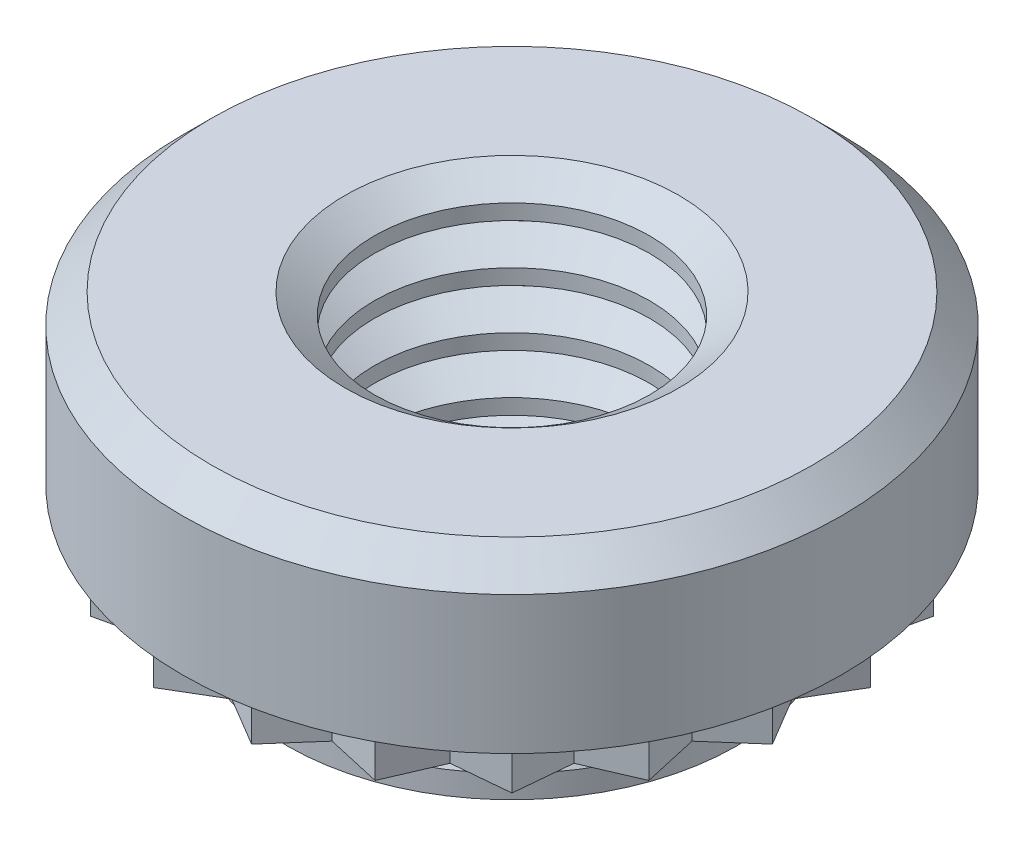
ISO-10303-21;
HEADER;
FILE_DESCRIPTION(('STEP AP214'),'2;1');
FILE_NAME('part.step','',(''),(''),'','','');
FILE_SCHEMA(('AUTOMOTIVE_DESIGN { 1 0 10303 214 1 1 1 1 }'));
ENDSEC;
DATA;
#1=APPLICATION_CONTEXT('core data for automotive mechanical design processes');
#2=APPLICATION_PROTOCOL_DEFINITION('international standard','automotive_design',2000,#1);
#3=PRODUCT_CONTEXT('',#1,'mechanical');
#4=PRODUCT('Part','Part','',(#3));
#5=PRODUCT_RELATED_PRODUCT_CATEGORY('part','',(#4));
#6=PRODUCT_DEFINITION_FORMATION('','',#4);
#7=PRODUCT_DEFINITION_CONTEXT('part definition',#1,'design');
#8=PRODUCT_DEFINITION('design','',#6,#7);
#9=PRODUCT_DEFINITION_SHAPE('','',#8);
#10=(LENGTH_UNIT() NAMED_UNIT(*) SI_UNIT(.MILLI.,.METRE.));
#11=(NAMED_UNIT(*) PLANE_ANGLE_UNIT() SI_UNIT($,.RADIAN.));
#12=(NAMED_UNIT(*) SI_UNIT($,.STERADIAN.) SOLID_ANGLE_UNIT());
#13=UNCERTAINTY_MEASURE_WITH_UNIT(LENGTH_MEASURE(1.E-05),#10,'distance_accuracy_value','');
#14=(GEOMETRIC_REPRESENTATION_CONTEXT(3) GLOBAL_UNCERTAINTY_ASSIGNED_CONTEXT((#13)) GLOBAL_UNIT_ASSIGNED_CONTEXT((#10,
#11,#12)) REPRESENTATION_CONTEXT('',''));
#15=CARTESIAN_POINT('',(0.,0.,0.));
#16=DIRECTION('',(0.,0.,1.));
#17=DIRECTION('',(1.,0.,0.));
#18=AXIS2_PLACEMENT_3D('',#15,#16,#17);
#19=CARTESIAN_POINT('',(2.37361205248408,0.,0.));
#20=DIRECTION('',(0.,-1.,0.));
#21=DIRECTION('',(0.,0.,-1.));
#22=AXIS2_PLACEMENT_3D('',#19,#20,#21);
#23=PLANE('',#22);
#24=CARTESIAN_POINT('',(0.,0.,0.));
#25=DIRECTION('',(0.,-1.,0.));
#26=DIRECTION('',(0.,0.,-1.));
#27=AXIS2_PLACEMENT_3D('',#24,#25,#26);
#28=CIRCLE('',#27,3.95);
#29=CARTESIAN_POINT('',(0.,0.,-3.95));
#30=VERTEX_POINT('',#29);
#31=EDGE_CURVE('E640',#30,#30,#28,.T.);
#32=ORIENTED_EDGE('',*,*,#31,.T.);
#33=EDGE_LOOP('',(#32));
#34=FACE_BOUND('',#33,.T.);
#35=DIRECTION('',(-0.859689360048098,0.,-0.510817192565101));
#36=VECTOR('',#35,1.);
#37=CARTESIAN_POINT('',(0.587020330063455,0.,3.70630049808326));
#38=LINE('',#37,#36);
#39=CARTESIAN_POINT('',(0.587020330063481,0.,3.70630049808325));
#40=VERTEX_POINT('',#39);
#41=CARTESIAN_POINT('',(0.,0.,3.3575));
#42=VERTEX_POINT('',#41);
#43=EDGE_CURVE('E567',#40,#42,#38,.T.);
#44=ORIENTED_EDGE('',*,*,#43,.F.);
#45=DIRECTION('',(-0.659761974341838,0.,0.751474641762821));
#46=VECTOR('',#45,1.);
#47=CARTESIAN_POINT('',(1.03752455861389,0.,3.19317225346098));
#48=LINE('',#47,#46);
#49=CARTESIAN_POINT('',(1.03752455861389,0.,3.19317225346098));
#50=VERTEX_POINT('',#49);
#51=EDGE_CURVE('E1165',#50,#40,#48,.T.);
#52=ORIENTED_EDGE('',*,*,#51,.F.);
#53=DIRECTION('',(-0.975464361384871,0.,-0.220157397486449));
#54=VECTOR('',#53,1.);
#55=CARTESIAN_POINT('',(1.70359935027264,0.,3.34350198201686));
#56=LINE('',#55,#54);
#57=CARTESIAN_POINT('',(1.70359935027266,0.,3.34350198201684));
#58=VERTEX_POINT('',#57);
#59=EDGE_CURVE('E1152',#58,#50,#56,.T.);
#60=ORIENTED_EDGE('',*,*,#59,.F.);
#61=DIRECTION('',(-0.395252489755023,0.,0.918572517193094));
#62=VECTOR('',#61,1.);
#63=CARTESIAN_POINT('',(1.97348898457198,0.,2.71627455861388));
#64=LINE('',#63,#62);
#65=CARTESIAN_POINT('',(1.97348898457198,0.,2.71627455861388));
#66=VERTEX_POINT('',#65);
#67=EDGE_CURVE('E1157',#66,#58,#64,.T.);
#68=ORIENTED_EDGE('',*,*,#67,.F.);
#69=DIRECTION('',(-0.995754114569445,0.,0.0920529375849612));
#70=VECTOR('',#69,1.);
#71=CARTESIAN_POINT('',(2.65341819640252,0.,2.65341819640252));
#72=LINE('',#71,#70);
#73=CARTESIAN_POINT('',(2.65341819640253,0.,2.65341819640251));
#74=VERTEX_POINT('',#73);
#75=EDGE_CURVE('E1162',#74,#66,#72,.T.);
#76=ORIENTED_EDGE('',*,*,#75,.F.);
#77=DIRECTION('',(-0.0920529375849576,0.,0.995754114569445));
#78=VECTOR('',#77,1.);
#79=CARTESIAN_POINT('',(2.71627455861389,0.,1.97348898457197));
#80=LINE('',#79,#78);
#81=CARTESIAN_POINT('',(2.71627455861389,0.,1.97348898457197));
#82=VERTEX_POINT('',#81);
#83=EDGE_CURVE('E1629',#82,#74,#80,.T.);
#84=ORIENTED_EDGE('',*,*,#83,.F.);
#85=DIRECTION('',(-0.918572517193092,0.,0.395252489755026));
#86=VECTOR('',#85,1.);
#87=CARTESIAN_POINT('',(3.34350198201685,0.,1.70359935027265));
#88=LINE('',#87,#86);
#89=CARTESIAN_POINT('',(3.34350198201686,0.,1.70359935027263));
#90=VERTEX_POINT('',#89);
#91=EDGE_CURVE('E1627',#90,#82,#88,.T.);
#92=ORIENTED_EDGE('',*,*,#91,.F.);
#93=DIRECTION('',(0.220157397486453,0.,0.97546436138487));
#94=VECTOR('',#93,1.);
#95=CARTESIAN_POINT('',(3.19317225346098,0.,1.03752455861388));
#96=LINE('',#95,#94);
#97=CARTESIAN_POINT('',(3.19317225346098,0.,1.03752455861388));
#98=VERTEX_POINT('',#97);
#99=EDGE_CURVE('E1600',#98,#90,#96,.T.);
#100=ORIENTED_EDGE('',*,*,#99,.F.);
#101=DIRECTION('',(-0.751474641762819,0.,0.659761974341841));
#102=VECTOR('',#101,1.);
#103=CARTESIAN_POINT('',(3.70630049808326,0.,0.587020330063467));
#104=LINE('',#103,#102);
#105=CARTESIAN_POINT('',(3.70630049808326,0.,0.587020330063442));
#106=VERTEX_POINT('',#105);
#107=EDGE_CURVE('E1598',#106,#98,#104,.T.);
#108=ORIENTED_EDGE('',*,*,#107,.F.);
#109=DIRECTION('',(0.510817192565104,0.,0.859689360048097));
#110=VECTOR('',#109,1.);
#111=CARTESIAN_POINT('',(3.3575,0.,0.));
#112=LINE('',#111,#110);
#113=CARTESIAN_POINT('',(3.3575,0.,0.));
#114=VERTEX_POINT('',#113);
#115=EDGE_CURVE('E1571',#114,#106,#112,.T.);
#116=ORIENTED_EDGE('',*,*,#115,.F.);
#117=DIRECTION('',(-0.510817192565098,0.,0.8596893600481));
#118=VECTOR('',#117,1.);
#119=CARTESIAN_POINT('',(3.70630049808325,0.,-0.587020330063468));
#120=LINE('',#119,#118);
#121=CARTESIAN_POINT('',(3.70630049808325,0.,-0.587020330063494));
#122=VERTEX_POINT('',#121);
#123=EDGE_CURVE('E1569',#122,#114,#120,.T.);
#124=ORIENTED_EDGE('',*,*,#123,.F.);
#125=DIRECTION('',(0.751474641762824,0.,0.659761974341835));
#126=VECTOR('',#125,1.);
#127=CARTESIAN_POINT('',(3.19317225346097,0.,-1.0375245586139));
#128=LINE('',#127,#126);
#129=CARTESIAN_POINT('',(3.19317225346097,0.,-1.0375245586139));
#130=VERTEX_POINT('',#129);
#131=EDGE_CURVE('E1542',#130,#122,#128,.T.);
#132=ORIENTED_EDGE('',*,*,#131,.F.);
#133=DIRECTION('',(-0.220157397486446,0.,0.975464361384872));
#134=VECTOR('',#133,1.);
#135=CARTESIAN_POINT('',(3.34350198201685,0.,-1.70359935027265));
#136=LINE('',#135,#134);
#137=CARTESIAN_POINT('',(3.34350198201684,0.,-1.70359935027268));
#138=VERTEX_POINT('',#137);
#139=EDGE_CURVE('E1540',#138,#130,#136,.T.);
#140=ORIENTED_EDGE('',*,*,#139,.F.);
#141=DIRECTION('',(0.918572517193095,0.,0.39525248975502));
#142=VECTOR('',#141,1.);
#143=CARTESIAN_POINT('',(2.71627455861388,0.,-1.97348898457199));
#144=LINE('',#143,#142);
#145=CARTESIAN_POINT('',(2.71627455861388,0.,-1.97348898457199));
#146=VERTEX_POINT('',#145);
#147=EDGE_CURVE('E1513',#146,#138,#144,.T.);
#148=ORIENTED_EDGE('',*,*,#147,.F.);
#149=DIRECTION('',(0.0920529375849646,0.,0.995754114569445));
#150=VECTOR('',#149,1.);
#151=CARTESIAN_POINT('',(2.65341819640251,0.,-2.65341819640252));
#152=LINE('',#151,#150);
#153=CARTESIAN_POINT('',(2.6534181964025,0.,-2.65341819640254));
#154=VERTEX_POINT('',#153);
#155=EDGE_CURVE('E1511',#154,#146,#152,.T.);
#156=ORIENTED_EDGE('',*,*,#155,.F.);
#157=DIRECTION('',(0.995754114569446,0.,0.0920529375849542));
#158=VECTOR('',#157,1.);
#159=CARTESIAN_POINT('',(1.97348898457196,0.,-2.7162745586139));
#160=LINE('',#159,#158);
#161=CARTESIAN_POINT('',(1.97348898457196,0.,-2.7162745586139));
#162=VERTEX_POINT('',#161);
#163=EDGE_CURVE('E1484',#162,#154,#160,.T.);
#164=ORIENTED_EDGE('',*,*,#163,.F.);
#165=DIRECTION('',(0.395252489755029,0.,0.918572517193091));
#166=VECTOR('',#165,1.);
#167=CARTESIAN_POINT('',(1.70359935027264,0.,-3.34350198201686));
#168=LINE('',#167,#166);
#169=CARTESIAN_POINT('',(1.70359935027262,0.,-3.34350198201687));
#170=VERTEX_POINT('',#169);
#171=EDGE_CURVE('E1482',#170,#162,#168,.T.);
#172=ORIENTED_EDGE('',*,*,#171,.F.);
#173=DIRECTION('',(0.975464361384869,0.,-0.220157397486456));
#174=VECTOR('',#173,1.);
#175=CARTESIAN_POINT('',(1.03752455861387,0.,-3.19317225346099));
#176=LINE('',#175,#174);
#177=CARTESIAN_POINT('',(1.03752455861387,0.,-3.19317225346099));
#178=VERTEX_POINT('',#177);
#179=EDGE_CURVE('E1455',#178,#170,#176,.T.);
#180=ORIENTED_EDGE('',*,*,#179,.F.);
#181=DIRECTION('',(0.659761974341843,0.,0.751474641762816));
#182=VECTOR('',#181,1.);
#183=CARTESIAN_POINT('',(0.587020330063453,0.,-3.70630049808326));
#184=LINE('',#183,#182);
#185=CARTESIAN_POINT('',(0.587020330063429,0.,-3.70630049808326));
#186=VERTEX_POINT('',#185);
#187=EDGE_CURVE('E1453',#186,#178,#184,.T.);
#188=ORIENTED_EDGE('',*,*,#187,.F.);
#189=DIRECTION('',(0.859689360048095,0.,-0.510817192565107));
#190=VECTOR('',#189,1.);
#191=CARTESIAN_POINT('',(0.,0.,-3.3575));
#192=LINE('',#191,#190);
#193=CARTESIAN_POINT('',(0.,0.,-3.3575));
#194=VERTEX_POINT('',#193);
#195=EDGE_CURVE('E1426',#194,#186,#192,.T.);
#196=ORIENTED_EDGE('',*,*,#195,.F.);
#197=DIRECTION('',(0.859689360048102,0.,0.510817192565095));
#198=VECTOR('',#197,1.);
#199=CARTESIAN_POINT('',(-0.587020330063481,0.,-3.70630049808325));
#200=LINE('',#199,#198);
#201=CARTESIAN_POINT('',(-0.587020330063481,0.,-3.70630049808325));
#202=VERTEX_POINT('',#201);
#203=EDGE_CURVE('E1424',#202,#194,#200,.T.);
#204=ORIENTED_EDGE('',*,*,#203,.F.);
#205=DIRECTION('',(0.659761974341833,0.,-0.751474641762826));
#206=VECTOR('',#205,1.);
#207=CARTESIAN_POINT('',(-1.03752455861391,0.,-3.19317225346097));
#208=LINE('',#207,#206);
#209=CARTESIAN_POINT('',(-1.03752455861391,0.,-3.19317225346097));
#210=VERTEX_POINT('',#209);
#211=EDGE_CURVE('E1397',#210,#202,#208,.T.);
#212=ORIENTED_EDGE('',*,*,#211,.F.);
#213=DIRECTION('',(0.975464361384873,0.,0.220157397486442));
#214=VECTOR('',#213,1.);
#215=CARTESIAN_POINT('',(-1.70359935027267,0.,-3.34350198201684));
#216=LINE('',#215,#214);
#217=CARTESIAN_POINT('',(-1.70359935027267,0.,-3.34350198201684));
#218=VERTEX_POINT('',#217);
#219=EDGE_CURVE('E1395',#218,#210,#216,.T.);
#220=ORIENTED_EDGE('',*,*,#219,.F.);
#221=DIRECTION('',(0.395252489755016,0.,-0.918572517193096));
#222=VECTOR('',#221,1.);
#223=CARTESIAN_POINT('',(-1.973488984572,0.,-2.71627455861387));
#224=LINE('',#223,#222);
#225=CARTESIAN_POINT('',(-1.973488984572,0.,-2.71627455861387));
#226=VERTEX_POINT('',#225);
#227=EDGE_CURVE('E1368',#226,#218,#224,.T.);
#228=ORIENTED_EDGE('',*,*,#227,.F.);
#229=DIRECTION('',(0.995754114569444,0.,-0.0920529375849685));
#230=VECTOR('',#229,1.);
#231=CARTESIAN_POINT('',(-2.65341819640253,0.,-2.6534181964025));
#232=LINE('',#231,#230);
#233=CARTESIAN_POINT('',(-2.65341819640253,0.,-2.6534181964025));
#234=VERTEX_POINT('',#233);
#235=EDGE_CURVE('E1366',#234,#226,#232,.T.);
#236=ORIENTED_EDGE('',*,*,#235,.F.);
#237=DIRECTION('',(0.0920529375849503,0.,-0.995754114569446));
#238=VECTOR('',#237,1.);
#239=CARTESIAN_POINT('',(-2.71627455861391,0.,-1.97348898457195));
#240=LINE('',#239,#238);
#241=CARTESIAN_POINT('',(-2.71627455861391,0.,-1.97348898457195));
#242=VERTEX_POINT('',#241);
#243=EDGE_CURVE('E1339',#242,#234,#240,.T.);
#244=ORIENTED_EDGE('',*,*,#243,.F.);
#245=DIRECTION('',(0.918572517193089,0.,-0.395252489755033));
#246=VECTOR('',#245,1.);
#247=CARTESIAN_POINT('',(-3.34350198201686,0.,-1.70359935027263));
#248=LINE('',#247,#246);
#249=CARTESIAN_POINT('',(-3.34350198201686,0.,-1.70359935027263));
#250=VERTEX_POINT('',#249);
#251=EDGE_CURVE('E1337',#250,#242,#248,.T.);
#252=ORIENTED_EDGE('',*,*,#251,.F.);
#253=DIRECTION('',(-0.220157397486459,0.,-0.975464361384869));
#254=VECTOR('',#253,1.);
#255=CARTESIAN_POINT('',(-3.19317225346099,0.,-1.03752455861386));
#256=LINE('',#255,#254);
#257=CARTESIAN_POINT('',(-3.19317225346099,0.,-1.03752455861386));
#258=VERTEX_POINT('',#257);
#259=EDGE_CURVE('E1310',#258,#250,#256,.T.);
#260=ORIENTED_EDGE('',*,*,#259,.F.);
#261=DIRECTION('',(0.751474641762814,0.,-0.659761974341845));
#262=VECTOR('',#261,1.);
#263=CARTESIAN_POINT('',(-3.70630049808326,0.,-0.587020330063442));
#264=LINE('',#263,#262);
#265=CARTESIAN_POINT('',(-3.70630049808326,0.,-0.587020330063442));
#266=VERTEX_POINT('',#265);
#267=EDGE_CURVE('E1308',#266,#258,#264,.T.);
#268=ORIENTED_EDGE('',*,*,#267,.F.);
#269=DIRECTION('',(-0.51081719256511,0.,-0.859689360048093));
#270=VECTOR('',#269,1.);
#271=CARTESIAN_POINT('',(-3.3575,0.,0.));
#272=LINE('',#271,#270);
#273=CARTESIAN_POINT('',(-3.3575,0.,0.));
#274=VERTEX_POINT('',#273);
#275=EDGE_CURVE('E1281',#274,#266,#272,.T.);
#276=ORIENTED_EDGE('',*,*,#275,.F.);
#277=DIRECTION('',(0.510817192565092,0.,-0.859689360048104));
#278=VECTOR('',#277,1.);
#279=CARTESIAN_POINT('',(-3.70630049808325,0.,0.587020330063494));
#280=LINE('',#279,#278);
#281=CARTESIAN_POINT('',(-3.70630049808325,0.,0.587020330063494));
#282=VERTEX_POINT('',#281);
#283=EDGE_CURVE('E1279',#282,#274,#280,.T.);
#284=ORIENTED_EDGE('',*,*,#283,.F.);
#285=DIRECTION('',(-0.751474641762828,0.,-0.65976197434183));
#286=VECTOR('',#285,1.);
#287=CARTESIAN_POINT('',(-3.19317225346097,0.,1.03752455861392));
#288=LINE('',#287,#286);
#289=CARTESIAN_POINT('',(-3.19317225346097,0.,1.03752455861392));
#290=VERTEX_POINT('',#289);
#291=EDGE_CURVE('E1252',#290,#282,#288,.T.);
#292=ORIENTED_EDGE('',*,*,#291,.F.);
#293=DIRECTION('',(0.220157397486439,0.,-0.975464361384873));
#294=VECTOR('',#293,1.);
#295=CARTESIAN_POINT('',(-3.34350198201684,0.,1.70359935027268));
#296=LINE('',#295,#294);
#297=CARTESIAN_POINT('',(-3.34350198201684,0.,1.70359935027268));
#298=VERTEX_POINT('',#297);
#299=EDGE_CURVE('E1250',#298,#290,#296,.T.);
#300=ORIENTED_EDGE('',*,*,#299,.F.);
#301=DIRECTION('',(-0.918572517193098,0.,-0.395252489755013));
#302=VECTOR('',#301,1.);
#303=CARTESIAN_POINT('',(-2.71627455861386,0.,1.97348898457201));
#304=LINE('',#303,#302);
#305=CARTESIAN_POINT('',(-2.71627455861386,0.,1.97348898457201));
#306=VERTEX_POINT('',#305);
#307=EDGE_CURVE('E1223',#306,#298,#304,.T.);
#308=ORIENTED_EDGE('',*,*,#307,.F.);
#309=DIRECTION('',(-0.092052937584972,0.,-0.995754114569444));
#310=VECTOR('',#309,1.);
#311=CARTESIAN_POINT('',(-2.6534181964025,0.,2.65341819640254));
#312=LINE('',#311,#310);
#313=CARTESIAN_POINT('',(-2.6534181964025,0.,2.65341819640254));
#314=VERTEX_POINT('',#313);
#315=EDGE_CURVE('E1221',#314,#306,#312,.T.);
#316=ORIENTED_EDGE('',*,*,#315,.F.);
#317=DIRECTION('',(-0.995754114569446,0.,-0.0920529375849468));
#318=VECTOR('',#317,1.);
#319=CARTESIAN_POINT('',(-1.97348898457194,0.,2.71627455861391));
#320=LINE('',#319,#318);
#321=CARTESIAN_POINT('',(-1.97348898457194,0.,2.71627455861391));
#322=VERTEX_POINT('',#321);
#323=EDGE_CURVE('E1195',#322,#314,#320,.T.);
#324=ORIENTED_EDGE('',*,*,#323,.F.);
#325=DIRECTION('',(-0.395252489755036,0.,-0.918572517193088));
#326=VECTOR('',#325,1.);
#327=CARTESIAN_POINT('',(-1.70359935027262,0.,3.34350198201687));
#328=LINE('',#327,#326);
#329=CARTESIAN_POINT('',(-1.70359935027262,0.,3.34350198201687));
#330=VERTEX_POINT('',#329);
#331=EDGE_CURVE('E1184',#330,#322,#328,.T.);
#332=ORIENTED_EDGE('',*,*,#331,.F.);
#333=DIRECTION('',(-0.975464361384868,0.,0.220157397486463));
#334=VECTOR('',#333,1.);
#335=CARTESIAN_POINT('',(-1.03752455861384,0.,3.19317225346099));
#336=LINE('',#335,#334);
#337=CARTESIAN_POINT('',(-1.03752455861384,0.,3.19317225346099));
#338=VERTEX_POINT('',#337);
#339=EDGE_CURVE('E561',#338,#330,#336,.T.);
#340=ORIENTED_EDGE('',*,*,#339,.F.);
#341=DIRECTION('',(-0.659761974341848,0.,-0.751474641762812));
#342=VECTOR('',#341,1.);
#343=CARTESIAN_POINT('',(-0.587020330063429,0.,3.70630049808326));
#344=LINE('',#343,#342);
#345=CARTESIAN_POINT('',(-0.587020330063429,0.,3.70630049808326));
#346=VERTEX_POINT('',#345);
#347=EDGE_CURVE('E544',#346,#338,#344,.T.);
#348=ORIENTED_EDGE('',*,*,#347,.F.);
#349=DIRECTION('',(-0.859689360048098,0.,0.510817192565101));
#350=VECTOR('',#349,1.);
#351=CARTESIAN_POINT('',(0.,0.,3.3575));
#352=LINE('',#351,#350);
#353=EDGE_CURVE('E558',#42,#346,#352,.T.);
#354=ORIENTED_EDGE('',*,*,#353,.F.);
#355=EDGE_LOOP('',(#44,#52,#60,#68,#76,#84,#92,#100,#108,#116,#124,#132,#140,#148,#156,#164,
#172,#180,#188,#196,#204,#212,#220,#228,#236,#244,#252,#260,#268,#276,#284,#292,#300,#308,#316,
#324,#332,#340,#348,#354));
#356=FACE_BOUND('',#355,.T.);
#357=ADVANCED_FACE('F40',(#34,#356),#23,.T.);
#358=CARTESIAN_POINT('',(0.,0.,0.));
#359=DIRECTION('',(0.,-1.,0.));
#360=DIRECTION('',(0.,0.,-1.));
#361=AXIS2_PLACEMENT_3D('',#358,#359,#360);
#362=CIRCLE('',#361,2.37361205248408);
#363=CARTESIAN_POINT('',(0.,0.,-2.37361205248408));
#364=VERTEX_POINT('',#363);
#365=EDGE_CURVE('E643',#364,#364,#362,.T.);
#366=ORIENTED_EDGE('',*,*,#365,.F.);
#367=EDGE_LOOP('',(#366));
#368=FACE_BOUND('',#367,.T.);
#369=DIRECTION('',(0.975464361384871,0.,0.220157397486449));
#370=VECTOR('',#369,1.);
#371=CARTESIAN_POINT('',(0.996023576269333,0.,3.06544536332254));
#372=LINE('',#371,#370);
#373=CARTESIAN_POINT('',(0.996023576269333,0.,3.06544536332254));
#374=VERTEX_POINT('',#373);
#375=CARTESIAN_POINT('',(1.63545537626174,0.,3.20976190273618));
#376=VERTEX_POINT('',#375);
#377=EDGE_CURVE('E1173',#374,#376,#372,.T.);
#378=ORIENTED_EDGE('',*,*,#377,.F.);
#379=DIRECTION('',(0.659761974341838,0.,-0.751474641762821));
#380=VECTOR('',#379,1.);
#381=CARTESIAN_POINT('',(0.563539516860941,0.,3.55804847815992));
#382=LINE('',#381,#380);
#383=CARTESIAN_POINT('',(0.563539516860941,0.,3.55804847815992));
#384=VERTEX_POINT('',#383);
#385=EDGE_CURVE('E1127',#384,#374,#382,.T.);
#386=ORIENTED_EDGE('',*,*,#385,.F.);
#387=DIRECTION('',(0.859689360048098,0.,0.510817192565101));
#388=VECTOR('',#387,1.);
#389=CARTESIAN_POINT('',(0.,0.,3.2232));
#390=LINE('',#389,#388);
#391=CARTESIAN_POINT('',(0.,0.,3.2232));
#392=VERTEX_POINT('',#391);
#393=EDGE_CURVE('E569',#392,#384,#390,.T.);
#394=ORIENTED_EDGE('',*,*,#393,.F.);
#395=DIRECTION('',(0.859689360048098,0.,-0.510817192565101));
#396=VECTOR('',#395,1.);
#397=CARTESIAN_POINT('',(-0.563539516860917,0.,3.55804847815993));
#398=LINE('',#397,#396);
#399=CARTESIAN_POINT('',(-0.563539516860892,0.,3.55804847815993));
#400=VERTEX_POINT('',#399);
#401=EDGE_CURVE('E566',#400,#392,#398,.T.);
#402=ORIENTED_EDGE('',*,*,#401,.F.);
#403=DIRECTION('',(0.659761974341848,0.,0.751474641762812));
#404=VECTOR('',#403,1.);
#405=CARTESIAN_POINT('',(-0.99602357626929,0.,3.06544536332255));
#406=LINE('',#405,#404);
#407=CARTESIAN_POINT('',(-0.99602357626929,0.,3.06544536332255));
#408=VERTEX_POINT('',#407);
#409=EDGE_CURVE('E1115',#408,#400,#406,.T.);
#410=ORIENTED_EDGE('',*,*,#409,.F.);
#411=DIRECTION('',(0.975464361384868,0.,-0.220157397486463));
#412=VECTOR('',#411,1.);
#413=CARTESIAN_POINT('',(-1.63545537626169,0.,3.2097619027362));
#414=LINE('',#413,#412);
#415=CARTESIAN_POINT('',(-1.63545537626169,0.,3.2097619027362));
#416=VERTEX_POINT('',#415);
#417=EDGE_CURVE('E1122',#416,#408,#414,.T.);
#418=ORIENTED_EDGE('',*,*,#417,.F.);
#419=DIRECTION('',(0.395252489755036,0.,0.918572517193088));
#420=VECTOR('',#419,1.);
#421=CARTESIAN_POINT('',(-1.89454942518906,0.,2.60762357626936));
#422=LINE('',#421,#420);
#423=CARTESIAN_POINT('',(-1.89454942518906,0.,2.60762357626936));
#424=VERTEX_POINT('',#423);
#425=EDGE_CURVE('E1200',#424,#416,#422,.T.);
#426=ORIENTED_EDGE('',*,*,#425,.F.);
#427=DIRECTION('',(0.995754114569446,0.,0.0920529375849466));
#428=VECTOR('',#427,1.);
#429=CARTESIAN_POINT('',(-2.54728146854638,0.,2.54728146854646));
#430=LINE('',#429,#428);
#431=CARTESIAN_POINT('',(-2.54728146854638,0.,2.54728146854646));
#432=VERTEX_POINT('',#431);
#433=EDGE_CURVE('E1198',#432,#424,#430,.T.);
#434=ORIENTED_EDGE('',*,*,#433,.F.);
#435=DIRECTION('',(0.0920529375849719,0.,0.995754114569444));
#436=VECTOR('',#435,1.);
#437=CARTESIAN_POINT('',(-2.60762357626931,0.,1.89454942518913));
#438=LINE('',#437,#436);
#439=CARTESIAN_POINT('',(-2.60762357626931,0.,1.89454942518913));
#440=VERTEX_POINT('',#439);
#441=EDGE_CURVE('E1228',#440,#432,#438,.T.);
#442=ORIENTED_EDGE('',*,*,#441,.F.);
#443=DIRECTION('',(0.918572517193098,0.,0.395252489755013));
#444=VECTOR('',#443,1.);
#445=CARTESIAN_POINT('',(-3.20976190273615,0.,1.63545537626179));
#446=LINE('',#445,#444);
#447=CARTESIAN_POINT('',(-3.20976190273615,0.,1.63545537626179));
#448=VERTEX_POINT('',#447);
#449=EDGE_CURVE('E1226',#448,#440,#446,.T.);
#450=ORIENTED_EDGE('',*,*,#449,.F.);
#451=DIRECTION('',(-0.220157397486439,0.,0.975464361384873));
#452=VECTOR('',#451,1.);
#453=CARTESIAN_POINT('',(-3.06544536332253,0.,0.996023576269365));
#454=LINE('',#453,#452);
#455=CARTESIAN_POINT('',(-3.06544536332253,0.,0.996023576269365));
#456=VERTEX_POINT('',#455);
#457=EDGE_CURVE('E1257',#456,#448,#454,.T.);
#458=ORIENTED_EDGE('',*,*,#457,.F.);
#459=DIRECTION('',(0.751474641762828,0.,0.65976197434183));
#460=VECTOR('',#459,1.);
#461=CARTESIAN_POINT('',(-3.55804847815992,0.,0.563539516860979));
#462=LINE('',#461,#460);
#463=CARTESIAN_POINT('',(-3.55804847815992,0.,0.563539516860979));
#464=VERTEX_POINT('',#463);
#465=EDGE_CURVE('E1255',#464,#456,#462,.T.);
#466=ORIENTED_EDGE('',*,*,#465,.F.);
#467=DIRECTION('',(-0.510817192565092,0.,0.859689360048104));
#468=VECTOR('',#467,1.);
#469=CARTESIAN_POINT('',(-3.2232,0.,0.));
#470=LINE('',#469,#468);
#471=CARTESIAN_POINT('',(-3.2232,0.,0.));
#472=VERTEX_POINT('',#471);
#473=EDGE_CURVE('E1286',#472,#464,#470,.T.);
#474=ORIENTED_EDGE('',*,*,#473,.F.);
#475=DIRECTION('',(0.51081719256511,0.,0.859689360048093));
#476=VECTOR('',#475,1.);
#477=CARTESIAN_POINT('',(-3.55804847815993,0.,-0.56353951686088));
#478=LINE('',#477,#476);
#479=CARTESIAN_POINT('',(-3.55804847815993,0.,-0.56353951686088));
#480=VERTEX_POINT('',#479);
#481=EDGE_CURVE('E1284',#480,#472,#478,.T.);
#482=ORIENTED_EDGE('',*,*,#481,.F.);
#483=DIRECTION('',(-0.751474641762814,0.,0.659761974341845));
#484=VECTOR('',#483,1.);
#485=CARTESIAN_POINT('',(-3.06544536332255,0.,-0.996023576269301));
#486=LINE('',#485,#484);
#487=CARTESIAN_POINT('',(-3.06544536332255,0.,-0.996023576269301));
#488=VERTEX_POINT('',#487);
#489=EDGE_CURVE('E1315',#488,#480,#486,.T.);
#490=ORIENTED_EDGE('',*,*,#489,.F.);
#491=DIRECTION('',(0.220157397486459,0.,0.975464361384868));
#492=VECTOR('',#491,1.);
#493=CARTESIAN_POINT('',(-3.2097619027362,0.,-1.6354553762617));
#494=LINE('',#493,#492);
#495=CARTESIAN_POINT('',(-3.2097619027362,0.,-1.6354553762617));
#496=VERTEX_POINT('',#495);
#497=EDGE_CURVE('E1313',#496,#488,#494,.T.);
#498=ORIENTED_EDGE('',*,*,#497,.F.);
#499=DIRECTION('',(-0.918572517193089,0.,0.395252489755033));
#500=VECTOR('',#499,1.);
#501=CARTESIAN_POINT('',(-2.60762357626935,0.,-1.89454942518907));
#502=LINE('',#501,#500);
#503=CARTESIAN_POINT('',(-2.60762357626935,0.,-1.89454942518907));
#504=VERTEX_POINT('',#503);
#505=EDGE_CURVE('E1344',#504,#496,#502,.T.);
#506=ORIENTED_EDGE('',*,*,#505,.F.);
#507=DIRECTION('',(-0.09205293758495,0.,0.995754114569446));
#508=VECTOR('',#507,1.);
#509=CARTESIAN_POINT('',(-2.54728146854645,0.,-2.54728146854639));
#510=LINE('',#509,#508);
#511=CARTESIAN_POINT('',(-2.54728146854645,0.,-2.54728146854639));
#512=VERTEX_POINT('',#511);
#513=EDGE_CURVE('E1342',#512,#504,#510,.T.);
#514=ORIENTED_EDGE('',*,*,#513,.F.);
#515=DIRECTION('',(-0.995754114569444,0.,0.0920529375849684));
#516=VECTOR('',#515,1.);
#517=CARTESIAN_POINT('',(-1.89454942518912,0.,-2.60762357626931));
#518=LINE('',#517,#516);
#519=CARTESIAN_POINT('',(-1.89454942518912,0.,-2.60762357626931));
#520=VERTEX_POINT('',#519);
#521=EDGE_CURVE('E1373',#520,#512,#518,.T.);
#522=ORIENTED_EDGE('',*,*,#521,.F.);
#523=DIRECTION('',(-0.395252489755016,0.,0.918572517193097));
#524=VECTOR('',#523,1.);
#525=CARTESIAN_POINT('',(-1.63545537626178,0.,-3.20976190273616));
#526=LINE('',#525,#524);
#527=CARTESIAN_POINT('',(-1.63545537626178,0.,-3.20976190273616));
#528=VERTEX_POINT('',#527);
#529=EDGE_CURVE('E1371',#528,#520,#526,.T.);
#530=ORIENTED_EDGE('',*,*,#529,.F.);
#531=DIRECTION('',(-0.975464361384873,0.,-0.220157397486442));
#532=VECTOR('',#531,1.);
#533=CARTESIAN_POINT('',(-0.996023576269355,0.,-3.06544536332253));
#534=LINE('',#533,#532);
#535=CARTESIAN_POINT('',(-0.996023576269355,0.,-3.06544536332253));
#536=VERTEX_POINT('',#535);
#537=EDGE_CURVE('E1402',#536,#528,#534,.T.);
#538=ORIENTED_EDGE('',*,*,#537,.F.);
#539=DIRECTION('',(-0.659761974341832,0.,0.751474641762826));
#540=VECTOR('',#539,1.);
#541=CARTESIAN_POINT('',(-0.563539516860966,0.,-3.55804847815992));
#542=LINE('',#541,#540);
#543=CARTESIAN_POINT('',(-0.563539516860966,0.,-3.55804847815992));
#544=VERTEX_POINT('',#543);
#545=EDGE_CURVE('E1400',#544,#536,#542,.T.);
#546=ORIENTED_EDGE('',*,*,#545,.F.);
#547=DIRECTION('',(-0.859689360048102,0.,-0.510817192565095));
#548=VECTOR('',#547,1.);
#549=CARTESIAN_POINT('',(0.,0.,-3.2232));
#550=LINE('',#549,#548);
#551=CARTESIAN_POINT('',(0.,0.,-3.2232));
#552=VERTEX_POINT('',#551);
#553=EDGE_CURVE('E1431',#552,#544,#550,.T.);
#554=ORIENTED_EDGE('',*,*,#553,.F.);
#555=DIRECTION('',(-0.859689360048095,0.,0.510817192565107));
#556=VECTOR('',#555,1.);
#557=CARTESIAN_POINT('',(0.563539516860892,0.,-3.55804847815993));
#558=LINE('',#557,#556);
#559=CARTESIAN_POINT('',(0.563539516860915,0.,-3.55804847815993));
#560=VERTEX_POINT('',#559);
#561=EDGE_CURVE('E1429',#560,#552,#558,.T.);
#562=ORIENTED_EDGE('',*,*,#561,.F.);
#563=DIRECTION('',(-0.659761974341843,0.,-0.751474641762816));
#564=VECTOR('',#563,1.);
#565=CARTESIAN_POINT('',(0.99602357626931,0.,-3.06544536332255));
#566=LINE('',#565,#564);
#567=CARTESIAN_POINT('',(0.99602357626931,0.,-3.06544536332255));
#568=VERTEX_POINT('',#567);
#569=EDGE_CURVE('E1460',#568,#560,#566,.T.);
#570=ORIENTED_EDGE('',*,*,#569,.F.);
#571=DIRECTION('',(-0.975464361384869,0.,0.220157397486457));
#572=VECTOR('',#571,1.);
#573=CARTESIAN_POINT('',(1.63545537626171,0.,-3.20976190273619));
#574=LINE('',#573,#572);
#575=CARTESIAN_POINT('',(1.63545537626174,0.,-3.20976190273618));
#576=VERTEX_POINT('',#575);
#577=EDGE_CURVE('E1458',#576,#568,#574,.T.);
#578=ORIENTED_EDGE('',*,*,#577,.F.);
#579=DIRECTION('',(-0.395252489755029,0.,-0.918572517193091));
#580=VECTOR('',#579,1.);
#581=CARTESIAN_POINT('',(1.89454942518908,0.,-2.60762357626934));
#582=LINE('',#581,#580);
#583=CARTESIAN_POINT('',(1.89454942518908,0.,-2.60762357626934));
#584=VERTEX_POINT('',#583);
#585=EDGE_CURVE('E1489',#584,#576,#582,.T.);
#586=ORIENTED_EDGE('',*,*,#585,.F.);
#587=DIRECTION('',(-0.995754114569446,0.,-0.092052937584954));
#588=VECTOR('',#587,1.);
#589=CARTESIAN_POINT('',(2.5472814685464,0.,-2.54728146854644));
#590=LINE('',#589,#588);
#591=CARTESIAN_POINT('',(2.54728146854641,0.,-2.54728146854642));
#592=VERTEX_POINT('',#591);
#593=EDGE_CURVE('E1487',#592,#584,#590,.T.);
#594=ORIENTED_EDGE('',*,*,#593,.F.);
#595=DIRECTION('',(-0.0920529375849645,0.,-0.995754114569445));
#596=VECTOR('',#595,1.);
#597=CARTESIAN_POINT('',(2.60762357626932,0.,-1.89454942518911));
#598=LINE('',#597,#596);
#599=CARTESIAN_POINT('',(2.60762357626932,0.,-1.89454942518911));
#600=VERTEX_POINT('',#599);
#601=EDGE_CURVE('E1518',#600,#592,#598,.T.);
#602=ORIENTED_EDGE('',*,*,#601,.F.);
#603=DIRECTION('',(-0.918572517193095,0.,-0.395252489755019));
#604=VECTOR('',#603,1.);
#605=CARTESIAN_POINT('',(3.20976190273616,0.,-1.63545537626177));
#606=LINE('',#605,#604);
#607=CARTESIAN_POINT('',(3.20976190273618,0.,-1.63545537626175));
#608=VERTEX_POINT('',#607);
#609=EDGE_CURVE('E1516',#608,#600,#606,.T.);
#610=ORIENTED_EDGE('',*,*,#609,.F.);
#611=DIRECTION('',(0.220157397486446,0.,-0.975464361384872));
#612=VECTOR('',#611,1.);
#613=CARTESIAN_POINT('',(3.06544536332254,0.,-0.996023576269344));
#614=LINE('',#613,#612);
#615=CARTESIAN_POINT('',(3.06544536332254,0.,-0.996023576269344));
#616=VERTEX_POINT('',#615);
#617=EDGE_CURVE('E1547',#616,#608,#614,.T.);
#618=ORIENTED_EDGE('',*,*,#617,.F.);
#619=DIRECTION('',(-0.751474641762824,0.,-0.659761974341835));
#620=VECTOR('',#619,1.);
#621=CARTESIAN_POINT('',(3.55804847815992,0.,-0.563539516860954));
#622=LINE('',#621,#620);
#623=CARTESIAN_POINT('',(3.55804847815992,0.,-0.56353951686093));
#624=VERTEX_POINT('',#623);
#625=EDGE_CURVE('E1545',#624,#616,#622,.T.);
#626=ORIENTED_EDGE('',*,*,#625,.F.);
#627=DIRECTION('',(0.510817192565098,0.,-0.8596893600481));
#628=VECTOR('',#627,1.);
#629=CARTESIAN_POINT('',(3.2232,0.,0.));
#630=LINE('',#629,#628);
#631=CARTESIAN_POINT('',(3.2232,0.,0.));
#632=VERTEX_POINT('',#631);
#633=EDGE_CURVE('E1576',#632,#624,#630,.T.);
#634=ORIENTED_EDGE('',*,*,#633,.F.);
#635=DIRECTION('',(-0.510817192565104,0.,-0.859689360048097));
#636=VECTOR('',#635,1.);
#637=CARTESIAN_POINT('',(3.55804847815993,0.,0.563539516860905));
#638=LINE('',#637,#636);
#639=CARTESIAN_POINT('',(3.55804847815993,0.,0.563539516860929));
#640=VERTEX_POINT('',#639);
#641=EDGE_CURVE('E1574',#640,#632,#638,.T.);
#642=ORIENTED_EDGE('',*,*,#641,.F.);
#643=DIRECTION('',(0.751474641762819,0.,-0.65976197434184));
#644=VECTOR('',#643,1.);
#645=CARTESIAN_POINT('',(3.06544536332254,0.,0.996023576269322));
#646=LINE('',#645,#644);
#647=CARTESIAN_POINT('',(3.06544536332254,0.,0.996023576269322));
#648=VERTEX_POINT('',#647);
#649=EDGE_CURVE('E1605',#648,#640,#646,.T.);
#650=ORIENTED_EDGE('',*,*,#649,.F.);
#651=DIRECTION('',(-0.220157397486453,0.,-0.97546436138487));
#652=VECTOR('',#651,1.);
#653=CARTESIAN_POINT('',(3.20976190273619,0.,1.63545537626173));
#654=LINE('',#653,#652);
#655=CARTESIAN_POINT('',(3.20976190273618,0.,1.63545537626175));
#656=VERTEX_POINT('',#655);
#657=EDGE_CURVE('E1603',#656,#648,#654,.T.);
#658=ORIENTED_EDGE('',*,*,#657,.F.);
#659=DIRECTION('',(0.918572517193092,0.,-0.395252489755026));
#660=VECTOR('',#659,1.);
#661=CARTESIAN_POINT('',(2.60762357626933,0.,1.89454942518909));
#662=LINE('',#661,#660);
#663=CARTESIAN_POINT('',(2.60762357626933,0.,1.89454942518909));
#664=VERTEX_POINT('',#663);
#665=EDGE_CURVE('E1634',#664,#656,#662,.T.);
#666=ORIENTED_EDGE('',*,*,#665,.F.);
#667=DIRECTION('',(0.0920529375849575,0.,-0.995754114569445));
#668=VECTOR('',#667,1.);
#669=CARTESIAN_POINT('',(2.54728146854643,0.,2.54728146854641));
#670=LINE('',#669,#668);
#671=CARTESIAN_POINT('',(2.54728146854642,0.,2.54728146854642));
#672=VERTEX_POINT('',#671);
#673=EDGE_CURVE('E1632',#672,#664,#670,.T.);
#674=ORIENTED_EDGE('',*,*,#673,.F.);
#675=DIRECTION('',(0.995754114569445,0.,-0.092052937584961));
#676=VECTOR('',#675,1.);
#677=CARTESIAN_POINT('',(1.8945494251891,0.,2.60762357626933));
#678=LINE('',#677,#676);
#679=CARTESIAN_POINT('',(1.8945494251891,0.,2.60762357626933));
#680=VERTEX_POINT('',#679);
#681=EDGE_CURVE('E1658',#680,#672,#678,.T.);
#682=ORIENTED_EDGE('',*,*,#681,.F.);
#683=DIRECTION('',(0.395252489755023,0.,-0.918572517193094));
#684=VECTOR('',#683,1.);
#685=CARTESIAN_POINT('',(1.63545537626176,0.,3.20976190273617));
#686=LINE('',#685,#684);
#687=EDGE_CURVE('E1161',#376,#680,#686,.T.);
#688=ORIENTED_EDGE('',*,*,#687,.F.);
#689=EDGE_LOOP('',(#378,#386,#394,#402,#410,#418,#426,#434,#442,#450,#458,#466,#474,#482,#490,
#498,#506,#514,#522,#530,#538,#546,#554,#562,#570,#578,#586,#594,#602,#610,#618,#626,#634,#642,
#650,#658,#666,#674,#682,#688));
#690=FACE_BOUND('',#689,.T.);
#691=ADVANCED_FACE('F679',(#368,#690),#23,.T.);
#692=CARTESIAN_POINT('',(0.,0.,0.));
#693=DIRECTION('',(0.,-1.,0.));
#694=DIRECTION('',(0.,0.,-1.));
#695=AXIS2_PLACEMENT_3D('',#692,#693,#694);
#696=CYLINDRICAL_SURFACE('',#695,1.65);
#697=CARTESIAN_POINT('',(0.,1.0814353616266,0.));
#698=DIRECTION('',(0.,-1.,0.));
#699=DIRECTION('',(0.,0.,-1.));
#700=AXIS2_PLACEMENT_3D('',#697,#698,#699);
#701=CIRCLE('',#700,1.65);
#702=CARTESIAN_POINT('',(0.,1.0814353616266,-1.65));
#703=VERTEX_POINT('',#702);
#704=EDGE_CURVE('E604',#703,#703,#701,.T.);
#705=ORIENTED_EDGE('',*,*,#704,.F.);
#706=EDGE_LOOP('',(#705));
#707=FACE_BOUND('',#706,.T.);
#708=CARTESIAN_POINT('',(0.,0.898088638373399,0.));
#709=DIRECTION('',(0.,-1.,0.));
#710=DIRECTION('',(0.,0.,-1.));
#711=AXIS2_PLACEMENT_3D('',#708,#709,#710);
#712=CIRCLE('',#711,1.65);
#713=CARTESIAN_POINT('',(0.,0.898088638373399,-1.65));
#714=VERTEX_POINT('',#713);
#715=EDGE_CURVE('E610',#714,#714,#712,.T.);
#716=ORIENTED_EDGE('',*,*,#715,.T.);
#717=EDGE_LOOP('',(#716));
#718=FACE_BOUND('',#717,.T.);
#719=ADVANCED_FACE('F684',(#707,#718),#696,.F.);
#720=CARTESIAN_POINT('',(0.,0.4079433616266,0.));
#721=DIRECTION('',(0.,-1.,0.));
#722=DIRECTION('',(0.,0.,-1.));
#723=AXIS2_PLACEMENT_3D('',#720,#721,#722);
#724=CIRCLE('',#723,1.65);
#725=CARTESIAN_POINT('',(0.,0.4079433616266,-1.65));
#726=VERTEX_POINT('',#725);
#727=EDGE_CURVE('E613',#726,#726,#724,.T.);
#728=ORIENTED_EDGE('',*,*,#727,.F.);
#729=EDGE_LOOP('',(#728));
#730=FACE_BOUND('',#729,.T.);
#731=CARTESIAN_POINT('',(0.,0.224596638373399,0.));
#732=DIRECTION('',(0.,-1.,0.));
#733=DIRECTION('',(0.,0.,-1.));
#734=AXIS2_PLACEMENT_3D('',#731,#732,#733);
#735=CIRCLE('',#734,1.65);
#736=CARTESIAN_POINT('',(0.,0.224596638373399,-1.65));
#737=VERTEX_POINT('',#736);
#738=EDGE_CURVE('E619',#737,#737,#735,.T.);
#739=ORIENTED_EDGE('',*,*,#738,.T.);
#740=EDGE_LOOP('',(#739));
#741=FACE_BOUND('',#740,.T.);
#742=ADVANCED_FACE('F735',(#730,#741),#696,.F.);
#743=CARTESIAN_POINT('',(0.,-0.2655486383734,0.));
#744=DIRECTION('',(0.,-1.,0.));
#745=DIRECTION('',(0.,0.,-1.));
#746=AXIS2_PLACEMENT_3D('',#743,#744,#745);
#747=CIRCLE('',#746,1.65);
#748=CARTESIAN_POINT('',(0.,-0.2655486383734,-1.65));
#749=VERTEX_POINT('',#748);
#750=EDGE_CURVE('E622',#749,#749,#747,.T.);
#751=ORIENTED_EDGE('',*,*,#750,.F.);
#752=EDGE_LOOP('',(#751));
#753=FACE_BOUND('',#752,.T.);
#754=CARTESIAN_POINT('',(0.,-0.448895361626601,0.));
#755=DIRECTION('',(0.,-1.,0.));
#756=DIRECTION('',(0.,0.,-1.));
#757=AXIS2_PLACEMENT_3D('',#754,#755,#756);
#758=CIRCLE('',#757,1.65);
#759=CARTESIAN_POINT('',(0.,-0.448895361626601,-1.65));
#760=VERTEX_POINT('',#759);
#761=EDGE_CURVE('E628',#760,#760,#758,.T.);
#762=ORIENTED_EDGE('',*,*,#761,.T.);
#763=EDGE_LOOP('',(#762));
#764=FACE_BOUND('',#763,.T.);
#765=ADVANCED_FACE('F752',(#753,#764),#696,.F.);
#766=CARTESIAN_POINT('',(0.,-0.9390406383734,0.));
#767=DIRECTION('',(0.,-1.,0.));
#768=DIRECTION('',(0.,0.,-1.));
#769=AXIS2_PLACEMENT_3D('',#766,#767,#768);
#770=CIRCLE('',#769,1.65);
#771=CARTESIAN_POINT('',(0.,-0.9390406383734,-1.65));
#772=VERTEX_POINT('',#771);
#773=EDGE_CURVE('E631',#772,#772,#770,.T.);
#774=ORIENTED_EDGE('',*,*,#773,.F.);
#775=EDGE_LOOP('',(#774));
#776=FACE_BOUND('',#775,.T.);
#777=CARTESIAN_POINT('',(0.,-1.1223873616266,0.));
#778=DIRECTION('',(0.,-1.,0.));
#779=DIRECTION('',(0.,0.,-1.));
#780=AXIS2_PLACEMENT_3D('',#777,#778,#779);
#781=CIRCLE('',#780,1.65);
#782=CARTESIAN_POINT('',(0.,-1.1223873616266,-1.65));
#783=VERTEX_POINT('',#782);
#784=EDGE_CURVE('E637',#783,#783,#781,.T.);
#785=ORIENTED_EDGE('',*,*,#784,.T.);
#786=EDGE_LOOP('',(#785));
#787=FACE_BOUND('',#786,.T.);
#788=ADVANCED_FACE('F702',(#776,#787),#696,.F.);
#789=CARTESIAN_POINT('',(0.,0.,0.));
#790=DIRECTION('',(0.,-1.,0.));
#791=DIRECTION('',(0.,0.,-1.));
#792=AXIS2_PLACEMENT_3D('',#789,#790,#791);
#793=CYLINDRICAL_SURFACE('',#792,3.95);
#794=CARTESIAN_POINT('',(0.,1.65,0.));
#795=DIRECTION('',(0.,1.,0.));
#796=DIRECTION('',(0.,0.,1.));
#797=AXIS2_PLACEMENT_3D('',#794,#795,#796);
#798=CIRCLE('',#797,3.95);
#799=CARTESIAN_POINT('',(0.,1.65,-3.95));
#800=VERTEX_POINT('',#799);
#801=EDGE_CURVE('E49',#800,#800,#798,.F.);
#802=ORIENTED_EDGE('',*,*,#801,.T.);
#803=EDGE_LOOP('',(#802));
#804=FACE_BOUND('',#803,.T.);
#805=ORIENTED_EDGE('',*,*,#31,.F.);
#806=EDGE_LOOP('',(#805));
#807=FACE_BOUND('',#806,.T.);
#808=ADVANCED_FACE('F42',(#804,#807),#793,.T.);
#809=CARTESIAN_POINT('',(3.95,2.,0.));
#810=DIRECTION('',(0.,1.,0.));
#811=DIRECTION('',(0.,0.,1.));
#812=AXIS2_PLACEMENT_3D('',#809,#810,#811);
#813=PLANE('',#812);
#814=CARTESIAN_POINT('',(0.,2.,0.));
#815=DIRECTION('',(0.,-1.,0.));
#816=DIRECTION('',(0.,0.,-1.));
#817=AXIS2_PLACEMENT_3D('',#814,#815,#816);
#818=CIRCLE('',#817,2.);
#819=CARTESIAN_POINT('',(0.,2.,-2.));
#820=VERTEX_POINT('',#819);
#821=EDGE_CURVE('E592',#820,#820,#818,.T.);
#822=ORIENTED_EDGE('',*,*,#821,.T.);
#823=EDGE_LOOP('',(#822));
#824=FACE_BOUND('',#823,.T.);
#825=CARTESIAN_POINT('',(0.,2.,0.));
#826=DIRECTION('',(0.,1.,0.));
#827=DIRECTION('',(0.,0.,1.));
#828=AXIS2_PLACEMENT_3D('',#825,#826,#827);
#829=CIRCLE('',#828,3.6);
#830=CARTESIAN_POINT('',(0.,2.,-3.6));
#831=VERTEX_POINT('',#830);
#832=EDGE_CURVE('E11',#831,#831,#829,.T.);
#833=ORIENTED_EDGE('',*,*,#832,.T.);
#834=EDGE_LOOP('',(#833));
#835=FACE_BOUND('',#834,.T.);
#836=ADVANCED_FACE('F700',(#824,#835),#813,.T.);
#837=CARTESIAN_POINT('',(0.,1.7549273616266,0.));
#838=DIRECTION('',(0.,-1.,0.));
#839=DIRECTION('',(0.,0.,-1.));
#840=AXIS2_PLACEMENT_3D('',#837,#838,#839);
#841=CIRCLE('',#840,1.65);
#842=CARTESIAN_POINT('',(0.,1.7549273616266,-1.65));
#843=VERTEX_POINT('',#842);
#844=EDGE_CURVE('E595',#843,#843,#841,.T.);
#845=ORIENTED_EDGE('',*,*,#844,.F.);
#846=EDGE_LOOP('',(#845));
#847=FACE_BOUND('',#846,.T.);
#848=CARTESIAN_POINT('',(0.,1.5715806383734,0.));
#849=DIRECTION('',(0.,-1.,0.));
#850=DIRECTION('',(0.,0.,-1.));
#851=AXIS2_PLACEMENT_3D('',#848,#849,#850);
#852=CIRCLE('',#851,1.65);
#853=CARTESIAN_POINT('',(0.,1.5715806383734,-1.65));
#854=VERTEX_POINT('',#853);
#855=EDGE_CURVE('E601',#854,#854,#852,.T.);
#856=ORIENTED_EDGE('',*,*,#855,.T.);
#857=EDGE_LOOP('',(#856));
#858=FACE_BOUND('',#857,.T.);
#859=ADVANCED_FACE('F697',(#847,#858),#696,.F.);
#860=CARTESIAN_POINT('',(1.65,-1.37,0.));
#861=DIRECTION('',(0.,-1.,0.));
#862=DIRECTION('',(0.,0.,-1.));
#863=AXIS2_PLACEMENT_3D('',#860,#861,#862);
#864=PLANE('',#863);
#865=CARTESIAN_POINT('',(0.,-1.37,0.));
#866=DIRECTION('',(0.,-1.,0.));
#867=DIRECTION('',(0.,0.,-1.));
#868=AXIS2_PLACEMENT_3D('',#865,#866,#867);
#869=CIRCLE('',#868,2.);
#870=CARTESIAN_POINT('',(0.,-1.37,-2.));
#871=VERTEX_POINT('',#870);
#872=EDGE_CURVE('E44',#871,#871,#869,.T.);
#873=ORIENTED_EDGE('',*,*,#872,.F.);
#874=EDGE_LOOP('',(#873));
#875=FACE_BOUND('',#874,.T.);
#876=CARTESIAN_POINT('',(0.,-1.37,0.));
#877=DIRECTION('',(0.,-1.,0.));
#878=DIRECTION('',(0.,0.,-1.));
#879=AXIS2_PLACEMENT_3D('',#876,#877,#878);
#880=CIRCLE('',#879,2.69);
#881=CARTESIAN_POINT('',(0.,-1.37,-2.69));
#882=VERTEX_POINT('',#881);
#883=EDGE_CURVE('E652',#882,#882,#880,.T.);
#884=ORIENTED_EDGE('',*,*,#883,.T.);
#885=EDGE_LOOP('',(#884));
#886=FACE_BOUND('',#885,.T.);
#887=ADVANCED_FACE('F693',(#875,#886),#864,.T.);
#888=CARTESIAN_POINT('',(0.,0.,0.));
#889=DIRECTION('',(0.,-1.,0.));
#890=DIRECTION('',(0.,0.,-1.));
#891=AXIS2_PLACEMENT_3D('',#888,#889,#890);
#892=CYLINDRICAL_SURFACE('',#891,2.69);
#893=CARTESIAN_POINT('',(0.,-1.096,0.));
#894=DIRECTION('',(0.,-1.,0.));
#895=DIRECTION('',(0.,0.,-1.));
#896=AXIS2_PLACEMENT_3D('',#893,#894,#895);
#897=CIRCLE('',#896,2.69);
#898=CARTESIAN_POINT('',(0.,-1.096,-2.69));
#899=VERTEX_POINT('',#898);
#900=EDGE_CURVE('E649',#899,#899,#897,.T.);
#901=ORIENTED_EDGE('',*,*,#900,.T.);
#902=EDGE_LOOP('',(#901));
#903=FACE_BOUND('',#902,.T.);
#904=ORIENTED_EDGE('',*,*,#883,.F.);
#905=EDGE_LOOP('',(#904));
#906=FACE_BOUND('',#905,.T.);
#907=ADVANCED_FACE('F689',(#903,#906),#892,.T.);
#908=CARTESIAN_POINT('',(0.,-1.096,0.));
#909=DIRECTION('',(0.,-1.,0.));
#910=DIRECTION('',(0.,0.,-1.));
#911=AXIS2_PLACEMENT_3D('',#908,#909,#910);
#912=CONICAL_SURFACE('',#911,2.69,0.523598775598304);
#913=CARTESIAN_POINT('',(0.,-0.548,0.));
#914=DIRECTION('',(0.,-1.,0.));
#915=DIRECTION('',(0.,0.,-1.));
#916=AXIS2_PLACEMENT_3D('',#913,#914,#915);
#917=CIRCLE('',#916,2.37361205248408);
#918=CARTESIAN_POINT('',(0.,-0.548,-2.37361205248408));
#919=VERTEX_POINT('',#918);
#920=EDGE_CURVE('E646',#919,#919,#917,.T.);
#921=ORIENTED_EDGE('',*,*,#920,.T.);
#922=EDGE_LOOP('',(#921));
#923=FACE_BOUND('',#922,.T.);
#924=ORIENTED_EDGE('',*,*,#900,.F.);
#925=EDGE_LOOP('',(#924));
#926=FACE_BOUND('',#925,.T.);
#927=ADVANCED_FACE('F673',(#923,#926),#912,.T.);
#928=CARTESIAN_POINT('',(0.,0.,0.));
#929=DIRECTION('',(0.,-1.,0.));
#930=DIRECTION('',(0.,0.,-1.));
#931=AXIS2_PLACEMENT_3D('',#928,#929,#930);
#932=CYLINDRICAL_SURFACE('',#931,2.37361205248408);
#933=ORIENTED_EDGE('',*,*,#365,.T.);
#934=EDGE_LOOP('',(#933));
#935=FACE_BOUND('',#934,.T.);
#936=ORIENTED_EDGE('',*,*,#920,.F.);
#937=EDGE_LOOP('',(#936));
#938=FACE_BOUND('',#937,.T.);
#939=ADVANCED_FACE('F663',(#935,#938),#932,.T.);
#940=CARTESIAN_POINT('',(0.,1.65,0.));
#941=DIRECTION('',(0.,-1.,0.));
#942=DIRECTION('',(0.,0.,-1.));
#943=AXIS2_PLACEMENT_3D('',#940,#941,#942);
#944=CONICAL_SURFACE('',#943,3.95,0.785398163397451);
#945=CARTESIAN_POINT('',(0.,2.,-3.6));
#946=CARTESIAN_POINT('',(0.,1.99635416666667,-3.60364583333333));
#947=CARTESIAN_POINT('',(0.,1.99270833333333,-3.60729166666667));
#948=CARTESIAN_POINT('',(0.,1.98541666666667,-3.61458333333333));
#949=CARTESIAN_POINT('',(0.,1.98177083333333,-3.61822916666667));
#950=CARTESIAN_POINT('',(0.,1.97447916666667,-3.62552083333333));
#951=CARTESIAN_POINT('',(0.,1.97083333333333,-3.62916666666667));
#952=CARTESIAN_POINT('',(0.,1.96354166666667,-3.63645833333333));
#953=CARTESIAN_POINT('',(0.,1.95989583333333,-3.64010416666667));
#954=CARTESIAN_POINT('',(0.,1.95260416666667,-3.64739583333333));
#955=CARTESIAN_POINT('',(0.,1.94895833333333,-3.65104166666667));
#956=CARTESIAN_POINT('',(0.,1.94166666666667,-3.65833333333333));
#957=CARTESIAN_POINT('',(0.,1.93802083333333,-3.66197916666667));
#958=CARTESIAN_POINT('',(0.,1.93072916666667,-3.66927083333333));
#959=CARTESIAN_POINT('',(0.,1.92708333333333,-3.67291666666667));
#960=CARTESIAN_POINT('',(0.,1.91979166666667,-3.68020833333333));
#961=CARTESIAN_POINT('',(0.,1.91614583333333,-3.68385416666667));
#962=CARTESIAN_POINT('',(0.,1.90885416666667,-3.69114583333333));
#963=CARTESIAN_POINT('',(0.,1.90520833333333,-3.69479166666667));
#964=CARTESIAN_POINT('',(0.,1.89791666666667,-3.70208333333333));
#965=CARTESIAN_POINT('',(0.,1.89427083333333,-3.70572916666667));
#966=CARTESIAN_POINT('',(0.,1.88697916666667,-3.71302083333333));
#967=CARTESIAN_POINT('',(0.,1.88333333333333,-3.71666666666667));
#968=CARTESIAN_POINT('',(0.,1.87604166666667,-3.72395833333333));
#969=CARTESIAN_POINT('',(0.,1.87239583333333,-3.72760416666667));
#970=CARTESIAN_POINT('',(0.,1.86510416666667,-3.73489583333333));
#971=CARTESIAN_POINT('',(0.,1.86145833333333,-3.73854166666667));
#972=CARTESIAN_POINT('',(0.,1.85416666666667,-3.74583333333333));
#973=CARTESIAN_POINT('',(0.,1.85052083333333,-3.74947916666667));
#974=CARTESIAN_POINT('',(0.,1.84322916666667,-3.75677083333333));
#975=CARTESIAN_POINT('',(0.,1.83958333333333,-3.76041666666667));
#976=CARTESIAN_POINT('',(0.,1.83229166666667,-3.76770833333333));
#977=CARTESIAN_POINT('',(0.,1.82864583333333,-3.77135416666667));
#978=CARTESIAN_POINT('',(0.,1.82135416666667,-3.77864583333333));
#979=CARTESIAN_POINT('',(0.,1.81770833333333,-3.78229166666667));
#980=CARTESIAN_POINT('',(0.,1.81041666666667,-3.78958333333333));
#981=CARTESIAN_POINT('',(0.,1.80677083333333,-3.79322916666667));
#982=CARTESIAN_POINT('',(0.,1.79947916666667,-3.80052083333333));
#983=CARTESIAN_POINT('',(0.,1.79583333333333,-3.80416666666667));
#984=CARTESIAN_POINT('',(0.,1.78854166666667,-3.81145833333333));
#985=CARTESIAN_POINT('',(0.,1.78489583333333,-3.81510416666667));
#986=CARTESIAN_POINT('',(0.,1.77760416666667,-3.82239583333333));
#987=CARTESIAN_POINT('',(0.,1.77395833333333,-3.82604166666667));
#988=CARTESIAN_POINT('',(0.,1.76666666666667,-3.83333333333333));
#989=CARTESIAN_POINT('',(0.,1.76302083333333,-3.83697916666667));
#990=CARTESIAN_POINT('',(0.,1.75572916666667,-3.84427083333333));
#991=CARTESIAN_POINT('',(0.,1.75208333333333,-3.84791666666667));
#992=CARTESIAN_POINT('',(0.,1.74479166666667,-3.85520833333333));
#993=CARTESIAN_POINT('',(0.,1.74114583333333,-3.85885416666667));
#994=CARTESIAN_POINT('',(0.,1.73385416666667,-3.86614583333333));
#995=CARTESIAN_POINT('',(0.,1.73020833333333,-3.86979166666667));
#996=CARTESIAN_POINT('',(0.,1.72291666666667,-3.87708333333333));
#997=CARTESIAN_POINT('',(0.,1.71927083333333,-3.88072916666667));
#998=CARTESIAN_POINT('',(0.,1.71197916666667,-3.88802083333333));
#999=CARTESIAN_POINT('',(0.,1.70833333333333,-3.89166666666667));
#1000=CARTESIAN_POINT('',(0.,1.70104166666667,-3.89895833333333));
#1001=CARTESIAN_POINT('',(0.,1.69739583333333,-3.90260416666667));
#1002=CARTESIAN_POINT('',(0.,1.69010416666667,-3.90989583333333));
#1003=CARTESIAN_POINT('',(0.,1.68645833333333,-3.91354166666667));
#1004=CARTESIAN_POINT('',(0.,1.67916666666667,-3.92083333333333));
#1005=CARTESIAN_POINT('',(0.,1.67552083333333,-3.92447916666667));
#1006=CARTESIAN_POINT('',(0.,1.66822916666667,-3.93177083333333));
#1007=CARTESIAN_POINT('',(0.,1.66458333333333,-3.93541666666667));
#1008=CARTESIAN_POINT('',(0.,1.65729166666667,-3.94270833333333));
#1009=CARTESIAN_POINT('',(0.,1.65364583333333,-3.94635416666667));
#1010=CARTESIAN_POINT('',(0.,1.65,-3.95));
#1011=B_SPLINE_CURVE_WITH_KNOTS('',3,(#945,#946,#947,#948,#949,#950,#951,#952,#953,#954,#955,
#956,#957,#958,#959,#960,#961,#962,#963,#964,#965,#966,#967,#968,#969,#970,#971,#972,#973,#974,
#975,#976,#977,#978,#979,#980,#981,#982,#983,#984,#985,#986,#987,#988,#989,#990,#991,#992,#993,
#994,#995,#996,#997,#998,#999,#1000,#1001,#1002,#1003,#1004,#1005,#1006,#1007,#1008,#1009,
#1010),.UNSPECIFIED.,.F.,.F.,(4,2,2,2,2,2,2,2,2,2,2,2,2,2,2,2,2,2,2,2,2,2,2,2,2,2,2,2,2,2,2,2,
4),(0.,0.0154679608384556,0.0309359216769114,0.0464038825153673,0.0618718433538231,
0.0773398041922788,0.0928077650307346,0.10827572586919,0.123743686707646,0.139211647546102,
0.154679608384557,0.170147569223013,0.185615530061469,0.201083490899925,0.216551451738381,
0.232019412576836,0.247487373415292,0.262955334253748,0.278423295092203,0.293891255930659,
0.309359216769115,0.324827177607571,0.340295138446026,0.355763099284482,0.371231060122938,
0.386699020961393,0.402166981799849,0.417634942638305,0.433102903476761,0.448570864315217,
0.464038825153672,0.479506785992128,0.494974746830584),.UNSPECIFIED.);
#1012=EDGE_CURVE('BSEAM660',#831,#800,#1011,.T.);
#1013=ORIENTED_EDGE('',*,*,#832,.F.);
#1014=ORIENTED_EDGE('',*,*,#801,.F.);
#1015=ORIENTED_EDGE('',*,*,#1012,.T.);
#1016=ORIENTED_EDGE('',*,*,#1012,.F.);
#1017=EDGE_LOOP('',(#1013,#1015,#1014,#1016));
#1018=FACE_BOUND('',#1017,.T.);
#1019=ADVANCED_FACE('F660',(#1018),#944,.T.);
#1020=CARTESIAN_POINT('',(0.,-2.54,0.));
#1021=DIRECTION('',(0.,-1.,0.));
#1022=DIRECTION('',(0.,0.,-1.));
#1023=AXIS2_PLACEMENT_3D('',#1020,#1021,#1022);
#1024=CYLINDRICAL_SURFACE('',#1023,2.);
#1025=ORIENTED_EDGE('',*,*,#872,.T.);
#1026=EDGE_LOOP('',(#1025));
#1027=FACE_BOUND('',#1026,.T.);
#1028=CARTESIAN_POINT('',(0.,-1.36746,0.));
#1029=DIRECTION('',(0.,-1.,0.));
#1030=DIRECTION('',(0.,0.,-1.));
#1031=AXIS2_PLACEMENT_3D('',#1028,#1029,#1030);
#1032=CIRCLE('',#1031,2.);
#1033=CARTESIAN_POINT('',(0.,-1.36746,-2.));
#1034=VERTEX_POINT('',#1033);
#1035=EDGE_CURVE('E634',#1034,#1034,#1032,.T.);
#1036=ORIENTED_EDGE('',*,*,#1035,.F.);
#1037=EDGE_LOOP('',(#1036));
#1038=FACE_BOUND('',#1037,.T.);
#1039=ADVANCED_FACE('F662',(#1027,#1038),#1024,.F.);
#1040=CARTESIAN_POINT('',(0.,-1.36746,0.));
#1041=DIRECTION('',(0.,-1.,0.));
#1042=DIRECTION('',(0.,0.,-1.));
#1043=AXIS2_PLACEMENT_3D('',#1040,#1041,#1042);
#1044=CONICAL_SURFACE('',#1043,2.,0.95993108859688);
#1045=ORIENTED_EDGE('',*,*,#784,.F.);
#1046=EDGE_LOOP('',(#1045));
#1047=FACE_BOUND('',#1046,.T.);
#1048=ORIENTED_EDGE('',*,*,#1035,.T.);
#1049=EDGE_LOOP('',(#1048));
#1050=FACE_BOUND('',#1049,.T.);
#1051=ADVANCED_FACE('F670',(#1047,#1050),#1044,.F.);
#1052=CARTESIAN_POINT('',(0.,-0.9390406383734,0.));
#1053=DIRECTION('',(0.,1.,0.));
#1054=DIRECTION('',(0.,0.,1.));
#1055=AXIS2_PLACEMENT_3D('',#1052,#1053,#1054);
#1056=CONICAL_SURFACE('',#1055,1.65,0.959931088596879);
#1057=CARTESIAN_POINT('',(0.,-0.693968,0.));
#1058=DIRECTION('',(0.,-1.,0.));
#1059=DIRECTION('',(0.,0.,-1.));
#1060=AXIS2_PLACEMENT_3D('',#1057,#1058,#1059);
#1061=CIRCLE('',#1060,2.);
#1062=CARTESIAN_POINT('',(0.,-0.693968,-2.));
#1063=VERTEX_POINT('',#1062);
#1064=EDGE_CURVE('E625',#1063,#1063,#1061,.T.);
#1065=ORIENTED_EDGE('',*,*,#1064,.F.);
#1066=EDGE_LOOP('',(#1065));
#1067=FACE_BOUND('',#1066,.T.);
#1068=ORIENTED_EDGE('',*,*,#773,.T.);
#1069=EDGE_LOOP('',(#1068));
#1070=FACE_BOUND('',#1069,.T.);
#1071=ADVANCED_FACE('F773',(#1067,#1070),#1056,.F.);
#1072=CARTESIAN_POINT('',(0.,-0.693968,0.));
#1073=DIRECTION('',(0.,-1.,0.));
#1074=DIRECTION('',(0.,0.,-1.));
#1075=AXIS2_PLACEMENT_3D('',#1072,#1073,#1074);
#1076=CONICAL_SURFACE('',#1075,2.,0.95993108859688);
#1077=ORIENTED_EDGE('',*,*,#761,.F.);
#1078=EDGE_LOOP('',(#1077));
#1079=FACE_BOUND('',#1078,.T.);
#1080=ORIENTED_EDGE('',*,*,#1064,.T.);
#1081=EDGE_LOOP('',(#1080));
#1082=FACE_BOUND('',#1081,.T.);
#1083=ADVANCED_FACE('F763',(#1079,#1082),#1076,.F.);
#1084=CARTESIAN_POINT('',(0.,-0.2655486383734,0.));
#1085=DIRECTION('',(0.,1.,0.));
#1086=DIRECTION('',(0.,0.,1.));
#1087=AXIS2_PLACEMENT_3D('',#1084,#1085,#1086);
#1088=CONICAL_SURFACE('',#1087,1.65,0.959931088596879);
#1089=CARTESIAN_POINT('',(0.,-0.0204760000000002,0.));
#1090=DIRECTION('',(0.,-1.,0.));
#1091=DIRECTION('',(0.,0.,-1.));
#1092=AXIS2_PLACEMENT_3D('',#1089,#1090,#1091);
#1093=CIRCLE('',#1092,2.);
#1094=CARTESIAN_POINT('',(0.,-0.0204760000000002,-2.));
#1095=VERTEX_POINT('',#1094);
#1096=EDGE_CURVE('E616',#1095,#1095,#1093,.T.);
#1097=ORIENTED_EDGE('',*,*,#1096,.F.);
#1098=EDGE_LOOP('',(#1097));
#1099=FACE_BOUND('',#1098,.T.);
#1100=ORIENTED_EDGE('',*,*,#750,.T.);
#1101=EDGE_LOOP('',(#1100));
#1102=FACE_BOUND('',#1101,.T.);
#1103=ADVANCED_FACE('F757',(#1099,#1102),#1088,.F.);
#1104=CARTESIAN_POINT('',(0.,-0.0204760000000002,0.));
#1105=DIRECTION('',(0.,-1.,0.));
#1106=DIRECTION('',(0.,0.,-1.));
#1107=AXIS2_PLACEMENT_3D('',#1104,#1105,#1106);
#1108=CONICAL_SURFACE('',#1107,2.,0.95993108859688);
#1109=ORIENTED_EDGE('',*,*,#738,.F.);
#1110=EDGE_LOOP('',(#1109));
#1111=FACE_BOUND('',#1110,.T.);
#1112=ORIENTED_EDGE('',*,*,#1096,.T.);
#1113=EDGE_LOOP('',(#1112));
#1114=FACE_BOUND('',#1113,.T.);
#1115=ADVANCED_FACE('F746',(#1111,#1114),#1108,.F.);
#1116=CARTESIAN_POINT('',(0.,0.4079433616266,0.));
#1117=DIRECTION('',(0.,1.,0.));
#1118=DIRECTION('',(0.,0.,1.));
#1119=AXIS2_PLACEMENT_3D('',#1116,#1117,#1118);
#1120=CONICAL_SURFACE('',#1119,1.65,0.959931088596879);
#1121=CARTESIAN_POINT('',(0.,0.653016,0.));
#1122=DIRECTION('',(0.,-1.,0.));
#1123=DIRECTION('',(0.,0.,-1.));
#1124=AXIS2_PLACEMENT_3D('',#1121,#1122,#1123);
#1125=CIRCLE('',#1124,2.);
#1126=CARTESIAN_POINT('',(0.,0.653016,-2.));
#1127=VERTEX_POINT('',#1126);
#1128=EDGE_CURVE('E607',#1127,#1127,#1125,.T.);
#1129=ORIENTED_EDGE('',*,*,#1128,.F.);
#1130=EDGE_LOOP('',(#1129));
#1131=FACE_BOUND('',#1130,.T.);
#1132=ORIENTED_EDGE('',*,*,#727,.T.);
#1133=EDGE_LOOP('',(#1132));
#1134=FACE_BOUND('',#1133,.T.);
#1135=ADVANCED_FACE('F740',(#1131,#1134),#1120,.F.);
#1136=CARTESIAN_POINT('',(0.,0.653016,0.));
#1137=DIRECTION('',(0.,-1.,0.));
#1138=DIRECTION('',(0.,0.,-1.));
#1139=AXIS2_PLACEMENT_3D('',#1136,#1137,#1138);
#1140=CONICAL_SURFACE('',#1139,2.,0.95993108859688);
#1141=ORIENTED_EDGE('',*,*,#715,.F.);
#1142=EDGE_LOOP('',(#1141));
#1143=FACE_BOUND('',#1142,.T.);
#1144=ORIENTED_EDGE('',*,*,#1128,.T.);
#1145=EDGE_LOOP('',(#1144));
#1146=FACE_BOUND('',#1145,.T.);
#1147=ADVANCED_FACE('F729',(#1143,#1146),#1140,.F.);
#1148=CARTESIAN_POINT('',(0.,1.0814353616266,0.));
#1149=DIRECTION('',(0.,1.,0.));
#1150=DIRECTION('',(0.,0.,1.));
#1151=AXIS2_PLACEMENT_3D('',#1148,#1149,#1150);
#1152=CONICAL_SURFACE('',#1151,1.65,0.959931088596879);
#1153=CARTESIAN_POINT('',(0.,1.326508,0.));
#1154=DIRECTION('',(0.,-1.,0.));
#1155=DIRECTION('',(0.,0.,-1.));
#1156=AXIS2_PLACEMENT_3D('',#1153,#1154,#1155);
#1157=CIRCLE('',#1156,2.);
#1158=CARTESIAN_POINT('',(0.,1.326508,-2.));
#1159=VERTEX_POINT('',#1158);
#1160=EDGE_CURVE('E598',#1159,#1159,#1157,.T.);
#1161=ORIENTED_EDGE('',*,*,#1160,.F.);
#1162=EDGE_LOOP('',(#1161));
#1163=FACE_BOUND('',#1162,.T.);
#1164=ORIENTED_EDGE('',*,*,#704,.T.);
#1165=EDGE_LOOP('',(#1164));
#1166=FACE_BOUND('',#1165,.T.);
#1167=ADVANCED_FACE('F723',(#1163,#1166),#1152,.F.);
#1168=CARTESIAN_POINT('',(0.,1.326508,0.));
#1169=DIRECTION('',(0.,-1.,0.));
#1170=DIRECTION('',(0.,0.,-1.));
#1171=AXIS2_PLACEMENT_3D('',#1168,#1169,#1170);
#1172=CONICAL_SURFACE('',#1171,2.,0.95993108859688);
#1173=ORIENTED_EDGE('',*,*,#855,.F.);
#1174=EDGE_LOOP('',(#1173));
#1175=FACE_BOUND('',#1174,.T.);
#1176=ORIENTED_EDGE('',*,*,#1160,.T.);
#1177=EDGE_LOOP('',(#1176));
#1178=FACE_BOUND('',#1177,.T.);
#1179=ADVANCED_FACE('F715',(#1175,#1178),#1172,.F.);
#1180=CARTESIAN_POINT('',(0.,1.7549273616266,0.));
#1181=DIRECTION('',(0.,1.,0.));
#1182=DIRECTION('',(0.,0.,1.));
#1183=AXIS2_PLACEMENT_3D('',#1180,#1181,#1182);
#1184=CONICAL_SURFACE('',#1183,1.65,0.959931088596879);
#1185=ORIENTED_EDGE('',*,*,#821,.F.);
#1186=EDGE_LOOP('',(#1185));
#1187=FACE_BOUND('',#1186,.T.);
#1188=ORIENTED_EDGE('',*,*,#844,.T.);
#1189=EDGE_LOOP('',(#1188));
#1190=FACE_BOUND('',#1189,.T.);
#1191=ADVANCED_FACE('F711',(#1187,#1190),#1184,.F.);
#1192=CARTESIAN_POINT('',(0.587020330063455,-0.548,3.70630049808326));
#1193=DIRECTION('',(0.510817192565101,0.,-0.859689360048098));
#1194=DIRECTION('',(-0.859689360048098,0.,-0.510817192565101));
#1195=AXIS2_PLACEMENT_3D('',#1192,#1193,#1194);
#1196=PLANE('',#1195);
#1197=ORIENTED_EDGE('',*,*,#43,.T.);
#1198=DIRECTION('',(0.,1.,0.));
#1199=VECTOR('',#1198,1.);
#1200=CARTESIAN_POINT('',(0.,-0.548,3.3575));
#1201=LINE('',#1200,#1199);
#1202=CARTESIAN_POINT('',(0.,-0.548,3.3575));
#1203=VERTEX_POINT('',#1202);
#1204=EDGE_CURVE('E551',#1203,#42,#1201,.T.);
#1205=ORIENTED_EDGE('',*,*,#1204,.F.);
#1206=DIRECTION('',(-0.859689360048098,0.,-0.510817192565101));
#1207=VECTOR('',#1206,1.);
#1208=CARTESIAN_POINT('',(0.587020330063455,-0.548,3.70630049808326));
#1209=LINE('',#1208,#1207);
#1210=CARTESIAN_POINT('',(0.587020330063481,-0.548,3.70630049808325));
#1211=VERTEX_POINT('',#1210);
#1212=EDGE_CURVE('E576',#1211,#1203,#1209,.T.);
#1213=ORIENTED_EDGE('',*,*,#1212,.F.);
#1214=DIRECTION('',(0.,1.,0.));
#1215=VECTOR('',#1214,1.);
#1216=CARTESIAN_POINT('',(0.587020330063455,-0.548,3.70630049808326));
#1217=LINE('',#1216,#1215);
#1218=EDGE_CURVE('E589',#1211,#40,#1217,.T.);
#1219=ORIENTED_EDGE('',*,*,#1218,.T.);
#1220=EDGE_LOOP('',(#1197,#1205,#1213,#1219));
#1221=FACE_BOUND('',#1220,.T.);
#1222=ADVANCED_FACE('F714',(#1221),#1196,.F.);
#1223=CARTESIAN_POINT('',(0.,-0.548,3.3575));
#1224=DIRECTION('',(-0.510817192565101,0.,-0.859689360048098));
#1225=DIRECTION('',(-0.859689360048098,0.,0.510817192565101));
#1226=AXIS2_PLACEMENT_3D('',#1223,#1224,#1225);
#1227=PLANE('',#1226);
#1228=ORIENTED_EDGE('',*,*,#353,.T.);
#1229=DIRECTION('',(0.,1.,0.));
#1230=VECTOR('',#1229,1.);
#1231=CARTESIAN_POINT('',(-0.587020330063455,-0.548,3.70630049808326));
#1232=LINE('',#1231,#1230);
#1233=CARTESIAN_POINT('',(-0.587020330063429,-0.548,3.70630049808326));
#1234=VERTEX_POINT('',#1233);
#1235=EDGE_CURVE('E540',#1234,#346,#1232,.T.);
#1236=ORIENTED_EDGE('',*,*,#1235,.F.);
#1237=DIRECTION('',(-0.859689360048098,0.,0.510817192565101));
#1238=VECTOR('',#1237,1.);
#1239=CARTESIAN_POINT('',(0.,-0.548,3.3575));
#1240=LINE('',#1239,#1238);
#1241=EDGE_CURVE('E578',#1203,#1234,#1240,.T.);
#1242=ORIENTED_EDGE('',*,*,#1241,.F.);
#1243=ORIENTED_EDGE('',*,*,#1204,.T.);
#1244=EDGE_LOOP('',(#1228,#1236,#1242,#1243));
#1245=FACE_BOUND('',#1244,.T.);
#1246=ADVANCED_FACE('F564',(#1245),#1227,.F.);
#1247=CARTESIAN_POINT('',(-0.563539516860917,-0.548,3.55804847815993));
#1248=DIRECTION('',(0.510817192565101,0.,0.859689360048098));
#1249=DIRECTION('',(0.859689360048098,0.,-0.510817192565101));
#1250=AXIS2_PLACEMENT_3D('',#1247,#1248,#1249);
#1251=PLANE('',#1250);
#1252=ORIENTED_EDGE('',*,*,#401,.T.);
#1253=DIRECTION('',(0.,1.,0.));
#1254=VECTOR('',#1253,1.);
#1255=CARTESIAN_POINT('',(0.,-0.548,3.2232));
#1256=LINE('',#1255,#1254);
#1257=CARTESIAN_POINT('',(0.,-0.548,3.2232));
#1258=VERTEX_POINT('',#1257);
#1259=EDGE_CURVE('E56',#1258,#392,#1256,.T.);
#1260=ORIENTED_EDGE('',*,*,#1259,.F.);
#1261=DIRECTION('',(0.859689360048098,0.,-0.510817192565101));
#1262=VECTOR('',#1261,1.);
#1263=CARTESIAN_POINT('',(-0.563539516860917,-0.548,3.55804847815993));
#1264=LINE('',#1263,#1262);
#1265=CARTESIAN_POINT('',(-0.563539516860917,-0.548,3.55804847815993));
#1266=VERTEX_POINT('',#1265);
#1267=EDGE_CURVE('E64',#1266,#1258,#1264,.T.);
#1268=ORIENTED_EDGE('',*,*,#1267,.F.);
#1269=DIRECTION('',(0.,1.,0.));
#1270=VECTOR('',#1269,1.);
#1271=CARTESIAN_POINT('',(-0.563539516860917,-0.548,3.55804847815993));
#1272=LINE('',#1271,#1270);
#1273=EDGE_CURVE('E552',#1266,#400,#1272,.T.);
#1274=ORIENTED_EDGE('',*,*,#1273,.T.);
#1275=EDGE_LOOP('',(#1252,#1260,#1268,#1274));
#1276=FACE_BOUND('',#1275,.T.);
#1277=ADVANCED_FACE('F799',(#1276),#1251,.F.);
#1278=CARTESIAN_POINT('',(0.,-0.548,3.2232));
#1279=DIRECTION('',(-0.510817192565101,0.,0.859689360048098));
#1280=DIRECTION('',(0.859689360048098,0.,0.510817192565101));
#1281=AXIS2_PLACEMENT_3D('',#1278,#1279,#1280);
#1282=PLANE('',#1281);
#1283=ORIENTED_EDGE('',*,*,#393,.T.);
#1284=DIRECTION('',(0.,1.,0.));
#1285=VECTOR('',#1284,1.);
#1286=CARTESIAN_POINT('',(0.563539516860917,-0.548,3.55804847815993));
#1287=LINE('',#1286,#1285);
#1288=CARTESIAN_POINT('',(0.563539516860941,-0.548,3.55804847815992));
#1289=VERTEX_POINT('',#1288);
#1290=EDGE_CURVE('E583',#1289,#384,#1287,.T.);
#1291=ORIENTED_EDGE('',*,*,#1290,.F.);
#1292=DIRECTION('',(0.859689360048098,0.,0.510817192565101));
#1293=VECTOR('',#1292,1.);
#1294=CARTESIAN_POINT('',(0.,-0.548,3.2232));
#1295=LINE('',#1294,#1293);
#1296=EDGE_CURVE('E581',#1258,#1289,#1295,.T.);
#1297=ORIENTED_EDGE('',*,*,#1296,.F.);
#1298=ORIENTED_EDGE('',*,*,#1259,.T.);
#1299=EDGE_LOOP('',(#1283,#1291,#1297,#1298));
#1300=FACE_BOUND('',#1299,.T.);
#1301=ADVANCED_FACE('F802',(#1300),#1282,.F.);
#1302=CARTESIAN_POINT('',(0.486034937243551,-0.548,3.06870382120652));
#1303=DIRECTION('',(0.,-1.,0.));
#1304=DIRECTION('',(0.,0.,-1.));
#1305=AXIS2_PLACEMENT_3D('',#1302,#1303,#1304);
#1306=PLANE('',#1305);
#1307=DIRECTION('',(-0.659761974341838,0.,0.751474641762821));
#1308=VECTOR('',#1307,1.);
#1309=CARTESIAN_POINT('',(1.03752455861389,-0.548,3.19317225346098));
#1310=LINE('',#1309,#1308);
#1311=CARTESIAN_POINT('',(1.03752455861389,-0.548,3.19317225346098));
#1312=VERTEX_POINT('',#1311);
#1313=EDGE_CURVE('E1135',#1312,#1211,#1310,.T.);
#1314=ORIENTED_EDGE('',*,*,#1313,.T.);
#1315=ORIENTED_EDGE('',*,*,#1212,.T.);
#1316=ORIENTED_EDGE('',*,*,#1241,.T.);
#1317=DIRECTION('',(-0.659761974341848,0.,-0.751474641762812));
#1318=VECTOR('',#1317,1.);
#1319=CARTESIAN_POINT('',(-0.587020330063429,-0.548,3.70630049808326));
#1320=LINE('',#1319,#1318);
#1321=CARTESIAN_POINT('',(-1.03752455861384,-0.548,3.19317225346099));
#1322=VERTEX_POINT('',#1321);
#1323=EDGE_CURVE('E546',#1234,#1322,#1320,.T.);
#1324=ORIENTED_EDGE('',*,*,#1323,.T.);
#1325=DIRECTION('',(-0.975464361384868,0.,0.220157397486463));
#1326=VECTOR('',#1325,1.);
#1327=CARTESIAN_POINT('',(-1.03752455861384,-0.548,3.19317225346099));
#1328=LINE('',#1327,#1326);
#1329=CARTESIAN_POINT('',(-1.70359935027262,-0.548,3.34350198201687));
#1330=VERTEX_POINT('',#1329);
#1331=EDGE_CURVE('E1180',#1322,#1330,#1328,.T.);
#1332=ORIENTED_EDGE('',*,*,#1331,.T.);
#1333=DIRECTION('',(-0.395252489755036,0.,-0.918572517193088));
#1334=VECTOR('',#1333,1.);
#1335=CARTESIAN_POINT('',(-1.70359935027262,-0.548,3.34350198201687));
#1336=LINE('',#1335,#1334);
#1337=CARTESIAN_POINT('',(-1.97348898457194,-0.548,2.71627455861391));
#1338=VERTEX_POINT('',#1337);
#1339=EDGE_CURVE('E1202',#1330,#1338,#1336,.T.);
#1340=ORIENTED_EDGE('',*,*,#1339,.T.);
#1341=DIRECTION('',(-0.995754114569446,0.,-0.0920529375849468));
#1342=VECTOR('',#1341,1.);
#1343=CARTESIAN_POINT('',(-1.97348898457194,-0.548,2.71627455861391));
#1344=LINE('',#1343,#1342);
#1345=CARTESIAN_POINT('',(-2.6534181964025,-0.548,2.65341819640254));
#1346=VERTEX_POINT('',#1345);
#1347=EDGE_CURVE('E1204',#1338,#1346,#1344,.T.);
#1348=ORIENTED_EDGE('',*,*,#1347,.T.);
#1349=DIRECTION('',(-0.092052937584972,0.,-0.995754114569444));
#1350=VECTOR('',#1349,1.);
#1351=CARTESIAN_POINT('',(-2.6534181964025,-0.548,2.65341819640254));
#1352=LINE('',#1351,#1350);
#1353=CARTESIAN_POINT('',(-2.71627455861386,-0.548,1.97348898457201));
#1354=VERTEX_POINT('',#1353);
#1355=EDGE_CURVE('E1230',#1346,#1354,#1352,.T.);
#1356=ORIENTED_EDGE('',*,*,#1355,.T.);
#1357=DIRECTION('',(-0.918572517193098,0.,-0.395252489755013));
#1358=VECTOR('',#1357,1.);
#1359=CARTESIAN_POINT('',(-2.71627455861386,-0.548,1.97348898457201));
#1360=LINE('',#1359,#1358);
#1361=CARTESIAN_POINT('',(-3.34350198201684,-0.548,1.70359935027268));
#1362=VERTEX_POINT('',#1361);
#1363=EDGE_CURVE('E1232',#1354,#1362,#1360,.T.);
#1364=ORIENTED_EDGE('',*,*,#1363,.T.);
#1365=DIRECTION('',(0.220157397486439,0.,-0.975464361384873));
#1366=VECTOR('',#1365,1.);
#1367=CARTESIAN_POINT('',(-3.34350198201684,-0.548,1.70359935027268));
#1368=LINE('',#1367,#1366);
#1369=CARTESIAN_POINT('',(-3.19317225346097,-0.548,1.03752455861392));
#1370=VERTEX_POINT('',#1369);
#1371=EDGE_CURVE('E1259',#1362,#1370,#1368,.T.);
#1372=ORIENTED_EDGE('',*,*,#1371,.T.);
#1373=DIRECTION('',(-0.751474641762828,0.,-0.65976197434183));
#1374=VECTOR('',#1373,1.);
#1375=CARTESIAN_POINT('',(-3.19317225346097,-0.548,1.03752455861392));
#1376=LINE('',#1375,#1374);
#1377=CARTESIAN_POINT('',(-3.70630049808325,-0.548,0.587020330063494));
#1378=VERTEX_POINT('',#1377);
#1379=EDGE_CURVE('E1261',#1370,#1378,#1376,.T.);
#1380=ORIENTED_EDGE('',*,*,#1379,.T.);
#1381=DIRECTION('',(0.510817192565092,0.,-0.859689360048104));
#1382=VECTOR('',#1381,1.);
#1383=CARTESIAN_POINT('',(-3.70630049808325,-0.548,0.587020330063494));
#1384=LINE('',#1383,#1382);
#1385=CARTESIAN_POINT('',(-3.3575,-0.548,0.));
#1386=VERTEX_POINT('',#1385);
#1387=EDGE_CURVE('E1288',#1378,#1386,#1384,.T.);
#1388=ORIENTED_EDGE('',*,*,#1387,.T.);
#1389=DIRECTION('',(-0.51081719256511,0.,-0.859689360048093));
#1390=VECTOR('',#1389,1.);
#1391=CARTESIAN_POINT('',(-3.3575,-0.548,0.));
#1392=LINE('',#1391,#1390);
#1393=CARTESIAN_POINT('',(-3.70630049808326,-0.548,-0.587020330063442));
#1394=VERTEX_POINT('',#1393);
#1395=EDGE_CURVE('E1290',#1386,#1394,#1392,.T.);
#1396=ORIENTED_EDGE('',*,*,#1395,.T.);
#1397=DIRECTION('',(0.751474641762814,0.,-0.659761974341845));
#1398=VECTOR('',#1397,1.);
#1399=CARTESIAN_POINT('',(-3.70630049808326,-0.548,-0.587020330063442));
#1400=LINE('',#1399,#1398);
#1401=CARTESIAN_POINT('',(-3.19317225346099,-0.548,-1.03752455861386));
#1402=VERTEX_POINT('',#1401);
#1403=EDGE_CURVE('E1317',#1394,#1402,#1400,.T.);
#1404=ORIENTED_EDGE('',*,*,#1403,.T.);
#1405=DIRECTION('',(-0.220157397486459,0.,-0.975464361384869));
#1406=VECTOR('',#1405,1.);
#1407=CARTESIAN_POINT('',(-3.19317225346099,-0.548,-1.03752455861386));
#1408=LINE('',#1407,#1406);
#1409=CARTESIAN_POINT('',(-3.34350198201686,-0.548,-1.70359935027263));
#1410=VERTEX_POINT('',#1409);
#1411=EDGE_CURVE('E1319',#1402,#1410,#1408,.T.);
#1412=ORIENTED_EDGE('',*,*,#1411,.T.);
#1413=DIRECTION('',(0.918572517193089,0.,-0.395252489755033));
#1414=VECTOR('',#1413,1.);
#1415=CARTESIAN_POINT('',(-3.34350198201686,-0.548,-1.70359935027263));
#1416=LINE('',#1415,#1414);
#1417=CARTESIAN_POINT('',(-2.71627455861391,-0.548,-1.97348898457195));
#1418=VERTEX_POINT('',#1417);
#1419=EDGE_CURVE('E1346',#1410,#1418,#1416,.T.);
#1420=ORIENTED_EDGE('',*,*,#1419,.T.);
#1421=DIRECTION('',(0.0920529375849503,0.,-0.995754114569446));
#1422=VECTOR('',#1421,1.);
#1423=CARTESIAN_POINT('',(-2.71627455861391,-0.548,-1.97348898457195));
#1424=LINE('',#1423,#1422);
#1425=CARTESIAN_POINT('',(-2.65341819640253,-0.548,-2.6534181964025));
#1426=VERTEX_POINT('',#1425);
#1427=EDGE_CURVE('E1348',#1418,#1426,#1424,.T.);
#1428=ORIENTED_EDGE('',*,*,#1427,.T.);
#1429=DIRECTION('',(0.995754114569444,0.,-0.0920529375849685));
#1430=VECTOR('',#1429,1.);
#1431=CARTESIAN_POINT('',(-2.65341819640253,-0.548,-2.6534181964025));
#1432=LINE('',#1431,#1430);
#1433=CARTESIAN_POINT('',(-1.973488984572,-0.548,-2.71627455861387));
#1434=VERTEX_POINT('',#1433);
#1435=EDGE_CURVE('E1375',#1426,#1434,#1432,.T.);
#1436=ORIENTED_EDGE('',*,*,#1435,.T.);
#1437=DIRECTION('',(0.395252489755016,0.,-0.918572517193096));
#1438=VECTOR('',#1437,1.);
#1439=CARTESIAN_POINT('',(-1.973488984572,-0.548,-2.71627455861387));
#1440=LINE('',#1439,#1438);
#1441=CARTESIAN_POINT('',(-1.70359935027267,-0.548,-3.34350198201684));
#1442=VERTEX_POINT('',#1441);
#1443=EDGE_CURVE('E1377',#1434,#1442,#1440,.T.);
#1444=ORIENTED_EDGE('',*,*,#1443,.T.);
#1445=DIRECTION('',(0.975464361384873,0.,0.220157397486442));
#1446=VECTOR('',#1445,1.);
#1447=CARTESIAN_POINT('',(-1.70359935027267,-0.548,-3.34350198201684));
#1448=LINE('',#1447,#1446);
#1449=CARTESIAN_POINT('',(-1.03752455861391,-0.548,-3.19317225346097));
#1450=VERTEX_POINT('',#1449);
#1451=EDGE_CURVE('E1404',#1442,#1450,#1448,.T.);
#1452=ORIENTED_EDGE('',*,*,#1451,.T.);
#1453=DIRECTION('',(0.659761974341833,0.,-0.751474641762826));
#1454=VECTOR('',#1453,1.);
#1455=CARTESIAN_POINT('',(-1.03752455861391,-0.548,-3.19317225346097));
#1456=LINE('',#1455,#1454);
#1457=CARTESIAN_POINT('',(-0.587020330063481,-0.548,-3.70630049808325));
#1458=VERTEX_POINT('',#1457);
#1459=EDGE_CURVE('E1406',#1450,#1458,#1456,.T.);
#1460=ORIENTED_EDGE('',*,*,#1459,.T.);
#1461=DIRECTION('',(0.859689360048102,0.,0.510817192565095));
#1462=VECTOR('',#1461,1.);
#1463=CARTESIAN_POINT('',(-0.587020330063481,-0.548,-3.70630049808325));
#1464=LINE('',#1463,#1462);
#1465=CARTESIAN_POINT('',(0.,-0.548,-3.3575));
#1466=VERTEX_POINT('',#1465);
#1467=EDGE_CURVE('E1433',#1458,#1466,#1464,.T.);
#1468=ORIENTED_EDGE('',*,*,#1467,.T.);
#1469=DIRECTION('',(0.859689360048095,0.,-0.510817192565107));
#1470=VECTOR('',#1469,1.);
#1471=CARTESIAN_POINT('',(0.,-0.548,-3.3575));
#1472=LINE('',#1471,#1470);
#1473=CARTESIAN_POINT('',(0.587020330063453,-0.548,-3.70630049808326));
#1474=VERTEX_POINT('',#1473);
#1475=EDGE_CURVE('E1435',#1466,#1474,#1472,.T.);
#1476=ORIENTED_EDGE('',*,*,#1475,.T.);
#1477=DIRECTION('',(0.659761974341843,0.,0.751474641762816));
#1478=VECTOR('',#1477,1.);
#1479=CARTESIAN_POINT('',(0.587020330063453,-0.548,-3.70630049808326));
#1480=LINE('',#1479,#1478);
#1481=CARTESIAN_POINT('',(1.03752455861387,-0.548,-3.19317225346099));
#1482=VERTEX_POINT('',#1481);
#1483=EDGE_CURVE('E1462',#1474,#1482,#1480,.T.);
#1484=ORIENTED_EDGE('',*,*,#1483,.T.);
#1485=DIRECTION('',(0.975464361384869,0.,-0.220157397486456));
#1486=VECTOR('',#1485,1.);
#1487=CARTESIAN_POINT('',(1.03752455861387,-0.548,-3.19317225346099));
#1488=LINE('',#1487,#1486);
#1489=CARTESIAN_POINT('',(1.70359935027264,-0.548,-3.34350198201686));
#1490=VERTEX_POINT('',#1489);
#1491=EDGE_CURVE('E1464',#1482,#1490,#1488,.T.);
#1492=ORIENTED_EDGE('',*,*,#1491,.T.);
#1493=DIRECTION('',(0.395252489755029,0.,0.918572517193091));
#1494=VECTOR('',#1493,1.);
#1495=CARTESIAN_POINT('',(1.70359935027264,-0.548,-3.34350198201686));
#1496=LINE('',#1495,#1494);
#1497=CARTESIAN_POINT('',(1.97348898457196,-0.548,-2.7162745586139));
#1498=VERTEX_POINT('',#1497);
#1499=EDGE_CURVE('E1491',#1490,#1498,#1496,.T.);
#1500=ORIENTED_EDGE('',*,*,#1499,.T.);
#1501=DIRECTION('',(0.995754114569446,0.,0.0920529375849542));
#1502=VECTOR('',#1501,1.);
#1503=CARTESIAN_POINT('',(1.97348898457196,-0.548,-2.7162745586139));
#1504=LINE('',#1503,#1502);
#1505=CARTESIAN_POINT('',(2.65341819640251,-0.548,-2.65341819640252));
#1506=VERTEX_POINT('',#1505);
#1507=EDGE_CURVE('E1493',#1498,#1506,#1504,.T.);
#1508=ORIENTED_EDGE('',*,*,#1507,.T.);
#1509=DIRECTION('',(0.0920529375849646,0.,0.995754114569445));
#1510=VECTOR('',#1509,1.);
#1511=CARTESIAN_POINT('',(2.65341819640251,-0.548,-2.65341819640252));
#1512=LINE('',#1511,#1510);
#1513=CARTESIAN_POINT('',(2.71627455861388,-0.548,-1.97348898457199));
#1514=VERTEX_POINT('',#1513);
#1515=EDGE_CURVE('E1520',#1506,#1514,#1512,.T.);
#1516=ORIENTED_EDGE('',*,*,#1515,.T.);
#1517=DIRECTION('',(0.918572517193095,0.,0.39525248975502));
#1518=VECTOR('',#1517,1.);
#1519=CARTESIAN_POINT('',(2.71627455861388,-0.548,-1.97348898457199));
#1520=LINE('',#1519,#1518);
#1521=CARTESIAN_POINT('',(3.34350198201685,-0.548,-1.70359935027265));
#1522=VERTEX_POINT('',#1521);
#1523=EDGE_CURVE('E1522',#1514,#1522,#1520,.T.);
#1524=ORIENTED_EDGE('',*,*,#1523,.T.);
#1525=DIRECTION('',(-0.220157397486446,0.,0.975464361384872));
#1526=VECTOR('',#1525,1.);
#1527=CARTESIAN_POINT('',(3.34350198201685,-0.548,-1.70359935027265));
#1528=LINE('',#1527,#1526);
#1529=CARTESIAN_POINT('',(3.19317225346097,-0.548,-1.0375245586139));
#1530=VERTEX_POINT('',#1529);
#1531=EDGE_CURVE('E1549',#1522,#1530,#1528,.T.);
#1532=ORIENTED_EDGE('',*,*,#1531,.T.);
#1533=DIRECTION('',(0.751474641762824,0.,0.659761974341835));
#1534=VECTOR('',#1533,1.);
#1535=CARTESIAN_POINT('',(3.19317225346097,-0.548,-1.0375245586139));
#1536=LINE('',#1535,#1534);
#1537=CARTESIAN_POINT('',(3.70630049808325,-0.548,-0.587020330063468));
#1538=VERTEX_POINT('',#1537);
#1539=EDGE_CURVE('E1551',#1530,#1538,#1536,.T.);
#1540=ORIENTED_EDGE('',*,*,#1539,.T.);
#1541=DIRECTION('',(-0.510817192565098,0.,0.8596893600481));
#1542=VECTOR('',#1541,1.);
#1543=CARTESIAN_POINT('',(3.70630049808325,-0.548,-0.587020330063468));
#1544=LINE('',#1543,#1542);
#1545=CARTESIAN_POINT('',(3.3575,-0.548,0.));
#1546=VERTEX_POINT('',#1545);
#1547=EDGE_CURVE('E1578',#1538,#1546,#1544,.T.);
#1548=ORIENTED_EDGE('',*,*,#1547,.T.);
#1549=DIRECTION('',(0.510817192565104,0.,0.859689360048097));
#1550=VECTOR('',#1549,1.);
#1551=CARTESIAN_POINT('',(3.3575,-0.548,0.));
#1552=LINE('',#1551,#1550);
#1553=CARTESIAN_POINT('',(3.70630049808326,-0.548,0.587020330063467));
#1554=VERTEX_POINT('',#1553);
#1555=EDGE_CURVE('E1580',#1546,#1554,#1552,.T.);
#1556=ORIENTED_EDGE('',*,*,#1555,.T.);
#1557=DIRECTION('',(-0.751474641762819,0.,0.659761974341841));
#1558=VECTOR('',#1557,1.);
#1559=CARTESIAN_POINT('',(3.70630049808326,-0.548,0.587020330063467));
#1560=LINE('',#1559,#1558);
#1561=CARTESIAN_POINT('',(3.19317225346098,-0.548,1.03752455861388));
#1562=VERTEX_POINT('',#1561);
#1563=EDGE_CURVE('E1607',#1554,#1562,#1560,.T.);
#1564=ORIENTED_EDGE('',*,*,#1563,.T.);
#1565=DIRECTION('',(0.220157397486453,0.,0.97546436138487));
#1566=VECTOR('',#1565,1.);
#1567=CARTESIAN_POINT('',(3.19317225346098,-0.548,1.03752455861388));
#1568=LINE('',#1567,#1566);
#1569=CARTESIAN_POINT('',(3.34350198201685,-0.548,1.70359935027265));
#1570=VERTEX_POINT('',#1569);
#1571=EDGE_CURVE('E1609',#1562,#1570,#1568,.T.);
#1572=ORIENTED_EDGE('',*,*,#1571,.T.);
#1573=DIRECTION('',(-0.918572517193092,0.,0.395252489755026));
#1574=VECTOR('',#1573,1.);
#1575=CARTESIAN_POINT('',(3.34350198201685,-0.548,1.70359935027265));
#1576=LINE('',#1575,#1574);
#1577=CARTESIAN_POINT('',(2.71627455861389,-0.548,1.97348898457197));
#1578=VERTEX_POINT('',#1577);
#1579=EDGE_CURVE('E1636',#1570,#1578,#1576,.T.);
#1580=ORIENTED_EDGE('',*,*,#1579,.T.);
#1581=DIRECTION('',(-0.0920529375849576,0.,0.995754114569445));
#1582=VECTOR('',#1581,1.);
#1583=CARTESIAN_POINT('',(2.71627455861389,-0.548,1.97348898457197));
#1584=LINE('',#1583,#1582);
#1585=CARTESIAN_POINT('',(2.65341819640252,-0.548,2.65341819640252));
#1586=VERTEX_POINT('',#1585);
#1587=EDGE_CURVE('E1638',#1578,#1586,#1584,.T.);
#1588=ORIENTED_EDGE('',*,*,#1587,.T.);
#1589=DIRECTION('',(-0.995754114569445,0.,0.0920529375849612));
#1590=VECTOR('',#1589,1.);
#1591=CARTESIAN_POINT('',(2.65341819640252,-0.548,2.65341819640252));
#1592=LINE('',#1591,#1590);
#1593=CARTESIAN_POINT('',(1.97348898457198,-0.548,2.71627455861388));
#1594=VERTEX_POINT('',#1593);
#1595=EDGE_CURVE('E1660',#1586,#1594,#1592,.T.);
#1596=ORIENTED_EDGE('',*,*,#1595,.T.);
#1597=DIRECTION('',(-0.395252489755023,0.,0.918572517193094));
#1598=VECTOR('',#1597,1.);
#1599=CARTESIAN_POINT('',(1.97348898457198,-0.548,2.71627455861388));
#1600=LINE('',#1599,#1598);
#1601=CARTESIAN_POINT('',(1.70359935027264,-0.548,3.34350198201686));
#1602=VERTEX_POINT('',#1601);
#1603=EDGE_CURVE('E1176',#1594,#1602,#1600,.T.);
#1604=ORIENTED_EDGE('',*,*,#1603,.T.);
#1605=DIRECTION('',(-0.975464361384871,0.,-0.220157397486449));
#1606=VECTOR('',#1605,1.);
#1607=CARTESIAN_POINT('',(1.70359935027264,-0.548,3.34350198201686));
#1608=LINE('',#1607,#1606);
#1609=EDGE_CURVE('E1139',#1602,#1312,#1608,.T.);
#1610=ORIENTED_EDGE('',*,*,#1609,.T.);
#1611=EDGE_LOOP('',(#1314,#1315,#1316,#1324,#1332,#1340,#1348,#1356,#1364,#1372,#1380,#1388,
#1396,#1404,#1412,#1420,#1428,#1436,#1444,#1452,#1460,#1468,#1476,#1484,#1492,#1500,#1508,#1516,
#1524,#1532,#1540,#1548,#1556,#1564,#1572,#1580,#1588,#1596,#1604,#1610));
#1612=FACE_BOUND('',#1611,.T.);
#1613=ORIENTED_EDGE('',*,*,#1296,.T.);
#1614=DIRECTION('',(0.659761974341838,0.,-0.751474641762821));
#1615=VECTOR('',#1614,1.);
#1616=CARTESIAN_POINT('',(0.563539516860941,-0.548,3.55804847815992));
#1617=LINE('',#1616,#1615);
#1618=CARTESIAN_POINT('',(0.996023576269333,-0.548,3.06544536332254));
#1619=VERTEX_POINT('',#1618);
#1620=EDGE_CURVE('E1131',#1289,#1619,#1617,.T.);
#1621=ORIENTED_EDGE('',*,*,#1620,.T.);
#1622=DIRECTION('',(0.975464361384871,0.,0.220157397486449));
#1623=VECTOR('',#1622,1.);
#1624=CARTESIAN_POINT('',(0.996023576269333,-0.548,3.06544536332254));
#1625=LINE('',#1624,#1623);
#1626=CARTESIAN_POINT('',(1.63545537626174,-0.548,3.20976190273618));
#1627=VERTEX_POINT('',#1626);
#1628=EDGE_CURVE('E1134',#1619,#1627,#1625,.T.);
#1629=ORIENTED_EDGE('',*,*,#1628,.T.);
#1630=DIRECTION('',(0.395252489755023,0.,-0.918572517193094));
#1631=VECTOR('',#1630,1.);
#1632=CARTESIAN_POINT('',(1.63545537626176,-0.548,3.20976190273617));
#1633=LINE('',#1632,#1631);
#1634=CARTESIAN_POINT('',(1.8945494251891,-0.548,2.60762357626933));
#1635=VERTEX_POINT('',#1634);
#1636=EDGE_CURVE('E1663',#1627,#1635,#1633,.T.);
#1637=ORIENTED_EDGE('',*,*,#1636,.T.);
#1638=DIRECTION('',(0.995754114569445,0.,-0.092052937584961));
#1639=VECTOR('',#1638,1.);
#1640=CARTESIAN_POINT('',(1.8945494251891,-0.548,2.60762357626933));
#1641=LINE('',#1640,#1639);
#1642=CARTESIAN_POINT('',(2.54728146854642,-0.548,2.54728146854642));
#1643=VERTEX_POINT('',#1642);
#1644=EDGE_CURVE('E1665',#1635,#1643,#1641,.T.);
#1645=ORIENTED_EDGE('',*,*,#1644,.T.);
#1646=DIRECTION('',(0.0920529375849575,0.,-0.995754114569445));
#1647=VECTOR('',#1646,1.);
#1648=CARTESIAN_POINT('',(2.54728146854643,-0.548,2.54728146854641));
#1649=LINE('',#1648,#1647);
#1650=CARTESIAN_POINT('',(2.60762357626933,-0.548,1.89454942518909));
#1651=VERTEX_POINT('',#1650);
#1652=EDGE_CURVE('E1641',#1643,#1651,#1649,.T.);
#1653=ORIENTED_EDGE('',*,*,#1652,.T.);
#1654=DIRECTION('',(0.918572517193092,0.,-0.395252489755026));
#1655=VECTOR('',#1654,1.);
#1656=CARTESIAN_POINT('',(2.60762357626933,-0.548,1.89454942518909));
#1657=LINE('',#1656,#1655);
#1658=CARTESIAN_POINT('',(3.20976190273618,-0.548,1.63545537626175));
#1659=VERTEX_POINT('',#1658);
#1660=EDGE_CURVE('E1643',#1651,#1659,#1657,.T.);
#1661=ORIENTED_EDGE('',*,*,#1660,.T.);
#1662=DIRECTION('',(-0.220157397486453,0.,-0.97546436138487));
#1663=VECTOR('',#1662,1.);
#1664=CARTESIAN_POINT('',(3.20976190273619,-0.548,1.63545537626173));
#1665=LINE('',#1664,#1663);
#1666=CARTESIAN_POINT('',(3.06544536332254,-0.548,0.996023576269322));
#1667=VERTEX_POINT('',#1666);
#1668=EDGE_CURVE('E1612',#1659,#1667,#1665,.T.);
#1669=ORIENTED_EDGE('',*,*,#1668,.T.);
#1670=DIRECTION('',(0.751474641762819,0.,-0.65976197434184));
#1671=VECTOR('',#1670,1.);
#1672=CARTESIAN_POINT('',(3.06544536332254,-0.548,0.996023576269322));
#1673=LINE('',#1672,#1671);
#1674=CARTESIAN_POINT('',(3.55804847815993,-0.548,0.563539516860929));
#1675=VERTEX_POINT('',#1674);
#1676=EDGE_CURVE('E1614',#1667,#1675,#1673,.T.);
#1677=ORIENTED_EDGE('',*,*,#1676,.T.);
#1678=DIRECTION('',(-0.510817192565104,0.,-0.859689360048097));
#1679=VECTOR('',#1678,1.);
#1680=CARTESIAN_POINT('',(3.55804847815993,-0.548,0.563539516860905));
#1681=LINE('',#1680,#1679);
#1682=CARTESIAN_POINT('',(3.2232,-0.548,0.));
#1683=VERTEX_POINT('',#1682);
#1684=EDGE_CURVE('E1583',#1675,#1683,#1681,.T.);
#1685=ORIENTED_EDGE('',*,*,#1684,.T.);
#1686=DIRECTION('',(0.510817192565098,0.,-0.8596893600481));
#1687=VECTOR('',#1686,1.);
#1688=CARTESIAN_POINT('',(3.2232,-0.548,0.));
#1689=LINE('',#1688,#1687);
#1690=CARTESIAN_POINT('',(3.55804847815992,-0.548,-0.56353951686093));
#1691=VERTEX_POINT('',#1690);
#1692=EDGE_CURVE('E1585',#1683,#1691,#1689,.T.);
#1693=ORIENTED_EDGE('',*,*,#1692,.T.);
#1694=DIRECTION('',(-0.751474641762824,0.,-0.659761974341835));
#1695=VECTOR('',#1694,1.);
#1696=CARTESIAN_POINT('',(3.55804847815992,-0.548,-0.563539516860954));
#1697=LINE('',#1696,#1695);
#1698=CARTESIAN_POINT('',(3.06544536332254,-0.548,-0.996023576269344));
#1699=VERTEX_POINT('',#1698);
#1700=EDGE_CURVE('E1554',#1691,#1699,#1697,.T.);
#1701=ORIENTED_EDGE('',*,*,#1700,.T.);
#1702=DIRECTION('',(0.220157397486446,0.,-0.975464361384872));
#1703=VECTOR('',#1702,1.);
#1704=CARTESIAN_POINT('',(3.06544536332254,-0.548,-0.996023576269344));
#1705=LINE('',#1704,#1703);
#1706=CARTESIAN_POINT('',(3.20976190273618,-0.548,-1.63545537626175));
#1707=VERTEX_POINT('',#1706);
#1708=EDGE_CURVE('E1556',#1699,#1707,#1705,.T.);
#1709=ORIENTED_EDGE('',*,*,#1708,.T.);
#1710=DIRECTION('',(-0.918572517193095,0.,-0.395252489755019));
#1711=VECTOR('',#1710,1.);
#1712=CARTESIAN_POINT('',(3.20976190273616,-0.548,-1.63545537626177));
#1713=LINE('',#1712,#1711);
#1714=CARTESIAN_POINT('',(2.60762357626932,-0.548,-1.89454942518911));
#1715=VERTEX_POINT('',#1714);
#1716=EDGE_CURVE('E1525',#1707,#1715,#1713,.T.);
#1717=ORIENTED_EDGE('',*,*,#1716,.T.);
#1718=DIRECTION('',(-0.0920529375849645,0.,-0.995754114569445));
#1719=VECTOR('',#1718,1.);
#1720=CARTESIAN_POINT('',(2.60762357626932,-0.548,-1.89454942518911));
#1721=LINE('',#1720,#1719);
#1722=CARTESIAN_POINT('',(2.54728146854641,-0.548,-2.54728146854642));
#1723=VERTEX_POINT('',#1722);
#1724=EDGE_CURVE('E1527',#1715,#1723,#1721,.T.);
#1725=ORIENTED_EDGE('',*,*,#1724,.T.);
#1726=DIRECTION('',(-0.995754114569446,0.,-0.092052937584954));
#1727=VECTOR('',#1726,1.);
#1728=CARTESIAN_POINT('',(2.5472814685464,-0.548,-2.54728146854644));
#1729=LINE('',#1728,#1727);
#1730=CARTESIAN_POINT('',(1.89454942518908,-0.548,-2.60762357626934));
#1731=VERTEX_POINT('',#1730);
#1732=EDGE_CURVE('E1496',#1723,#1731,#1729,.T.);
#1733=ORIENTED_EDGE('',*,*,#1732,.T.);
#1734=DIRECTION('',(-0.395252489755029,0.,-0.918572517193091));
#1735=VECTOR('',#1734,1.);
#1736=CARTESIAN_POINT('',(1.89454942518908,-0.548,-2.60762357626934));
#1737=LINE('',#1736,#1735);
#1738=CARTESIAN_POINT('',(1.63545537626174,-0.548,-3.20976190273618));
#1739=VERTEX_POINT('',#1738);
#1740=EDGE_CURVE('E1498',#1731,#1739,#1737,.T.);
#1741=ORIENTED_EDGE('',*,*,#1740,.T.);
#1742=DIRECTION('',(-0.975464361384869,0.,0.220157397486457));
#1743=VECTOR('',#1742,1.);
#1744=CARTESIAN_POINT('',(1.63545537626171,-0.548,-3.20976190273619));
#1745=LINE('',#1744,#1743);
#1746=CARTESIAN_POINT('',(0.99602357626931,-0.548,-3.06544536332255));
#1747=VERTEX_POINT('',#1746);
#1748=EDGE_CURVE('E1467',#1739,#1747,#1745,.T.);
#1749=ORIENTED_EDGE('',*,*,#1748,.T.);
#1750=DIRECTION('',(-0.659761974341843,0.,-0.751474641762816));
#1751=VECTOR('',#1750,1.);
#1752=CARTESIAN_POINT('',(0.99602357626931,-0.548,-3.06544536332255));
#1753=LINE('',#1752,#1751);
#1754=CARTESIAN_POINT('',(0.563539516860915,-0.548,-3.55804847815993));
#1755=VERTEX_POINT('',#1754);
#1756=EDGE_CURVE('E1469',#1747,#1755,#1753,.T.);
#1757=ORIENTED_EDGE('',*,*,#1756,.T.);
#1758=DIRECTION('',(-0.859689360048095,0.,0.510817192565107));
#1759=VECTOR('',#1758,1.);
#1760=CARTESIAN_POINT('',(0.563539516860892,-0.548,-3.55804847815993));
#1761=LINE('',#1760,#1759);
#1762=CARTESIAN_POINT('',(0.,-0.548,-3.2232));
#1763=VERTEX_POINT('',#1762);
#1764=EDGE_CURVE('E1438',#1755,#1763,#1761,.T.);
#1765=ORIENTED_EDGE('',*,*,#1764,.T.);
#1766=DIRECTION('',(-0.859689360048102,0.,-0.510817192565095));
#1767=VECTOR('',#1766,1.);
#1768=CARTESIAN_POINT('',(0.,-0.548,-3.2232));
#1769=LINE('',#1768,#1767);
#1770=CARTESIAN_POINT('',(-0.563539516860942,-0.548,-3.55804847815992));
#1771=VERTEX_POINT('',#1770);
#1772=EDGE_CURVE('E1440',#1763,#1771,#1769,.T.);
#1773=ORIENTED_EDGE('',*,*,#1772,.T.);
#1774=DIRECTION('',(-0.659761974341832,0.,0.751474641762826));
#1775=VECTOR('',#1774,1.);
#1776=CARTESIAN_POINT('',(-0.563539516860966,-0.548,-3.55804847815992));
#1777=LINE('',#1776,#1775);
#1778=CARTESIAN_POINT('',(-0.996023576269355,-0.548,-3.06544536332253));
#1779=VERTEX_POINT('',#1778);
#1780=EDGE_CURVE('E1409',#1771,#1779,#1777,.T.);
#1781=ORIENTED_EDGE('',*,*,#1780,.T.);
#1782=DIRECTION('',(-0.975464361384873,0.,-0.220157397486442));
#1783=VECTOR('',#1782,1.);
#1784=CARTESIAN_POINT('',(-0.996023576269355,-0.548,-3.06544536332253));
#1785=LINE('',#1784,#1783);
#1786=CARTESIAN_POINT('',(-1.63545537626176,-0.548,-3.20976190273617));
#1787=VERTEX_POINT('',#1786);
#1788=EDGE_CURVE('E1411',#1779,#1787,#1785,.T.);
#1789=ORIENTED_EDGE('',*,*,#1788,.T.);
#1790=DIRECTION('',(-0.395252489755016,0.,0.918572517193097));
#1791=VECTOR('',#1790,1.);
#1792=CARTESIAN_POINT('',(-1.63545537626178,-0.548,-3.20976190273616));
#1793=LINE('',#1792,#1791);
#1794=CARTESIAN_POINT('',(-1.89454942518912,-0.548,-2.60762357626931));
#1795=VERTEX_POINT('',#1794);
#1796=EDGE_CURVE('E1380',#1787,#1795,#1793,.T.);
#1797=ORIENTED_EDGE('',*,*,#1796,.T.);
#1798=DIRECTION('',(-0.995754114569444,0.,0.0920529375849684));
#1799=VECTOR('',#1798,1.);
#1800=CARTESIAN_POINT('',(-1.89454942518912,-0.548,-2.60762357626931));
#1801=LINE('',#1800,#1799);
#1802=CARTESIAN_POINT('',(-2.54728146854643,-0.548,-2.54728146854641));
#1803=VERTEX_POINT('',#1802);
#1804=EDGE_CURVE('E1382',#1795,#1803,#1801,.T.);
#1805=ORIENTED_EDGE('',*,*,#1804,.T.);
#1806=DIRECTION('',(-0.09205293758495,0.,0.995754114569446));
#1807=VECTOR('',#1806,1.);
#1808=CARTESIAN_POINT('',(-2.54728146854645,-0.548,-2.54728146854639));
#1809=LINE('',#1808,#1807);
#1810=CARTESIAN_POINT('',(-2.60762357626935,-0.548,-1.89454942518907));
#1811=VERTEX_POINT('',#1810);
#1812=EDGE_CURVE('E1351',#1803,#1811,#1809,.T.);
#1813=ORIENTED_EDGE('',*,*,#1812,.T.);
#1814=DIRECTION('',(-0.918572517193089,0.,0.395252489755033));
#1815=VECTOR('',#1814,1.);
#1816=CARTESIAN_POINT('',(-2.60762357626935,-0.548,-1.89454942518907));
#1817=LINE('',#1816,#1815);
#1818=CARTESIAN_POINT('',(-3.20976190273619,-0.548,-1.63545537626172));
#1819=VERTEX_POINT('',#1818);
#1820=EDGE_CURVE('E1353',#1811,#1819,#1817,.T.);
#1821=ORIENTED_EDGE('',*,*,#1820,.T.);
#1822=DIRECTION('',(0.220157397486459,0.,0.975464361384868));
#1823=VECTOR('',#1822,1.);
#1824=CARTESIAN_POINT('',(-3.2097619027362,-0.548,-1.6354553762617));
#1825=LINE('',#1824,#1823);
#1826=CARTESIAN_POINT('',(-3.06544536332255,-0.548,-0.996023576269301));
#1827=VERTEX_POINT('',#1826);
#1828=EDGE_CURVE('E1322',#1819,#1827,#1825,.T.);
#1829=ORIENTED_EDGE('',*,*,#1828,.T.);
#1830=DIRECTION('',(-0.751474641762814,0.,0.659761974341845));
#1831=VECTOR('',#1830,1.);
#1832=CARTESIAN_POINT('',(-3.06544536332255,-0.548,-0.996023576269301));
#1833=LINE('',#1832,#1831);
#1834=CARTESIAN_POINT('',(-3.55804847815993,-0.548,-0.563539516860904));
#1835=VERTEX_POINT('',#1834);
#1836=EDGE_CURVE('E1324',#1827,#1835,#1833,.T.);
#1837=ORIENTED_EDGE('',*,*,#1836,.T.);
#1838=DIRECTION('',(0.51081719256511,0.,0.859689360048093));
#1839=VECTOR('',#1838,1.);
#1840=CARTESIAN_POINT('',(-3.55804847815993,-0.548,-0.56353951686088));
#1841=LINE('',#1840,#1839);
#1842=CARTESIAN_POINT('',(-3.2232,-0.548,0.));
#1843=VERTEX_POINT('',#1842);
#1844=EDGE_CURVE('E1293',#1835,#1843,#1841,.T.);
#1845=ORIENTED_EDGE('',*,*,#1844,.T.);
#1846=DIRECTION('',(-0.510817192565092,0.,0.859689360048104));
#1847=VECTOR('',#1846,1.);
#1848=CARTESIAN_POINT('',(-3.2232,-0.548,0.));
#1849=LINE('',#1848,#1847);
#1850=CARTESIAN_POINT('',(-3.55804847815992,-0.548,0.563539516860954));
#1851=VERTEX_POINT('',#1850);
#1852=EDGE_CURVE('E1295',#1843,#1851,#1849,.T.);
#1853=ORIENTED_EDGE('',*,*,#1852,.T.);
#1854=DIRECTION('',(0.751474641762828,0.,0.65976197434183));
#1855=VECTOR('',#1854,1.);
#1856=CARTESIAN_POINT('',(-3.55804847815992,-0.548,0.563539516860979));
#1857=LINE('',#1856,#1855);
#1858=CARTESIAN_POINT('',(-3.06544536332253,-0.548,0.996023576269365));
#1859=VERTEX_POINT('',#1858);
#1860=EDGE_CURVE('E1264',#1851,#1859,#1857,.T.);
#1861=ORIENTED_EDGE('',*,*,#1860,.T.);
#1862=DIRECTION('',(-0.220157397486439,0.,0.975464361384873));
#1863=VECTOR('',#1862,1.);
#1864=CARTESIAN_POINT('',(-3.06544536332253,-0.548,0.996023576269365));
#1865=LINE('',#1864,#1863);
#1866=CARTESIAN_POINT('',(-3.20976190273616,-0.548,1.63545537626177));
#1867=VERTEX_POINT('',#1866);
#1868=EDGE_CURVE('E1266',#1859,#1867,#1865,.T.);
#1869=ORIENTED_EDGE('',*,*,#1868,.T.);
#1870=DIRECTION('',(0.918572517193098,0.,0.395252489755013));
#1871=VECTOR('',#1870,1.);
#1872=CARTESIAN_POINT('',(-3.20976190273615,-0.548,1.63545537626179));
#1873=LINE('',#1872,#1871);
#1874=CARTESIAN_POINT('',(-2.60762357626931,-0.548,1.89454942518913));
#1875=VERTEX_POINT('',#1874);
#1876=EDGE_CURVE('E1235',#1867,#1875,#1873,.T.);
#1877=ORIENTED_EDGE('',*,*,#1876,.T.);
#1878=DIRECTION('',(0.0920529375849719,0.,0.995754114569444));
#1879=VECTOR('',#1878,1.);
#1880=CARTESIAN_POINT('',(-2.60762357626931,-0.548,1.89454942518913));
#1881=LINE('',#1880,#1879);
#1882=CARTESIAN_POINT('',(-2.5472814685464,-0.548,2.54728146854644));
#1883=VERTEX_POINT('',#1882);
#1884=EDGE_CURVE('E1237',#1875,#1883,#1881,.T.);
#1885=ORIENTED_EDGE('',*,*,#1884,.T.);
#1886=DIRECTION('',(0.995754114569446,0.,0.0920529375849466));
#1887=VECTOR('',#1886,1.);
#1888=CARTESIAN_POINT('',(-2.54728146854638,-0.548,2.54728146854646));
#1889=LINE('',#1888,#1887);
#1890=CARTESIAN_POINT('',(-1.89454942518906,-0.548,2.60762357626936));
#1891=VERTEX_POINT('',#1890);
#1892=EDGE_CURVE('E1207',#1883,#1891,#1889,.T.);
#1893=ORIENTED_EDGE('',*,*,#1892,.T.);
#1894=DIRECTION('',(0.395252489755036,0.,0.918572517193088));
#1895=VECTOR('',#1894,1.);
#1896=CARTESIAN_POINT('',(-1.89454942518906,-0.548,2.60762357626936));
#1897=LINE('',#1896,#1895);
#1898=CARTESIAN_POINT('',(-1.63545537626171,-0.548,3.20976190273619));
#1899=VERTEX_POINT('',#1898);
#1900=EDGE_CURVE('E1209',#1891,#1899,#1897,.T.);
#1901=ORIENTED_EDGE('',*,*,#1900,.T.);
#1902=DIRECTION('',(0.975464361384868,0.,-0.220157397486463));
#1903=VECTOR('',#1902,1.);
#1904=CARTESIAN_POINT('',(-1.63545537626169,-0.548,3.2097619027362));
#1905=LINE('',#1904,#1903);
#1906=CARTESIAN_POINT('',(-0.99602357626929,-0.548,3.06544536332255));
#1907=VERTEX_POINT('',#1906);
#1908=EDGE_CURVE('E1187',#1899,#1907,#1905,.T.);
#1909=ORIENTED_EDGE('',*,*,#1908,.T.);
#1910=DIRECTION('',(0.659761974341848,0.,0.751474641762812));
#1911=VECTOR('',#1910,1.);
#1912=CARTESIAN_POINT('',(-0.99602357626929,-0.548,3.06544536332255));
#1913=LINE('',#1912,#1911);
#1914=EDGE_CURVE('E1189',#1907,#1266,#1913,.T.);
#1915=ORIENTED_EDGE('',*,*,#1914,.T.);
#1916=ORIENTED_EDGE('',*,*,#1267,.T.);
#1917=EDGE_LOOP('',(#1613,#1621,#1629,#1637,#1645,#1653,#1661,#1669,#1677,#1685,#1693,#1701,
#1709,#1717,#1725,#1733,#1741,#1749,#1757,#1765,#1773,#1781,#1789,#1797,#1805,#1813,#1821,#1829,
#1837,#1845,#1853,#1861,#1869,#1877,#1885,#1893,#1901,#1909,#1915,#1916));
#1918=FACE_BOUND('',#1917,.T.);
#1919=ADVANCED_FACE('F806',(#1612,#1918),#1306,.T.);
#1920=CARTESIAN_POINT('',(1.70359935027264,-0.548,3.34350198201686));
#1921=DIRECTION('',(0.220157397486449,0.,-0.975464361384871));
#1922=DIRECTION('',(-0.975464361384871,0.,-0.220157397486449));
#1923=AXIS2_PLACEMENT_3D('',#1920,#1921,#1922);
#1924=PLANE('',#1923);
#1925=ORIENTED_EDGE('',*,*,#59,.T.);
#1926=DIRECTION('',(0.,1.,0.));
#1927=VECTOR('',#1926,1.);
#1928=CARTESIAN_POINT('',(1.03752455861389,-0.548,3.19317225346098));
#1929=LINE('',#1928,#1927);
#1930=EDGE_CURVE('E1146',#1312,#50,#1929,.T.);
#1931=ORIENTED_EDGE('',*,*,#1930,.F.);
#1932=ORIENTED_EDGE('',*,*,#1609,.F.);
#1933=DIRECTION('',(0.,1.,0.));
#1934=VECTOR('',#1933,1.);
#1935=CARTESIAN_POINT('',(1.70359935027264,-0.548,3.34350198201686));
#1936=LINE('',#1935,#1934);
#1937=EDGE_CURVE('E571',#1602,#58,#1936,.T.);
#1938=ORIENTED_EDGE('',*,*,#1937,.T.);
#1939=EDGE_LOOP('',(#1925,#1931,#1932,#1938));
#1940=FACE_BOUND('',#1939,.T.);
#1941=ADVANCED_FACE('F809',(#1940),#1924,.F.);
#1942=CARTESIAN_POINT('',(1.03752455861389,-0.548,3.19317225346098));
#1943=DIRECTION('',(-0.751474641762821,0.,-0.659761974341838));
#1944=DIRECTION('',(-0.659761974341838,0.,0.751474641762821));
#1945=AXIS2_PLACEMENT_3D('',#1942,#1943,#1944);
#1946=PLANE('',#1945);
#1947=ORIENTED_EDGE('',*,*,#51,.T.);
#1948=ORIENTED_EDGE('',*,*,#1218,.F.);
#1949=ORIENTED_EDGE('',*,*,#1313,.F.);
#1950=ORIENTED_EDGE('',*,*,#1930,.T.);
#1951=EDGE_LOOP('',(#1947,#1948,#1949,#1950));
#1952=FACE_BOUND('',#1951,.T.);
#1953=ADVANCED_FACE('F813',(#1952),#1946,.F.);
#1954=CARTESIAN_POINT('',(0.563539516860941,-0.548,3.55804847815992));
#1955=DIRECTION('',(0.751474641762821,0.,0.659761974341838));
#1956=DIRECTION('',(0.659761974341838,0.,-0.751474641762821));
#1957=AXIS2_PLACEMENT_3D('',#1954,#1955,#1956);
#1958=PLANE('',#1957);
#1959=ORIENTED_EDGE('',*,*,#385,.T.);
#1960=DIRECTION('',(0.,1.,0.));
#1961=VECTOR('',#1960,1.);
#1962=CARTESIAN_POINT('',(0.996023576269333,-0.548,3.06544536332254));
#1963=LINE('',#1962,#1961);
#1964=EDGE_CURVE('E1132',#1619,#374,#1963,.T.);
#1965=ORIENTED_EDGE('',*,*,#1964,.F.);
#1966=ORIENTED_EDGE('',*,*,#1620,.F.);
#1967=ORIENTED_EDGE('',*,*,#1290,.T.);
#1968=EDGE_LOOP('',(#1959,#1965,#1966,#1967));
#1969=FACE_BOUND('',#1968,.T.);
#1970=ADVANCED_FACE('F817',(#1969),#1958,.F.);
#1971=CARTESIAN_POINT('',(0.996023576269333,-0.548,3.06544536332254));
#1972=DIRECTION('',(-0.220157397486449,0.,0.975464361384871));
#1973=DIRECTION('',(0.975464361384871,0.,0.220157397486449));
#1974=AXIS2_PLACEMENT_3D('',#1971,#1972,#1973);
#1975=PLANE('',#1974);
#1976=ORIENTED_EDGE('',*,*,#377,.T.);
#1977=DIRECTION('',(0.,1.,0.));
#1978=VECTOR('',#1977,1.);
#1979=CARTESIAN_POINT('',(1.63545537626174,-0.548,3.20976190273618));
#1980=LINE('',#1979,#1978);
#1981=EDGE_CURVE('E1137',#1627,#376,#1980,.T.);
#1982=ORIENTED_EDGE('',*,*,#1981,.F.);
#1983=ORIENTED_EDGE('',*,*,#1628,.F.);
#1984=ORIENTED_EDGE('',*,*,#1964,.T.);
#1985=EDGE_LOOP('',(#1976,#1982,#1983,#1984));
#1986=FACE_BOUND('',#1985,.T.);
#1987=ADVANCED_FACE('F821',(#1986),#1975,.F.);
#1988=CARTESIAN_POINT('',(2.65341819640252,-0.548,2.65341819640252));
#1989=DIRECTION('',(-0.0920529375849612,0.,-0.995754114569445));
#1990=DIRECTION('',(-0.995754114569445,0.,0.0920529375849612));
#1991=AXIS2_PLACEMENT_3D('',#1988,#1989,#1990);
#1992=PLANE('',#1991);
#1993=ORIENTED_EDGE('',*,*,#75,.T.);
#1994=DIRECTION('',(0.,1.,0.));
#1995=VECTOR('',#1994,1.);
#1996=CARTESIAN_POINT('',(1.97348898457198,-0.548,2.71627455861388));
#1997=LINE('',#1996,#1995);
#1998=EDGE_CURVE('E1159',#1594,#66,#1997,.T.);
#1999=ORIENTED_EDGE('',*,*,#1998,.F.);
#2000=ORIENTED_EDGE('',*,*,#1595,.F.);
#2001=DIRECTION('',(0.,1.,0.));
#2002=VECTOR('',#2001,1.);
#2003=CARTESIAN_POINT('',(2.65341819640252,-0.548,2.65341819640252));
#2004=LINE('',#2003,#2002);
#2005=EDGE_CURVE('E1166',#1586,#74,#2004,.T.);
#2006=ORIENTED_EDGE('',*,*,#2005,.T.);
#2007=EDGE_LOOP('',(#1993,#1999,#2000,#2006));
#2008=FACE_BOUND('',#2007,.T.);
#2009=ADVANCED_FACE('F825',(#2008),#1992,.F.);
#2010=CARTESIAN_POINT('',(1.97348898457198,-0.548,2.71627455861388));
#2011=DIRECTION('',(-0.918572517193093,0.,-0.395252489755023));
#2012=DIRECTION('',(-0.395252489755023,0.,0.918572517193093));
#2013=AXIS2_PLACEMENT_3D('',#2010,#2011,#2012);
#2014=PLANE('',#2013);
#2015=ORIENTED_EDGE('',*,*,#67,.T.);
#2016=ORIENTED_EDGE('',*,*,#1937,.F.);
#2017=ORIENTED_EDGE('',*,*,#1603,.F.);
#2018=ORIENTED_EDGE('',*,*,#1998,.T.);
#2019=EDGE_LOOP('',(#2015,#2016,#2017,#2018));
#2020=FACE_BOUND('',#2019,.T.);
#2021=ADVANCED_FACE('F829',(#2020),#2014,.F.);
#2022=CARTESIAN_POINT('',(1.63545537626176,-0.548,3.20976190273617));
#2023=DIRECTION('',(0.918572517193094,0.,0.395252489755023));
#2024=DIRECTION('',(0.395252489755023,0.,-0.918572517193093));
#2025=AXIS2_PLACEMENT_3D('',#2022,#2023,#2024);
#2026=PLANE('',#2025);
#2027=ORIENTED_EDGE('',*,*,#687,.T.);
#2028=DIRECTION('',(0.,1.,0.));
#2029=VECTOR('',#2028,1.);
#2030=CARTESIAN_POINT('',(1.8945494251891,-0.548,2.60762357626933));
#2031=LINE('',#2030,#2029);
#2032=EDGE_CURVE('E1670',#1635,#680,#2031,.T.);
#2033=ORIENTED_EDGE('',*,*,#2032,.F.);
#2034=ORIENTED_EDGE('',*,*,#1636,.F.);
#2035=ORIENTED_EDGE('',*,*,#1981,.T.);
#2036=EDGE_LOOP('',(#2027,#2033,#2034,#2035));
#2037=FACE_BOUND('',#2036,.T.);
#2038=ADVANCED_FACE('F833',(#2037),#2026,.F.);
#2039=CARTESIAN_POINT('',(1.8945494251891,-0.548,2.60762357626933));
#2040=DIRECTION('',(0.092052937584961,0.,0.995754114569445));
#2041=DIRECTION('',(0.995754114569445,0.,-0.092052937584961));
#2042=AXIS2_PLACEMENT_3D('',#2039,#2040,#2041);
#2043=PLANE('',#2042);
#2044=ORIENTED_EDGE('',*,*,#681,.T.);
#2045=DIRECTION('',(0.,1.,0.));
#2046=VECTOR('',#2045,1.);
#2047=CARTESIAN_POINT('',(2.54728146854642,-0.548,2.54728146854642));
#2048=LINE('',#2047,#2046);
#2049=EDGE_CURVE('E1667',#1643,#672,#2048,.T.);
#2050=ORIENTED_EDGE('',*,*,#2049,.F.);
#2051=ORIENTED_EDGE('',*,*,#1644,.F.);
#2052=ORIENTED_EDGE('',*,*,#2032,.T.);
#2053=EDGE_LOOP('',(#2044,#2050,#2051,#2052));
#2054=FACE_BOUND('',#2053,.T.);
#2055=ADVANCED_FACE('F837',(#2054),#2043,.F.);
#2056=CARTESIAN_POINT('',(3.34350198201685,-0.548,1.70359935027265));
#2057=DIRECTION('',(-0.395252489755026,0.,-0.918572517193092));
#2058=DIRECTION('',(-0.918572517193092,0.,0.395252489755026));
#2059=AXIS2_PLACEMENT_3D('',#2056,#2057,#2058);
#2060=PLANE('',#2059);
#2061=ORIENTED_EDGE('',*,*,#91,.T.);
#2062=DIRECTION('',(0.,1.,0.));
#2063=VECTOR('',#2062,1.);
#2064=CARTESIAN_POINT('',(2.71627455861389,-0.548,1.97348898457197));
#2065=LINE('',#2064,#2063);
#2066=EDGE_CURVE('E1651',#1578,#82,#2065,.T.);
#2067=ORIENTED_EDGE('',*,*,#2066,.F.);
#2068=ORIENTED_EDGE('',*,*,#1579,.F.);
#2069=DIRECTION('',(0.,1.,0.));
#2070=VECTOR('',#2069,1.);
#2071=CARTESIAN_POINT('',(3.34350198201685,-0.548,1.70359935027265));
#2072=LINE('',#2071,#2070);
#2073=EDGE_CURVE('E1654',#1570,#90,#2072,.T.);
#2074=ORIENTED_EDGE('',*,*,#2073,.T.);
#2075=EDGE_LOOP('',(#2061,#2067,#2068,#2074));
#2076=FACE_BOUND('',#2075,.T.);
#2077=ADVANCED_FACE('F841',(#2076),#2060,.F.);
#2078=CARTESIAN_POINT('',(2.71627455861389,-0.548,1.97348898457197));
#2079=DIRECTION('',(-0.995754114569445,0.,-0.0920529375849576));
#2080=DIRECTION('',(-0.0920529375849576,0.,0.995754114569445));
#2081=AXIS2_PLACEMENT_3D('',#2078,#2079,#2080);
#2082=PLANE('',#2081);
#2083=ORIENTED_EDGE('',*,*,#83,.T.);
#2084=ORIENTED_EDGE('',*,*,#2005,.F.);
#2085=ORIENTED_EDGE('',*,*,#1587,.F.);
#2086=ORIENTED_EDGE('',*,*,#2066,.T.);
#2087=EDGE_LOOP('',(#2083,#2084,#2085,#2086));
#2088=FACE_BOUND('',#2087,.T.);
#2089=ADVANCED_FACE('F845',(#2088),#2082,.F.);
#2090=CARTESIAN_POINT('',(2.54728146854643,-0.548,2.54728146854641));
#2091=DIRECTION('',(0.995754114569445,0.,0.0920529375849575));
#2092=DIRECTION('',(0.0920529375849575,0.,-0.995754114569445));
#2093=AXIS2_PLACEMENT_3D('',#2090,#2091,#2092);
#2094=PLANE('',#2093);
#2095=ORIENTED_EDGE('',*,*,#673,.T.);
#2096=DIRECTION('',(0.,1.,0.));
#2097=VECTOR('',#2096,1.);
#2098=CARTESIAN_POINT('',(2.60762357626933,-0.548,1.89454942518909));
#2099=LINE('',#2098,#2097);
#2100=EDGE_CURVE('E1648',#1651,#664,#2099,.T.);
#2101=ORIENTED_EDGE('',*,*,#2100,.F.);
#2102=ORIENTED_EDGE('',*,*,#1652,.F.);
#2103=ORIENTED_EDGE('',*,*,#2049,.T.);
#2104=EDGE_LOOP('',(#2095,#2101,#2102,#2103));
#2105=FACE_BOUND('',#2104,.T.);
#2106=ADVANCED_FACE('F849',(#2105),#2094,.F.);
#2107=CARTESIAN_POINT('',(2.60762357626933,-0.548,1.89454942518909));
#2108=DIRECTION('',(0.395252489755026,0.,0.918572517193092));
#2109=DIRECTION('',(0.918572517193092,0.,-0.395252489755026));
#2110=AXIS2_PLACEMENT_3D('',#2107,#2108,#2109);
#2111=PLANE('',#2110);
#2112=ORIENTED_EDGE('',*,*,#665,.T.);
#2113=DIRECTION('',(0.,1.,0.));
#2114=VECTOR('',#2113,1.);
#2115=CARTESIAN_POINT('',(3.20976190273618,-0.548,1.63545537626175));
#2116=LINE('',#2115,#2114);
#2117=EDGE_CURVE('E1645',#1659,#656,#2116,.T.);
#2118=ORIENTED_EDGE('',*,*,#2117,.F.);
#2119=ORIENTED_EDGE('',*,*,#1660,.F.);
#2120=ORIENTED_EDGE('',*,*,#2100,.T.);
#2121=EDGE_LOOP('',(#2112,#2118,#2119,#2120));
#2122=FACE_BOUND('',#2121,.T.);
#2123=ADVANCED_FACE('F853',(#2122),#2111,.F.);
#2124=CARTESIAN_POINT('',(3.70630049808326,-0.548,0.587020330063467));
#2125=DIRECTION('',(-0.65976197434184,0.,-0.751474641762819));
#2126=DIRECTION('',(-0.751474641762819,0.,0.65976197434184));
#2127=AXIS2_PLACEMENT_3D('',#2124,#2125,#2126);
#2128=PLANE('',#2127);
#2129=ORIENTED_EDGE('',*,*,#107,.T.);
#2130=DIRECTION('',(0.,1.,0.));
#2131=VECTOR('',#2130,1.);
#2132=CARTESIAN_POINT('',(3.19317225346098,-0.548,1.03752455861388));
#2133=LINE('',#2132,#2131);
#2134=EDGE_CURVE('E1622',#1562,#98,#2133,.T.);
#2135=ORIENTED_EDGE('',*,*,#2134,.F.);
#2136=ORIENTED_EDGE('',*,*,#1563,.F.);
#2137=DIRECTION('',(0.,1.,0.));
#2138=VECTOR('',#2137,1.);
#2139=CARTESIAN_POINT('',(3.70630049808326,-0.548,0.587020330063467));
#2140=LINE('',#2139,#2138);
#2141=EDGE_CURVE('E1625',#1554,#106,#2140,.T.);
#2142=ORIENTED_EDGE('',*,*,#2141,.T.);
#2143=EDGE_LOOP('',(#2129,#2135,#2136,#2142));
#2144=FACE_BOUND('',#2143,.T.);
#2145=ADVANCED_FACE('F857',(#2144),#2128,.F.);
#2146=CARTESIAN_POINT('',(3.19317225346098,-0.548,1.03752455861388));
#2147=DIRECTION('',(-0.97546436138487,0.,0.220157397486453));
#2148=DIRECTION('',(0.220157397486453,0.,0.97546436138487));
#2149=AXIS2_PLACEMENT_3D('',#2146,#2147,#2148);
#2150=PLANE('',#2149);
#2151=ORIENTED_EDGE('',*,*,#99,.T.);
#2152=ORIENTED_EDGE('',*,*,#2073,.F.);
#2153=ORIENTED_EDGE('',*,*,#1571,.F.);
#2154=ORIENTED_EDGE('',*,*,#2134,.T.);
#2155=EDGE_LOOP('',(#2151,#2152,#2153,#2154));
#2156=FACE_BOUND('',#2155,.T.);
#2157=ADVANCED_FACE('F861',(#2156),#2150,.F.);
#2158=CARTESIAN_POINT('',(3.20976190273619,-0.548,1.63545537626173));
#2159=DIRECTION('',(0.97546436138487,0.,-0.220157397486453));
#2160=DIRECTION('',(-0.220157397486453,0.,-0.97546436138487));
#2161=AXIS2_PLACEMENT_3D('',#2158,#2159,#2160);
#2162=PLANE('',#2161);
#2163=ORIENTED_EDGE('',*,*,#657,.T.);
#2164=DIRECTION('',(0.,1.,0.));
#2165=VECTOR('',#2164,1.);
#2166=CARTESIAN_POINT('',(3.06544536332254,-0.548,0.996023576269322));
#2167=LINE('',#2166,#2165);
#2168=EDGE_CURVE('E1619',#1667,#648,#2167,.T.);
#2169=ORIENTED_EDGE('',*,*,#2168,.F.);
#2170=ORIENTED_EDGE('',*,*,#1668,.F.);
#2171=ORIENTED_EDGE('',*,*,#2117,.T.);
#2172=EDGE_LOOP('',(#2163,#2169,#2170,#2171));
#2173=FACE_BOUND('',#2172,.T.);
#2174=ADVANCED_FACE('F865',(#2173),#2162,.F.);
#2175=CARTESIAN_POINT('',(3.06544536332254,-0.548,0.996023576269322));
#2176=DIRECTION('',(0.65976197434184,0.,0.751474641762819));
#2177=DIRECTION('',(0.751474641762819,0.,-0.65976197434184));
#2178=AXIS2_PLACEMENT_3D('',#2175,#2176,#2177);
#2179=PLANE('',#2178);
#2180=ORIENTED_EDGE('',*,*,#649,.T.);
#2181=DIRECTION('',(0.,1.,0.));
#2182=VECTOR('',#2181,1.);
#2183=CARTESIAN_POINT('',(3.55804847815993,-0.548,0.563539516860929));
#2184=LINE('',#2183,#2182);
#2185=EDGE_CURVE('E1616',#1675,#640,#2184,.T.);
#2186=ORIENTED_EDGE('',*,*,#2185,.F.);
#2187=ORIENTED_EDGE('',*,*,#1676,.F.);
#2188=ORIENTED_EDGE('',*,*,#2168,.T.);
#2189=EDGE_LOOP('',(#2180,#2186,#2187,#2188));
#2190=FACE_BOUND('',#2189,.T.);
#2191=ADVANCED_FACE('F869',(#2190),#2179,.F.);
#2192=CARTESIAN_POINT('',(3.70630049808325,-0.548,-0.587020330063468));
#2193=DIRECTION('',(-0.8596893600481,0.,-0.510817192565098));
#2194=DIRECTION('',(-0.510817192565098,0.,0.8596893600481));
#2195=AXIS2_PLACEMENT_3D('',#2192,#2193,#2194);
#2196=PLANE('',#2195);
#2197=ORIENTED_EDGE('',*,*,#123,.T.);
#2198=DIRECTION('',(0.,1.,0.));
#2199=VECTOR('',#2198,1.);
#2200=CARTESIAN_POINT('',(3.3575,-0.548,0.));
#2201=LINE('',#2200,#2199);
#2202=EDGE_CURVE('E1593',#1546,#114,#2201,.T.);
#2203=ORIENTED_EDGE('',*,*,#2202,.F.);
#2204=ORIENTED_EDGE('',*,*,#1547,.F.);
#2205=DIRECTION('',(0.,1.,0.));
#2206=VECTOR('',#2205,1.);
#2207=CARTESIAN_POINT('',(3.70630049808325,-0.548,-0.587020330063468));
#2208=LINE('',#2207,#2206);
#2209=EDGE_CURVE('E1596',#1538,#122,#2208,.T.);
#2210=ORIENTED_EDGE('',*,*,#2209,.T.);
#2211=EDGE_LOOP('',(#2197,#2203,#2204,#2210));
#2212=FACE_BOUND('',#2211,.T.);
#2213=ADVANCED_FACE('F873',(#2212),#2196,.F.);
#2214=CARTESIAN_POINT('',(3.3575,-0.548,0.));
#2215=DIRECTION('',(-0.859689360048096,0.,0.510817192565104));
#2216=DIRECTION('',(0.510817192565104,0.,0.859689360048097));
#2217=AXIS2_PLACEMENT_3D('',#2214,#2215,#2216);
#2218=PLANE('',#2217);
#2219=ORIENTED_EDGE('',*,*,#115,.T.);
#2220=ORIENTED_EDGE('',*,*,#2141,.F.);
#2221=ORIENTED_EDGE('',*,*,#1555,.F.);
#2222=ORIENTED_EDGE('',*,*,#2202,.T.);
#2223=EDGE_LOOP('',(#2219,#2220,#2221,#2222));
#2224=FACE_BOUND('',#2223,.T.);
#2225=ADVANCED_FACE('F877',(#2224),#2218,.F.);
#2226=CARTESIAN_POINT('',(3.55804847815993,-0.548,0.563539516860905));
#2227=DIRECTION('',(0.859689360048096,0.,-0.510817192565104));
#2228=DIRECTION('',(-0.510817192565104,0.,-0.859689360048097));
#2229=AXIS2_PLACEMENT_3D('',#2226,#2227,#2228);
#2230=PLANE('',#2229);
#2231=ORIENTED_EDGE('',*,*,#641,.T.);
#2232=DIRECTION('',(0.,1.,0.));
#2233=VECTOR('',#2232,1.);
#2234=CARTESIAN_POINT('',(3.2232,-0.548,0.));
#2235=LINE('',#2234,#2233);
#2236=EDGE_CURVE('E1590',#1683,#632,#2235,.T.);
#2237=ORIENTED_EDGE('',*,*,#2236,.F.);
#2238=ORIENTED_EDGE('',*,*,#1684,.F.);
#2239=ORIENTED_EDGE('',*,*,#2185,.T.);
#2240=EDGE_LOOP('',(#2231,#2237,#2238,#2239));
#2241=FACE_BOUND('',#2240,.T.);
#2242=ADVANCED_FACE('F881',(#2241),#2230,.F.);
#2243=CARTESIAN_POINT('',(3.2232,-0.548,0.));
#2244=DIRECTION('',(0.8596893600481,0.,0.510817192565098));
#2245=DIRECTION('',(0.510817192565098,0.,-0.8596893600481));
#2246=AXIS2_PLACEMENT_3D('',#2243,#2244,#2245);
#2247=PLANE('',#2246);
#2248=ORIENTED_EDGE('',*,*,#633,.T.);
#2249=DIRECTION('',(0.,1.,0.));
#2250=VECTOR('',#2249,1.);
#2251=CARTESIAN_POINT('',(3.55804847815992,-0.548,-0.56353951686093));
#2252=LINE('',#2251,#2250);
#2253=EDGE_CURVE('E1587',#1691,#624,#2252,.T.);
#2254=ORIENTED_EDGE('',*,*,#2253,.F.);
#2255=ORIENTED_EDGE('',*,*,#1692,.F.);
#2256=ORIENTED_EDGE('',*,*,#2236,.T.);
#2257=EDGE_LOOP('',(#2248,#2254,#2255,#2256));
#2258=FACE_BOUND('',#2257,.T.);
#2259=ADVANCED_FACE('F885',(#2258),#2247,.F.);
#2260=CARTESIAN_POINT('',(3.34350198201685,-0.548,-1.70359935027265));
#2261=DIRECTION('',(-0.975464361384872,0.,-0.220157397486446));
#2262=DIRECTION('',(-0.220157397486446,0.,0.975464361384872));
#2263=AXIS2_PLACEMENT_3D('',#2260,#2261,#2262);
#2264=PLANE('',#2263);
#2265=ORIENTED_EDGE('',*,*,#139,.T.);
#2266=DIRECTION('',(0.,1.,0.));
#2267=VECTOR('',#2266,1.);
#2268=CARTESIAN_POINT('',(3.19317225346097,-0.548,-1.0375245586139));
#2269=LINE('',#2268,#2267);
#2270=EDGE_CURVE('E1564',#1530,#130,#2269,.T.);
#2271=ORIENTED_EDGE('',*,*,#2270,.F.);
#2272=ORIENTED_EDGE('',*,*,#1531,.F.);
#2273=DIRECTION('',(0.,1.,0.));
#2274=VECTOR('',#2273,1.);
#2275=CARTESIAN_POINT('',(3.34350198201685,-0.548,-1.70359935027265));
#2276=LINE('',#2275,#2274);
#2277=EDGE_CURVE('E1567',#1522,#138,#2276,.T.);
#2278=ORIENTED_EDGE('',*,*,#2277,.T.);
#2279=EDGE_LOOP('',(#2265,#2271,#2272,#2278));
#2280=FACE_BOUND('',#2279,.T.);
#2281=ADVANCED_FACE('F889',(#2280),#2264,.F.);
#2282=CARTESIAN_POINT('',(3.19317225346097,-0.548,-1.0375245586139));
#2283=DIRECTION('',(-0.659761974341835,0.,0.751474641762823));
#2284=DIRECTION('',(0.751474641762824,0.,0.659761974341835));
#2285=AXIS2_PLACEMENT_3D('',#2282,#2283,#2284);
#2286=PLANE('',#2285);
#2287=ORIENTED_EDGE('',*,*,#131,.T.);
#2288=ORIENTED_EDGE('',*,*,#2209,.F.);
#2289=ORIENTED_EDGE('',*,*,#1539,.F.);
#2290=ORIENTED_EDGE('',*,*,#2270,.T.);
#2291=EDGE_LOOP('',(#2287,#2288,#2289,#2290));
#2292=FACE_BOUND('',#2291,.T.);
#2293=ADVANCED_FACE('F893',(#2292),#2286,.F.);
#2294=CARTESIAN_POINT('',(3.55804847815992,-0.548,-0.563539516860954));
#2295=DIRECTION('',(0.659761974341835,0.,-0.751474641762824));
#2296=DIRECTION('',(-0.751474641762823,0.,-0.659761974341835));
#2297=AXIS2_PLACEMENT_3D('',#2294,#2295,#2296);
#2298=PLANE('',#2297);
#2299=ORIENTED_EDGE('',*,*,#625,.T.);
#2300=DIRECTION('',(0.,1.,0.));
#2301=VECTOR('',#2300,1.);
#2302=CARTESIAN_POINT('',(3.06544536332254,-0.548,-0.996023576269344));
#2303=LINE('',#2302,#2301);
#2304=EDGE_CURVE('E1561',#1699,#616,#2303,.T.);
#2305=ORIENTED_EDGE('',*,*,#2304,.F.);
#2306=ORIENTED_EDGE('',*,*,#1700,.F.);
#2307=ORIENTED_EDGE('',*,*,#2253,.T.);
#2308=EDGE_LOOP('',(#2299,#2305,#2306,#2307));
#2309=FACE_BOUND('',#2308,.T.);
#2310=ADVANCED_FACE('F897',(#2309),#2298,.F.);
#2311=CARTESIAN_POINT('',(3.06544536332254,-0.548,-0.996023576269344));
#2312=DIRECTION('',(0.975464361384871,0.,0.220157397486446));
#2313=DIRECTION('',(0.220157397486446,0.,-0.975464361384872));
#2314=AXIS2_PLACEMENT_3D('',#2311,#2312,#2313);
#2315=PLANE('',#2314);
#2316=ORIENTED_EDGE('',*,*,#617,.T.);
#2317=DIRECTION('',(0.,1.,0.));
#2318=VECTOR('',#2317,1.);
#2319=CARTESIAN_POINT('',(3.20976190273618,-0.548,-1.63545537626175));
#2320=LINE('',#2319,#2318);
#2321=EDGE_CURVE('E1558',#1707,#608,#2320,.T.);
#2322=ORIENTED_EDGE('',*,*,#2321,.F.);
#2323=ORIENTED_EDGE('',*,*,#1708,.F.);
#2324=ORIENTED_EDGE('',*,*,#2304,.T.);
#2325=EDGE_LOOP('',(#2316,#2322,#2323,#2324));
#2326=FACE_BOUND('',#2325,.T.);
#2327=ADVANCED_FACE('F901',(#2326),#2315,.F.);
#2328=CARTESIAN_POINT('',(2.65341819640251,-0.548,-2.65341819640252));
#2329=DIRECTION('',(-0.995754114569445,0.,0.0920529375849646));
#2330=DIRECTION('',(0.0920529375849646,0.,0.995754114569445));
#2331=AXIS2_PLACEMENT_3D('',#2328,#2329,#2330);
#2332=PLANE('',#2331);
#2333=ORIENTED_EDGE('',*,*,#155,.T.);
#2334=DIRECTION('',(0.,1.,0.));
#2335=VECTOR('',#2334,1.);
#2336=CARTESIAN_POINT('',(2.71627455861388,-0.548,-1.97348898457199));
#2337=LINE('',#2336,#2335);
#2338=EDGE_CURVE('E1535',#1514,#146,#2337,.T.);
#2339=ORIENTED_EDGE('',*,*,#2338,.F.);
#2340=ORIENTED_EDGE('',*,*,#1515,.F.);
#2341=DIRECTION('',(0.,1.,0.));
#2342=VECTOR('',#2341,1.);
#2343=CARTESIAN_POINT('',(2.65341819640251,-0.548,-2.65341819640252));
#2344=LINE('',#2343,#2342);
#2345=EDGE_CURVE('E1538',#1506,#154,#2344,.T.);
#2346=ORIENTED_EDGE('',*,*,#2345,.T.);
#2347=EDGE_LOOP('',(#2333,#2339,#2340,#2346));
#2348=FACE_BOUND('',#2347,.T.);
#2349=ADVANCED_FACE('F905',(#2348),#2332,.F.);
#2350=CARTESIAN_POINT('',(2.71627455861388,-0.548,-1.97348898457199));
#2351=DIRECTION('',(-0.39525248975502,0.,0.918572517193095));
#2352=DIRECTION('',(0.918572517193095,0.,0.39525248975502));
#2353=AXIS2_PLACEMENT_3D('',#2350,#2351,#2352);
#2354=PLANE('',#2353);
#2355=ORIENTED_EDGE('',*,*,#147,.T.);
#2356=ORIENTED_EDGE('',*,*,#2277,.F.);
#2357=ORIENTED_EDGE('',*,*,#1523,.F.);
#2358=ORIENTED_EDGE('',*,*,#2338,.T.);
#2359=EDGE_LOOP('',(#2355,#2356,#2357,#2358));
#2360=FACE_BOUND('',#2359,.T.);
#2361=ADVANCED_FACE('F909',(#2360),#2354,.F.);
#2362=CARTESIAN_POINT('',(3.20976190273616,-0.548,-1.63545537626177));
#2363=DIRECTION('',(0.395252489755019,0.,-0.918572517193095));
#2364=DIRECTION('',(-0.918572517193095,0.,-0.39525248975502));
#2365=AXIS2_PLACEMENT_3D('',#2362,#2363,#2364);
#2366=PLANE('',#2365);
#2367=ORIENTED_EDGE('',*,*,#609,.T.);
#2368=DIRECTION('',(0.,1.,0.));
#2369=VECTOR('',#2368,1.);
#2370=CARTESIAN_POINT('',(2.60762357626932,-0.548,-1.89454942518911));
#2371=LINE('',#2370,#2369);
#2372=EDGE_CURVE('E1532',#1715,#600,#2371,.T.);
#2373=ORIENTED_EDGE('',*,*,#2372,.F.);
#2374=ORIENTED_EDGE('',*,*,#1716,.F.);
#2375=ORIENTED_EDGE('',*,*,#2321,.T.);
#2376=EDGE_LOOP('',(#2367,#2373,#2374,#2375));
#2377=FACE_BOUND('',#2376,.T.);
#2378=ADVANCED_FACE('F913',(#2377),#2366,.F.);
#2379=CARTESIAN_POINT('',(2.60762357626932,-0.548,-1.89454942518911));
#2380=DIRECTION('',(0.995754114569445,0.,-0.0920529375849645));
#2381=DIRECTION('',(-0.0920529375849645,0.,-0.995754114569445));
#2382=AXIS2_PLACEMENT_3D('',#2379,#2380,#2381);
#2383=PLANE('',#2382);
#2384=ORIENTED_EDGE('',*,*,#601,.T.);
#2385=DIRECTION('',(0.,1.,0.));
#2386=VECTOR('',#2385,1.);
#2387=CARTESIAN_POINT('',(2.54728146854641,-0.548,-2.54728146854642));
#2388=LINE('',#2387,#2386);
#2389=EDGE_CURVE('E1529',#1723,#592,#2388,.T.);
#2390=ORIENTED_EDGE('',*,*,#2389,.F.);
#2391=ORIENTED_EDGE('',*,*,#1724,.F.);
#2392=ORIENTED_EDGE('',*,*,#2372,.T.);
#2393=EDGE_LOOP('',(#2384,#2390,#2391,#2392));
#2394=FACE_BOUND('',#2393,.T.);
#2395=ADVANCED_FACE('F917',(#2394),#2383,.F.);
#2396=CARTESIAN_POINT('',(1.70359935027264,-0.548,-3.34350198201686));
#2397=DIRECTION('',(-0.918572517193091,0.,0.395252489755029));
#2398=DIRECTION('',(0.395252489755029,0.,0.918572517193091));
#2399=AXIS2_PLACEMENT_3D('',#2396,#2397,#2398);
#2400=PLANE('',#2399);
#2401=ORIENTED_EDGE('',*,*,#171,.T.);
#2402=DIRECTION('',(0.,1.,0.));
#2403=VECTOR('',#2402,1.);
#2404=CARTESIAN_POINT('',(1.97348898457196,-0.548,-2.7162745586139));
#2405=LINE('',#2404,#2403);
#2406=EDGE_CURVE('E1506',#1498,#162,#2405,.T.);
#2407=ORIENTED_EDGE('',*,*,#2406,.F.);
#2408=ORIENTED_EDGE('',*,*,#1499,.F.);
#2409=DIRECTION('',(0.,1.,0.));
#2410=VECTOR('',#2409,1.);
#2411=CARTESIAN_POINT('',(1.70359935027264,-0.548,-3.34350198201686));
#2412=LINE('',#2411,#2410);
#2413=EDGE_CURVE('E1509',#1490,#170,#2412,.T.);
#2414=ORIENTED_EDGE('',*,*,#2413,.T.);
#2415=EDGE_LOOP('',(#2401,#2407,#2408,#2414));
#2416=FACE_BOUND('',#2415,.T.);
#2417=ADVANCED_FACE('F921',(#2416),#2400,.F.);
#2418=CARTESIAN_POINT('',(1.97348898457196,-0.548,-2.7162745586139));
#2419=DIRECTION('',(-0.0920529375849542,0.,0.995754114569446));
#2420=DIRECTION('',(0.995754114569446,0.,0.0920529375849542));
#2421=AXIS2_PLACEMENT_3D('',#2418,#2419,#2420);
#2422=PLANE('',#2421);
#2423=ORIENTED_EDGE('',*,*,#163,.T.);
#2424=ORIENTED_EDGE('',*,*,#2345,.F.);
#2425=ORIENTED_EDGE('',*,*,#1507,.F.);
#2426=ORIENTED_EDGE('',*,*,#2406,.T.);
#2427=EDGE_LOOP('',(#2423,#2424,#2425,#2426));
#2428=FACE_BOUND('',#2427,.T.);
#2429=ADVANCED_FACE('F925',(#2428),#2422,.F.);
#2430=CARTESIAN_POINT('',(2.5472814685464,-0.548,-2.54728146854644));
#2431=DIRECTION('',(0.092052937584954,0.,-0.995754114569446));
#2432=DIRECTION('',(-0.995754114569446,0.,-0.092052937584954));
#2433=AXIS2_PLACEMENT_3D('',#2430,#2431,#2432);
#2434=PLANE('',#2433);
#2435=ORIENTED_EDGE('',*,*,#593,.T.);
#2436=DIRECTION('',(0.,1.,0.));
#2437=VECTOR('',#2436,1.);
#2438=CARTESIAN_POINT('',(1.89454942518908,-0.548,-2.60762357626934));
#2439=LINE('',#2438,#2437);
#2440=EDGE_CURVE('E1503',#1731,#584,#2439,.T.);
#2441=ORIENTED_EDGE('',*,*,#2440,.F.);
#2442=ORIENTED_EDGE('',*,*,#1732,.F.);
#2443=ORIENTED_EDGE('',*,*,#2389,.T.);
#2444=EDGE_LOOP('',(#2435,#2441,#2442,#2443));
#2445=FACE_BOUND('',#2444,.T.);
#2446=ADVANCED_FACE('F929',(#2445),#2434,.F.);
#2447=CARTESIAN_POINT('',(1.89454942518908,-0.548,-2.60762357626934));
#2448=DIRECTION('',(0.918572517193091,0.,-0.395252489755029));
#2449=DIRECTION('',(-0.395252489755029,0.,-0.918572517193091));
#2450=AXIS2_PLACEMENT_3D('',#2447,#2448,#2449);
#2451=PLANE('',#2450);
#2452=ORIENTED_EDGE('',*,*,#585,.T.);
#2453=DIRECTION('',(0.,1.,0.));
#2454=VECTOR('',#2453,1.);
#2455=CARTESIAN_POINT('',(1.63545537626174,-0.548,-3.20976190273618));
#2456=LINE('',#2455,#2454);
#2457=EDGE_CURVE('E1500',#1739,#576,#2456,.T.);
#2458=ORIENTED_EDGE('',*,*,#2457,.F.);
#2459=ORIENTED_EDGE('',*,*,#1740,.F.);
#2460=ORIENTED_EDGE('',*,*,#2440,.T.);
#2461=EDGE_LOOP('',(#2452,#2458,#2459,#2460));
#2462=FACE_BOUND('',#2461,.T.);
#2463=ADVANCED_FACE('F933',(#2462),#2451,.F.);
#2464=CARTESIAN_POINT('',(0.587020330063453,-0.548,-3.70630049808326));
#2465=DIRECTION('',(-0.751474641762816,0.,0.659761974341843));
#2466=DIRECTION('',(0.659761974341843,0.,0.751474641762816));
#2467=AXIS2_PLACEMENT_3D('',#2464,#2465,#2466);
#2468=PLANE('',#2467);
#2469=ORIENTED_EDGE('',*,*,#187,.T.);
#2470=DIRECTION('',(0.,1.,0.));
#2471=VECTOR('',#2470,1.);
#2472=CARTESIAN_POINT('',(1.03752455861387,-0.548,-3.19317225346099));
#2473=LINE('',#2472,#2471);
#2474=EDGE_CURVE('E1477',#1482,#178,#2473,.T.);
#2475=ORIENTED_EDGE('',*,*,#2474,.F.);
#2476=ORIENTED_EDGE('',*,*,#1483,.F.);
#2477=DIRECTION('',(0.,1.,0.));
#2478=VECTOR('',#2477,1.);
#2479=CARTESIAN_POINT('',(0.587020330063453,-0.548,-3.70630049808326));
#2480=LINE('',#2479,#2478);
#2481=EDGE_CURVE('E1480',#1474,#186,#2480,.T.);
#2482=ORIENTED_EDGE('',*,*,#2481,.T.);
#2483=EDGE_LOOP('',(#2469,#2475,#2476,#2482));
#2484=FACE_BOUND('',#2483,.T.);
#2485=ADVANCED_FACE('F937',(#2484),#2468,.F.);
#2486=CARTESIAN_POINT('',(1.03752455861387,-0.548,-3.19317225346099));
#2487=DIRECTION('',(0.220157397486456,0.,0.975464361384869));
#2488=DIRECTION('',(0.975464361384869,0.,-0.220157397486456));
#2489=AXIS2_PLACEMENT_3D('',#2486,#2487,#2488);
#2490=PLANE('',#2489);
#2491=ORIENTED_EDGE('',*,*,#179,.T.);
#2492=ORIENTED_EDGE('',*,*,#2413,.F.);
#2493=ORIENTED_EDGE('',*,*,#1491,.F.);
#2494=ORIENTED_EDGE('',*,*,#2474,.T.);
#2495=EDGE_LOOP('',(#2491,#2492,#2493,#2494));
#2496=FACE_BOUND('',#2495,.T.);
#2497=ADVANCED_FACE('F941',(#2496),#2490,.F.);
#2498=CARTESIAN_POINT('',(1.63545537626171,-0.548,-3.20976190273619));
#2499=DIRECTION('',(-0.220157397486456,0.,-0.975464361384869));
#2500=DIRECTION('',(-0.975464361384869,0.,0.220157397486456));
#2501=AXIS2_PLACEMENT_3D('',#2498,#2499,#2500);
#2502=PLANE('',#2501);
#2503=ORIENTED_EDGE('',*,*,#577,.T.);
#2504=DIRECTION('',(0.,1.,0.));
#2505=VECTOR('',#2504,1.);
#2506=CARTESIAN_POINT('',(0.99602357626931,-0.548,-3.06544536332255));
#2507=LINE('',#2506,#2505);
#2508=EDGE_CURVE('E1474',#1747,#568,#2507,.T.);
#2509=ORIENTED_EDGE('',*,*,#2508,.F.);
#2510=ORIENTED_EDGE('',*,*,#1748,.F.);
#2511=ORIENTED_EDGE('',*,*,#2457,.T.);
#2512=EDGE_LOOP('',(#2503,#2509,#2510,#2511));
#2513=FACE_BOUND('',#2512,.T.);
#2514=ADVANCED_FACE('F945',(#2513),#2502,.F.);
#2515=CARTESIAN_POINT('',(0.99602357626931,-0.548,-3.06544536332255));
#2516=DIRECTION('',(0.751474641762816,0.,-0.659761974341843));
#2517=DIRECTION('',(-0.659761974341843,0.,-0.751474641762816));
#2518=AXIS2_PLACEMENT_3D('',#2515,#2516,#2517);
#2519=PLANE('',#2518);
#2520=ORIENTED_EDGE('',*,*,#569,.T.);
#2521=DIRECTION('',(0.,1.,0.));
#2522=VECTOR('',#2521,1.);
#2523=CARTESIAN_POINT('',(0.563539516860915,-0.548,-3.55804847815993));
#2524=LINE('',#2523,#2522);
#2525=EDGE_CURVE('E1471',#1755,#560,#2524,.T.);
#2526=ORIENTED_EDGE('',*,*,#2525,.F.);
#2527=ORIENTED_EDGE('',*,*,#1756,.F.);
#2528=ORIENTED_EDGE('',*,*,#2508,.T.);
#2529=EDGE_LOOP('',(#2520,#2526,#2527,#2528));
#2530=FACE_BOUND('',#2529,.T.);
#2531=ADVANCED_FACE('F949',(#2530),#2519,.F.);
#2532=CARTESIAN_POINT('',(-0.587020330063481,-0.548,-3.70630049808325));
#2533=DIRECTION('',(-0.510817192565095,0.,0.859689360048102));
#2534=DIRECTION('',(0.859689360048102,0.,0.510817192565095));
#2535=AXIS2_PLACEMENT_3D('',#2532,#2533,#2534);
#2536=PLANE('',#2535);
#2537=ORIENTED_EDGE('',*,*,#203,.T.);
#2538=DIRECTION('',(0.,1.,0.));
#2539=VECTOR('',#2538,1.);
#2540=CARTESIAN_POINT('',(0.,-0.548,-3.3575));
#2541=LINE('',#2540,#2539);
#2542=EDGE_CURVE('E1448',#1466,#194,#2541,.T.);
#2543=ORIENTED_EDGE('',*,*,#2542,.F.);
#2544=ORIENTED_EDGE('',*,*,#1467,.F.);
#2545=DIRECTION('',(0.,1.,0.));
#2546=VECTOR('',#2545,1.);
#2547=CARTESIAN_POINT('',(-0.587020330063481,-0.548,-3.70630049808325));
#2548=LINE('',#2547,#2546);
#2549=EDGE_CURVE('E1451',#1458,#202,#2548,.T.);
#2550=ORIENTED_EDGE('',*,*,#2549,.T.);
#2551=EDGE_LOOP('',(#2537,#2543,#2544,#2550));
#2552=FACE_BOUND('',#2551,.T.);
#2553=ADVANCED_FACE('F953',(#2552),#2536,.F.);
#2554=CARTESIAN_POINT('',(0.,-0.548,-3.3575));
#2555=DIRECTION('',(0.510817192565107,0.,0.859689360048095));
#2556=DIRECTION('',(0.859689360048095,0.,-0.510817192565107));
#2557=AXIS2_PLACEMENT_3D('',#2554,#2555,#2556);
#2558=PLANE('',#2557);
#2559=ORIENTED_EDGE('',*,*,#195,.T.);
#2560=ORIENTED_EDGE('',*,*,#2481,.F.);
#2561=ORIENTED_EDGE('',*,*,#1475,.F.);
#2562=ORIENTED_EDGE('',*,*,#2542,.T.);
#2563=EDGE_LOOP('',(#2559,#2560,#2561,#2562));
#2564=FACE_BOUND('',#2563,.T.);
#2565=ADVANCED_FACE('F957',(#2564),#2558,.F.);
#2566=CARTESIAN_POINT('',(0.563539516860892,-0.548,-3.55804847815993));
#2567=DIRECTION('',(-0.510817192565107,0.,-0.859689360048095));
#2568=DIRECTION('',(-0.859689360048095,0.,0.510817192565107));
#2569=AXIS2_PLACEMENT_3D('',#2566,#2567,#2568);
#2570=PLANE('',#2569);
#2571=ORIENTED_EDGE('',*,*,#561,.T.);
#2572=DIRECTION('',(0.,1.,0.));
#2573=VECTOR('',#2572,1.);
#2574=CARTESIAN_POINT('',(0.,-0.548,-3.2232));
#2575=LINE('',#2574,#2573);
#2576=EDGE_CURVE('E1445',#1763,#552,#2575,.T.);
#2577=ORIENTED_EDGE('',*,*,#2576,.F.);
#2578=ORIENTED_EDGE('',*,*,#1764,.F.);
#2579=ORIENTED_EDGE('',*,*,#2525,.T.);
#2580=EDGE_LOOP('',(#2571,#2577,#2578,#2579));
#2581=FACE_BOUND('',#2580,.T.);
#2582=ADVANCED_FACE('F961',(#2581),#2570,.F.);
#2583=CARTESIAN_POINT('',(0.,-0.548,-3.2232));
#2584=DIRECTION('',(0.510817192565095,0.,-0.859689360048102));
#2585=DIRECTION('',(-0.859689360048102,0.,-0.510817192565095));
#2586=AXIS2_PLACEMENT_3D('',#2583,#2584,#2585);
#2587=PLANE('',#2586);
#2588=ORIENTED_EDGE('',*,*,#553,.T.);
#2589=DIRECTION('',(0.,1.,0.));
#2590=VECTOR('',#2589,1.);
#2591=CARTESIAN_POINT('',(-0.563539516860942,-0.548,-3.55804847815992));
#2592=LINE('',#2591,#2590);
#2593=EDGE_CURVE('E1442',#1771,#544,#2592,.T.);
#2594=ORIENTED_EDGE('',*,*,#2593,.F.);
#2595=ORIENTED_EDGE('',*,*,#1772,.F.);
#2596=ORIENTED_EDGE('',*,*,#2576,.T.);
#2597=EDGE_LOOP('',(#2588,#2594,#2595,#2596));
#2598=FACE_BOUND('',#2597,.T.);
#2599=ADVANCED_FACE('F965',(#2598),#2587,.F.);
#2600=CARTESIAN_POINT('',(-1.70359935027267,-0.548,-3.34350198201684));
#2601=DIRECTION('',(-0.220157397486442,0.,0.975464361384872));
#2602=DIRECTION('',(0.975464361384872,0.,0.220157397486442));
#2603=AXIS2_PLACEMENT_3D('',#2600,#2601,#2602);
#2604=PLANE('',#2603);
#2605=ORIENTED_EDGE('',*,*,#219,.T.);
#2606=DIRECTION('',(0.,1.,0.));
#2607=VECTOR('',#2606,1.);
#2608=CARTESIAN_POINT('',(-1.03752455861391,-0.548,-3.19317225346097));
#2609=LINE('',#2608,#2607);
#2610=EDGE_CURVE('E1419',#1450,#210,#2609,.T.);
#2611=ORIENTED_EDGE('',*,*,#2610,.F.);
#2612=ORIENTED_EDGE('',*,*,#1451,.F.);
#2613=DIRECTION('',(0.,1.,0.));
#2614=VECTOR('',#2613,1.);
#2615=CARTESIAN_POINT('',(-1.70359935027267,-0.548,-3.34350198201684));
#2616=LINE('',#2615,#2614);
#2617=EDGE_CURVE('E1422',#1442,#218,#2616,.T.);
#2618=ORIENTED_EDGE('',*,*,#2617,.T.);
#2619=EDGE_LOOP('',(#2605,#2611,#2612,#2618));
#2620=FACE_BOUND('',#2619,.T.);
#2621=ADVANCED_FACE('F969',(#2620),#2604,.F.);
#2622=CARTESIAN_POINT('',(-1.03752455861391,-0.548,-3.19317225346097));
#2623=DIRECTION('',(0.751474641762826,0.,0.659761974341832));
#2624=DIRECTION('',(0.659761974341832,0.,-0.751474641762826));
#2625=AXIS2_PLACEMENT_3D('',#2622,#2623,#2624);
#2626=PLANE('',#2625);
#2627=ORIENTED_EDGE('',*,*,#211,.T.);
#2628=ORIENTED_EDGE('',*,*,#2549,.F.);
#2629=ORIENTED_EDGE('',*,*,#1459,.F.);
#2630=ORIENTED_EDGE('',*,*,#2610,.T.);
#2631=EDGE_LOOP('',(#2627,#2628,#2629,#2630));
#2632=FACE_BOUND('',#2631,.T.);
#2633=ADVANCED_FACE('F973',(#2632),#2626,.F.);
#2634=CARTESIAN_POINT('',(-0.563539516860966,-0.548,-3.55804847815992));
#2635=DIRECTION('',(-0.751474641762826,0.,-0.659761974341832));
#2636=DIRECTION('',(-0.659761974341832,0.,0.751474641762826));
#2637=AXIS2_PLACEMENT_3D('',#2634,#2635,#2636);
#2638=PLANE('',#2637);
#2639=ORIENTED_EDGE('',*,*,#545,.T.);
#2640=DIRECTION('',(0.,1.,0.));
#2641=VECTOR('',#2640,1.);
#2642=CARTESIAN_POINT('',(-0.996023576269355,-0.548,-3.06544536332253));
#2643=LINE('',#2642,#2641);
#2644=EDGE_CURVE('E1416',#1779,#536,#2643,.T.);
#2645=ORIENTED_EDGE('',*,*,#2644,.F.);
#2646=ORIENTED_EDGE('',*,*,#1780,.F.);
#2647=ORIENTED_EDGE('',*,*,#2593,.T.);
#2648=EDGE_LOOP('',(#2639,#2645,#2646,#2647));
#2649=FACE_BOUND('',#2648,.T.);
#2650=ADVANCED_FACE('F977',(#2649),#2638,.F.);
#2651=CARTESIAN_POINT('',(-0.996023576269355,-0.548,-3.06544536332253));
#2652=DIRECTION('',(0.220157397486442,0.,-0.975464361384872));
#2653=DIRECTION('',(-0.975464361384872,0.,-0.220157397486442));
#2654=AXIS2_PLACEMENT_3D('',#2651,#2652,#2653);
#2655=PLANE('',#2654);
#2656=ORIENTED_EDGE('',*,*,#537,.T.);
#2657=DIRECTION('',(0.,1.,0.));
#2658=VECTOR('',#2657,1.);
#2659=CARTESIAN_POINT('',(-1.63545537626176,-0.548,-3.20976190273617));
#2660=LINE('',#2659,#2658);
#2661=EDGE_CURVE('E1413',#1787,#528,#2660,.T.);
#2662=ORIENTED_EDGE('',*,*,#2661,.F.);
#2663=ORIENTED_EDGE('',*,*,#1788,.F.);
#2664=ORIENTED_EDGE('',*,*,#2644,.T.);
#2665=EDGE_LOOP('',(#2656,#2662,#2663,#2664));
#2666=FACE_BOUND('',#2665,.T.);
#2667=ADVANCED_FACE('F981',(#2666),#2655,.F.);
#2668=CARTESIAN_POINT('',(-2.65341819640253,-0.548,-2.6534181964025));
#2669=DIRECTION('',(0.0920529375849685,0.,0.995754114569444));
#2670=DIRECTION('',(0.995754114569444,0.,-0.0920529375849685));
#2671=AXIS2_PLACEMENT_3D('',#2668,#2669,#2670);
#2672=PLANE('',#2671);
#2673=ORIENTED_EDGE('',*,*,#235,.T.);
#2674=DIRECTION('',(0.,1.,0.));
#2675=VECTOR('',#2674,1.);
#2676=CARTESIAN_POINT('',(-1.973488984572,-0.548,-2.71627455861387));
#2677=LINE('',#2676,#2675);
#2678=EDGE_CURVE('E1390',#1434,#226,#2677,.T.);
#2679=ORIENTED_EDGE('',*,*,#2678,.F.);
#2680=ORIENTED_EDGE('',*,*,#1435,.F.);
#2681=DIRECTION('',(0.,1.,0.));
#2682=VECTOR('',#2681,1.);
#2683=CARTESIAN_POINT('',(-2.65341819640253,-0.548,-2.6534181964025));
#2684=LINE('',#2683,#2682);
#2685=EDGE_CURVE('E1393',#1426,#234,#2684,.T.);
#2686=ORIENTED_EDGE('',*,*,#2685,.T.);
#2687=EDGE_LOOP('',(#2673,#2679,#2680,#2686));
#2688=FACE_BOUND('',#2687,.T.);
#2689=ADVANCED_FACE('F985',(#2688),#2672,.F.);
#2690=CARTESIAN_POINT('',(-1.973488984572,-0.548,-2.71627455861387));
#2691=DIRECTION('',(0.918572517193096,0.,0.395252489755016));
#2692=DIRECTION('',(0.395252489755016,0.,-0.918572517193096));
#2693=AXIS2_PLACEMENT_3D('',#2690,#2691,#2692);
#2694=PLANE('',#2693);
#2695=ORIENTED_EDGE('',*,*,#227,.T.);
#2696=ORIENTED_EDGE('',*,*,#2617,.F.);
#2697=ORIENTED_EDGE('',*,*,#1443,.F.);
#2698=ORIENTED_EDGE('',*,*,#2678,.T.);
#2699=EDGE_LOOP('',(#2695,#2696,#2697,#2698));
#2700=FACE_BOUND('',#2699,.T.);
#2701=ADVANCED_FACE('F989',(#2700),#2694,.F.);
#2702=CARTESIAN_POINT('',(-1.63545537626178,-0.548,-3.20976190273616));
#2703=DIRECTION('',(-0.918572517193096,0.,-0.395252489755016));
#2704=DIRECTION('',(-0.395252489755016,0.,0.918572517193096));
#2705=AXIS2_PLACEMENT_3D('',#2702,#2703,#2704);
#2706=PLANE('',#2705);
#2707=ORIENTED_EDGE('',*,*,#529,.T.);
#2708=DIRECTION('',(0.,1.,0.));
#2709=VECTOR('',#2708,1.);
#2710=CARTESIAN_POINT('',(-1.89454942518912,-0.548,-2.60762357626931));
#2711=LINE('',#2710,#2709);
#2712=EDGE_CURVE('E1387',#1795,#520,#2711,.T.);
#2713=ORIENTED_EDGE('',*,*,#2712,.F.);
#2714=ORIENTED_EDGE('',*,*,#1796,.F.);
#2715=ORIENTED_EDGE('',*,*,#2661,.T.);
#2716=EDGE_LOOP('',(#2707,#2713,#2714,#2715));
#2717=FACE_BOUND('',#2716,.T.);
#2718=ADVANCED_FACE('F993',(#2717),#2706,.F.);
#2719=CARTESIAN_POINT('',(-1.89454942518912,-0.548,-2.60762357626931));
#2720=DIRECTION('',(-0.0920529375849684,0.,-0.995754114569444));
#2721=DIRECTION('',(-0.995754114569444,0.,0.0920529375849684));
#2722=AXIS2_PLACEMENT_3D('',#2719,#2720,#2721);
#2723=PLANE('',#2722);
#2724=ORIENTED_EDGE('',*,*,#521,.T.);
#2725=DIRECTION('',(0.,1.,0.));
#2726=VECTOR('',#2725,1.);
#2727=CARTESIAN_POINT('',(-2.54728146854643,-0.548,-2.54728146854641));
#2728=LINE('',#2727,#2726);
#2729=EDGE_CURVE('E1384',#1803,#512,#2728,.T.);
#2730=ORIENTED_EDGE('',*,*,#2729,.F.);
#2731=ORIENTED_EDGE('',*,*,#1804,.F.);
#2732=ORIENTED_EDGE('',*,*,#2712,.T.);
#2733=EDGE_LOOP('',(#2724,#2730,#2731,#2732));
#2734=FACE_BOUND('',#2733,.T.);
#2735=ADVANCED_FACE('F997',(#2734),#2723,.F.);
#2736=CARTESIAN_POINT('',(-3.34350198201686,-0.548,-1.70359935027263));
#2737=DIRECTION('',(0.395252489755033,0.,0.918572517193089));
#2738=DIRECTION('',(0.918572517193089,0.,-0.395252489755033));
#2739=AXIS2_PLACEMENT_3D('',#2736,#2737,#2738);
#2740=PLANE('',#2739);
#2741=ORIENTED_EDGE('',*,*,#251,.T.);
#2742=DIRECTION('',(0.,1.,0.));
#2743=VECTOR('',#2742,1.);
#2744=CARTESIAN_POINT('',(-2.71627455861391,-0.548,-1.97348898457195));
#2745=LINE('',#2744,#2743);
#2746=EDGE_CURVE('E1361',#1418,#242,#2745,.T.);
#2747=ORIENTED_EDGE('',*,*,#2746,.F.);
#2748=ORIENTED_EDGE('',*,*,#1419,.F.);
#2749=DIRECTION('',(0.,1.,0.));
#2750=VECTOR('',#2749,1.);
#2751=CARTESIAN_POINT('',(-3.34350198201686,-0.548,-1.70359935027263));
#2752=LINE('',#2751,#2750);
#2753=EDGE_CURVE('E1364',#1410,#250,#2752,.T.);
#2754=ORIENTED_EDGE('',*,*,#2753,.T.);
#2755=EDGE_LOOP('',(#2741,#2747,#2748,#2754));
#2756=FACE_BOUND('',#2755,.T.);
#2757=ADVANCED_FACE('F1001',(#2756),#2740,.F.);
#2758=CARTESIAN_POINT('',(-2.71627455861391,-0.548,-1.97348898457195));
#2759=DIRECTION('',(0.995754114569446,0.,0.0920529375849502));
#2760=DIRECTION('',(0.0920529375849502,0.,-0.995754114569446));
#2761=AXIS2_PLACEMENT_3D('',#2758,#2759,#2760);
#2762=PLANE('',#2761);
#2763=ORIENTED_EDGE('',*,*,#243,.T.);
#2764=ORIENTED_EDGE('',*,*,#2685,.F.);
#2765=ORIENTED_EDGE('',*,*,#1427,.F.);
#2766=ORIENTED_EDGE('',*,*,#2746,.T.);
#2767=EDGE_LOOP('',(#2763,#2764,#2765,#2766));
#2768=FACE_BOUND('',#2767,.T.);
#2769=ADVANCED_FACE('F1005',(#2768),#2762,.F.);
#2770=CARTESIAN_POINT('',(-2.54728146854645,-0.548,-2.54728146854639));
#2771=DIRECTION('',(-0.995754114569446,0.,-0.09205293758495));
#2772=DIRECTION('',(-0.09205293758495,0.,0.995754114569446));
#2773=AXIS2_PLACEMENT_3D('',#2770,#2771,#2772);
#2774=PLANE('',#2773);
#2775=ORIENTED_EDGE('',*,*,#513,.T.);
#2776=DIRECTION('',(0.,1.,0.));
#2777=VECTOR('',#2776,1.);
#2778=CARTESIAN_POINT('',(-2.60762357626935,-0.548,-1.89454942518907));
#2779=LINE('',#2778,#2777);
#2780=EDGE_CURVE('E1358',#1811,#504,#2779,.T.);
#2781=ORIENTED_EDGE('',*,*,#2780,.F.);
#2782=ORIENTED_EDGE('',*,*,#1812,.F.);
#2783=ORIENTED_EDGE('',*,*,#2729,.T.);
#2784=EDGE_LOOP('',(#2775,#2781,#2782,#2783));
#2785=FACE_BOUND('',#2784,.T.);
#2786=ADVANCED_FACE('F1009',(#2785),#2774,.F.);
#2787=CARTESIAN_POINT('',(-2.60762357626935,-0.548,-1.89454942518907));
#2788=DIRECTION('',(-0.395252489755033,0.,-0.918572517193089));
#2789=DIRECTION('',(-0.918572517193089,0.,0.395252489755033));
#2790=AXIS2_PLACEMENT_3D('',#2787,#2788,#2789);
#2791=PLANE('',#2790);
#2792=ORIENTED_EDGE('',*,*,#505,.T.);
#2793=DIRECTION('',(0.,1.,0.));
#2794=VECTOR('',#2793,1.);
#2795=CARTESIAN_POINT('',(-3.20976190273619,-0.548,-1.63545537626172));
#2796=LINE('',#2795,#2794);
#2797=EDGE_CURVE('E1355',#1819,#496,#2796,.T.);
#2798=ORIENTED_EDGE('',*,*,#2797,.F.);
#2799=ORIENTED_EDGE('',*,*,#1820,.F.);
#2800=ORIENTED_EDGE('',*,*,#2780,.T.);
#2801=EDGE_LOOP('',(#2792,#2798,#2799,#2800));
#2802=FACE_BOUND('',#2801,.T.);
#2803=ADVANCED_FACE('F1013',(#2802),#2791,.F.);
#2804=CARTESIAN_POINT('',(-3.70630049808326,-0.548,-0.587020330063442));
#2805=DIRECTION('',(0.659761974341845,0.,0.751474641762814));
#2806=DIRECTION('',(0.751474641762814,0.,-0.659761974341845));
#2807=AXIS2_PLACEMENT_3D('',#2804,#2805,#2806);
#2808=PLANE('',#2807);
#2809=ORIENTED_EDGE('',*,*,#267,.T.);
#2810=DIRECTION('',(0.,1.,0.));
#2811=VECTOR('',#2810,1.);
#2812=CARTESIAN_POINT('',(-3.19317225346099,-0.548,-1.03752455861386));
#2813=LINE('',#2812,#2811);
#2814=EDGE_CURVE('E1332',#1402,#258,#2813,.T.);
#2815=ORIENTED_EDGE('',*,*,#2814,.F.);
#2816=ORIENTED_EDGE('',*,*,#1403,.F.);
#2817=DIRECTION('',(0.,1.,0.));
#2818=VECTOR('',#2817,1.);
#2819=CARTESIAN_POINT('',(-3.70630049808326,-0.548,-0.587020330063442));
#2820=LINE('',#2819,#2818);
#2821=EDGE_CURVE('E1335',#1394,#266,#2820,.T.);
#2822=ORIENTED_EDGE('',*,*,#2821,.T.);
#2823=EDGE_LOOP('',(#2809,#2815,#2816,#2822));
#2824=FACE_BOUND('',#2823,.T.);
#2825=ADVANCED_FACE('F1017',(#2824),#2808,.F.);
#2826=CARTESIAN_POINT('',(-3.19317225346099,-0.548,-1.03752455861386));
#2827=DIRECTION('',(0.975464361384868,0.,-0.220157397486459));
#2828=DIRECTION('',(-0.220157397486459,0.,-0.975464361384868));
#2829=AXIS2_PLACEMENT_3D('',#2826,#2827,#2828);
#2830=PLANE('',#2829);
#2831=ORIENTED_EDGE('',*,*,#259,.T.);
#2832=ORIENTED_EDGE('',*,*,#2753,.F.);
#2833=ORIENTED_EDGE('',*,*,#1411,.F.);
#2834=ORIENTED_EDGE('',*,*,#2814,.T.);
#2835=EDGE_LOOP('',(#2831,#2832,#2833,#2834));
#2836=FACE_BOUND('',#2835,.T.);
#2837=ADVANCED_FACE('F1021',(#2836),#2830,.F.);
#2838=CARTESIAN_POINT('',(-3.2097619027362,-0.548,-1.6354553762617));
#2839=DIRECTION('',(-0.975464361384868,0.,0.220157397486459));
#2840=DIRECTION('',(0.220157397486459,0.,0.975464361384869));
#2841=AXIS2_PLACEMENT_3D('',#2838,#2839,#2840);
#2842=PLANE('',#2841);
#2843=ORIENTED_EDGE('',*,*,#497,.T.);
#2844=DIRECTION('',(0.,1.,0.));
#2845=VECTOR('',#2844,1.);
#2846=CARTESIAN_POINT('',(-3.06544536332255,-0.548,-0.996023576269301));
#2847=LINE('',#2846,#2845);
#2848=EDGE_CURVE('E1329',#1827,#488,#2847,.T.);
#2849=ORIENTED_EDGE('',*,*,#2848,.F.);
#2850=ORIENTED_EDGE('',*,*,#1828,.F.);
#2851=ORIENTED_EDGE('',*,*,#2797,.T.);
#2852=EDGE_LOOP('',(#2843,#2849,#2850,#2851));
#2853=FACE_BOUND('',#2852,.T.);
#2854=ADVANCED_FACE('F1025',(#2853),#2842,.F.);
#2855=CARTESIAN_POINT('',(-3.06544536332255,-0.548,-0.996023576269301));
#2856=DIRECTION('',(-0.659761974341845,0.,-0.751474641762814));
#2857=DIRECTION('',(-0.751474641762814,0.,0.659761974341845));
#2858=AXIS2_PLACEMENT_3D('',#2855,#2856,#2857);
#2859=PLANE('',#2858);
#2860=ORIENTED_EDGE('',*,*,#489,.T.);
#2861=DIRECTION('',(0.,1.,0.));
#2862=VECTOR('',#2861,1.);
#2863=CARTESIAN_POINT('',(-3.55804847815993,-0.548,-0.563539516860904));
#2864=LINE('',#2863,#2862);
#2865=EDGE_CURVE('E1326',#1835,#480,#2864,.T.);
#2866=ORIENTED_EDGE('',*,*,#2865,.F.);
#2867=ORIENTED_EDGE('',*,*,#1836,.F.);
#2868=ORIENTED_EDGE('',*,*,#2848,.T.);
#2869=EDGE_LOOP('',(#2860,#2866,#2867,#2868));
#2870=FACE_BOUND('',#2869,.T.);
#2871=ADVANCED_FACE('F1029',(#2870),#2859,.F.);
#2872=CARTESIAN_POINT('',(-3.70630049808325,-0.548,0.587020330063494));
#2873=DIRECTION('',(0.859689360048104,0.,0.510817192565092));
#2874=DIRECTION('',(0.510817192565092,0.,-0.859689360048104));
#2875=AXIS2_PLACEMENT_3D('',#2872,#2873,#2874);
#2876=PLANE('',#2875);
#2877=ORIENTED_EDGE('',*,*,#283,.T.);
#2878=DIRECTION('',(0.,1.,0.));
#2879=VECTOR('',#2878,1.);
#2880=CARTESIAN_POINT('',(-3.3575,-0.548,0.));
#2881=LINE('',#2880,#2879);
#2882=EDGE_CURVE('E1303',#1386,#274,#2881,.T.);
#2883=ORIENTED_EDGE('',*,*,#2882,.F.);
#2884=ORIENTED_EDGE('',*,*,#1387,.F.);
#2885=DIRECTION('',(0.,1.,0.));
#2886=VECTOR('',#2885,1.);
#2887=CARTESIAN_POINT('',(-3.70630049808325,-0.548,0.587020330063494));
#2888=LINE('',#2887,#2886);
#2889=EDGE_CURVE('E1306',#1378,#282,#2888,.T.);
#2890=ORIENTED_EDGE('',*,*,#2889,.T.);
#2891=EDGE_LOOP('',(#2877,#2883,#2884,#2890));
#2892=FACE_BOUND('',#2891,.T.);
#2893=ADVANCED_FACE('F1033',(#2892),#2876,.F.);
#2894=CARTESIAN_POINT('',(-3.3575,-0.548,0.));
#2895=DIRECTION('',(0.859689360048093,0.,-0.51081719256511));
#2896=DIRECTION('',(-0.51081719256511,0.,-0.859689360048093));
#2897=AXIS2_PLACEMENT_3D('',#2894,#2895,#2896);
#2898=PLANE('',#2897);
#2899=ORIENTED_EDGE('',*,*,#275,.T.);
#2900=ORIENTED_EDGE('',*,*,#2821,.F.);
#2901=ORIENTED_EDGE('',*,*,#1395,.F.);
#2902=ORIENTED_EDGE('',*,*,#2882,.T.);
#2903=EDGE_LOOP('',(#2899,#2900,#2901,#2902));
#2904=FACE_BOUND('',#2903,.T.);
#2905=ADVANCED_FACE('F1037',(#2904),#2898,.F.);
#2906=CARTESIAN_POINT('',(-3.55804847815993,-0.548,-0.56353951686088));
#2907=DIRECTION('',(-0.859689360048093,0.,0.51081719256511));
#2908=DIRECTION('',(0.51081719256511,0.,0.859689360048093));
#2909=AXIS2_PLACEMENT_3D('',#2906,#2907,#2908);
#2910=PLANE('',#2909);
#2911=ORIENTED_EDGE('',*,*,#481,.T.);
#2912=DIRECTION('',(0.,1.,0.));
#2913=VECTOR('',#2912,1.);
#2914=CARTESIAN_POINT('',(-3.2232,-0.548,0.));
#2915=LINE('',#2914,#2913);
#2916=EDGE_CURVE('E1300',#1843,#472,#2915,.T.);
#2917=ORIENTED_EDGE('',*,*,#2916,.F.);
#2918=ORIENTED_EDGE('',*,*,#1844,.F.);
#2919=ORIENTED_EDGE('',*,*,#2865,.T.);
#2920=EDGE_LOOP('',(#2911,#2917,#2918,#2919));
#2921=FACE_BOUND('',#2920,.T.);
#2922=ADVANCED_FACE('F1041',(#2921),#2910,.F.);
#2923=CARTESIAN_POINT('',(-3.2232,-0.548,0.));
#2924=DIRECTION('',(-0.859689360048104,0.,-0.510817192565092));
#2925=DIRECTION('',(-0.510817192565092,0.,0.859689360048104));
#2926=AXIS2_PLACEMENT_3D('',#2923,#2924,#2925);
#2927=PLANE('',#2926);
#2928=ORIENTED_EDGE('',*,*,#473,.T.);
#2929=DIRECTION('',(0.,1.,0.));
#2930=VECTOR('',#2929,1.);
#2931=CARTESIAN_POINT('',(-3.55804847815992,-0.548,0.563539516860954));
#2932=LINE('',#2931,#2930);
#2933=EDGE_CURVE('E1297',#1851,#464,#2932,.T.);
#2934=ORIENTED_EDGE('',*,*,#2933,.F.);
#2935=ORIENTED_EDGE('',*,*,#1852,.F.);
#2936=ORIENTED_EDGE('',*,*,#2916,.T.);
#2937=EDGE_LOOP('',(#2928,#2934,#2935,#2936));
#2938=FACE_BOUND('',#2937,.T.);
#2939=ADVANCED_FACE('F1045',(#2938),#2927,.F.);
#2940=CARTESIAN_POINT('',(-3.34350198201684,-0.548,1.70359935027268));
#2941=DIRECTION('',(0.975464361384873,0.,0.220157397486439));
#2942=DIRECTION('',(0.220157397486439,0.,-0.975464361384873));
#2943=AXIS2_PLACEMENT_3D('',#2940,#2941,#2942);
#2944=PLANE('',#2943);
#2945=ORIENTED_EDGE('',*,*,#299,.T.);
#2946=DIRECTION('',(0.,1.,0.));
#2947=VECTOR('',#2946,1.);
#2948=CARTESIAN_POINT('',(-3.19317225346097,-0.548,1.03752455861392));
#2949=LINE('',#2948,#2947);
#2950=EDGE_CURVE('E1274',#1370,#290,#2949,.T.);
#2951=ORIENTED_EDGE('',*,*,#2950,.F.);
#2952=ORIENTED_EDGE('',*,*,#1371,.F.);
#2953=DIRECTION('',(0.,1.,0.));
#2954=VECTOR('',#2953,1.);
#2955=CARTESIAN_POINT('',(-3.34350198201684,-0.548,1.70359935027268));
#2956=LINE('',#2955,#2954);
#2957=EDGE_CURVE('E1277',#1362,#298,#2956,.T.);
#2958=ORIENTED_EDGE('',*,*,#2957,.T.);
#2959=EDGE_LOOP('',(#2945,#2951,#2952,#2958));
#2960=FACE_BOUND('',#2959,.T.);
#2961=ADVANCED_FACE('F1049',(#2960),#2944,.F.);
#2962=CARTESIAN_POINT('',(-3.19317225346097,-0.548,1.03752455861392));
#2963=DIRECTION('',(0.65976197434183,0.,-0.751474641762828));
#2964=DIRECTION('',(-0.751474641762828,0.,-0.65976197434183));
#2965=AXIS2_PLACEMENT_3D('',#2962,#2963,#2964);
#2966=PLANE('',#2965);
#2967=ORIENTED_EDGE('',*,*,#291,.T.);
#2968=ORIENTED_EDGE('',*,*,#2889,.F.);
#2969=ORIENTED_EDGE('',*,*,#1379,.F.);
#2970=ORIENTED_EDGE('',*,*,#2950,.T.);
#2971=EDGE_LOOP('',(#2967,#2968,#2969,#2970));
#2972=FACE_BOUND('',#2971,.T.);
#2973=ADVANCED_FACE('F1053',(#2972),#2966,.F.);
#2974=CARTESIAN_POINT('',(-3.55804847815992,-0.548,0.563539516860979));
#2975=DIRECTION('',(-0.65976197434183,0.,0.751474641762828));
#2976=DIRECTION('',(0.751474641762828,0.,0.65976197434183));
#2977=AXIS2_PLACEMENT_3D('',#2974,#2975,#2976);
#2978=PLANE('',#2977);
#2979=ORIENTED_EDGE('',*,*,#465,.T.);
#2980=DIRECTION('',(0.,1.,0.));
#2981=VECTOR('',#2980,1.);
#2982=CARTESIAN_POINT('',(-3.06544536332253,-0.548,0.996023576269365));
#2983=LINE('',#2982,#2981);
#2984=EDGE_CURVE('E1271',#1859,#456,#2983,.T.);
#2985=ORIENTED_EDGE('',*,*,#2984,.F.);
#2986=ORIENTED_EDGE('',*,*,#1860,.F.);
#2987=ORIENTED_EDGE('',*,*,#2933,.T.);
#2988=EDGE_LOOP('',(#2979,#2985,#2986,#2987));
#2989=FACE_BOUND('',#2988,.T.);
#2990=ADVANCED_FACE('F1057',(#2989),#2978,.F.);
#2991=CARTESIAN_POINT('',(-3.06544536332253,-0.548,0.996023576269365));
#2992=DIRECTION('',(-0.975464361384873,0.,-0.220157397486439));
#2993=DIRECTION('',(-0.220157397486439,0.,0.975464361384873));
#2994=AXIS2_PLACEMENT_3D('',#2991,#2992,#2993);
#2995=PLANE('',#2994);
#2996=ORIENTED_EDGE('',*,*,#457,.T.);
#2997=DIRECTION('',(0.,1.,0.));
#2998=VECTOR('',#2997,1.);
#2999=CARTESIAN_POINT('',(-3.20976190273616,-0.548,1.63545537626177));
#3000=LINE('',#2999,#2998);
#3001=EDGE_CURVE('E1268',#1867,#448,#3000,.T.);
#3002=ORIENTED_EDGE('',*,*,#3001,.F.);
#3003=ORIENTED_EDGE('',*,*,#1868,.F.);
#3004=ORIENTED_EDGE('',*,*,#2984,.T.);
#3005=EDGE_LOOP('',(#2996,#3002,#3003,#3004));
#3006=FACE_BOUND('',#3005,.T.);
#3007=ADVANCED_FACE('F1061',(#3006),#2995,.F.);
#3008=CARTESIAN_POINT('',(-2.6534181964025,-0.548,2.65341819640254));
#3009=DIRECTION('',(0.995754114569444,0.,-0.092052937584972));
#3010=DIRECTION('',(-0.092052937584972,0.,-0.995754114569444));
#3011=AXIS2_PLACEMENT_3D('',#3008,#3009,#3010);
#3012=PLANE('',#3011);
#3013=ORIENTED_EDGE('',*,*,#315,.T.);
#3014=DIRECTION('',(0.,1.,0.));
#3015=VECTOR('',#3014,1.);
#3016=CARTESIAN_POINT('',(-2.71627455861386,-0.548,1.97348898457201));
#3017=LINE('',#3016,#3015);
#3018=EDGE_CURVE('E1245',#1354,#306,#3017,.T.);
#3019=ORIENTED_EDGE('',*,*,#3018,.F.);
#3020=ORIENTED_EDGE('',*,*,#1355,.F.);
#3021=DIRECTION('',(0.,1.,0.));
#3022=VECTOR('',#3021,1.);
#3023=CARTESIAN_POINT('',(-2.6534181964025,-0.548,2.65341819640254));
#3024=LINE('',#3023,#3022);
#3025=EDGE_CURVE('E1248',#1346,#314,#3024,.T.);
#3026=ORIENTED_EDGE('',*,*,#3025,.T.);
#3027=EDGE_LOOP('',(#3013,#3019,#3020,#3026));
#3028=FACE_BOUND('',#3027,.T.);
#3029=ADVANCED_FACE('F1065',(#3028),#3012,.F.);
#3030=CARTESIAN_POINT('',(-2.71627455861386,-0.548,1.97348898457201));
#3031=DIRECTION('',(0.395252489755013,0.,-0.918572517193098));
#3032=DIRECTION('',(-0.918572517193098,0.,-0.395252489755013));
#3033=AXIS2_PLACEMENT_3D('',#3030,#3031,#3032);
#3034=PLANE('',#3033);
#3035=ORIENTED_EDGE('',*,*,#307,.T.);
#3036=ORIENTED_EDGE('',*,*,#2957,.F.);
#3037=ORIENTED_EDGE('',*,*,#1363,.F.);
#3038=ORIENTED_EDGE('',*,*,#3018,.T.);
#3039=EDGE_LOOP('',(#3035,#3036,#3037,#3038));
#3040=FACE_BOUND('',#3039,.T.);
#3041=ADVANCED_FACE('F1069',(#3040),#3034,.F.);
#3042=CARTESIAN_POINT('',(-3.20976190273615,-0.548,1.63545537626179));
#3043=DIRECTION('',(-0.395252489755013,0.,0.918572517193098));
#3044=DIRECTION('',(0.918572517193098,0.,0.395252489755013));
#3045=AXIS2_PLACEMENT_3D('',#3042,#3043,#3044);
#3046=PLANE('',#3045);
#3047=ORIENTED_EDGE('',*,*,#449,.T.);
#3048=DIRECTION('',(0.,1.,0.));
#3049=VECTOR('',#3048,1.);
#3050=CARTESIAN_POINT('',(-2.60762357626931,-0.548,1.89454942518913));
#3051=LINE('',#3050,#3049);
#3052=EDGE_CURVE('E1242',#1875,#440,#3051,.T.);
#3053=ORIENTED_EDGE('',*,*,#3052,.F.);
#3054=ORIENTED_EDGE('',*,*,#1876,.F.);
#3055=ORIENTED_EDGE('',*,*,#3001,.T.);
#3056=EDGE_LOOP('',(#3047,#3053,#3054,#3055));
#3057=FACE_BOUND('',#3056,.T.);
#3058=ADVANCED_FACE('F1073',(#3057),#3046,.F.);
#3059=CARTESIAN_POINT('',(-2.60762357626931,-0.548,1.89454942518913));
#3060=DIRECTION('',(-0.995754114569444,0.,0.0920529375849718));
#3061=DIRECTION('',(0.0920529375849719,0.,0.995754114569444));
#3062=AXIS2_PLACEMENT_3D('',#3059,#3060,#3061);
#3063=PLANE('',#3062);
#3064=ORIENTED_EDGE('',*,*,#441,.T.);
#3065=DIRECTION('',(0.,1.,0.));
#3066=VECTOR('',#3065,1.);
#3067=CARTESIAN_POINT('',(-2.5472814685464,-0.548,2.54728146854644));
#3068=LINE('',#3067,#3066);
#3069=EDGE_CURVE('E1239',#1883,#432,#3068,.T.);
#3070=ORIENTED_EDGE('',*,*,#3069,.F.);
#3071=ORIENTED_EDGE('',*,*,#1884,.F.);
#3072=ORIENTED_EDGE('',*,*,#3052,.T.);
#3073=EDGE_LOOP('',(#3064,#3070,#3071,#3072));
#3074=FACE_BOUND('',#3073,.T.);
#3075=ADVANCED_FACE('F1077',(#3074),#3063,.F.);
#3076=CARTESIAN_POINT('',(-1.70359935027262,-0.548,3.34350198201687));
#3077=DIRECTION('',(0.918572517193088,0.,-0.395252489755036));
#3078=DIRECTION('',(-0.395252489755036,0.,-0.918572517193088));
#3079=AXIS2_PLACEMENT_3D('',#3076,#3077,#3078);
#3080=PLANE('',#3079);
#3081=ORIENTED_EDGE('',*,*,#331,.T.);
#3082=DIRECTION('',(0.,1.,0.));
#3083=VECTOR('',#3082,1.);
#3084=CARTESIAN_POINT('',(-1.97348898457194,-0.548,2.71627455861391));
#3085=LINE('',#3084,#3083);
#3086=EDGE_CURVE('E1217',#1338,#322,#3085,.T.);
#3087=ORIENTED_EDGE('',*,*,#3086,.F.);
#3088=ORIENTED_EDGE('',*,*,#1339,.F.);
#3089=DIRECTION('',(0.,1.,0.));
#3090=VECTOR('',#3089,1.);
#3091=CARTESIAN_POINT('',(-1.70359935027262,-0.548,3.34350198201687));
#3092=LINE('',#3091,#3090);
#3093=EDGE_CURVE('E1186',#1330,#330,#3092,.T.);
#3094=ORIENTED_EDGE('',*,*,#3093,.T.);
#3095=EDGE_LOOP('',(#3081,#3087,#3088,#3094));
#3096=FACE_BOUND('',#3095,.T.);
#3097=ADVANCED_FACE('F1081',(#3096),#3080,.F.);
#3098=CARTESIAN_POINT('',(-1.97348898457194,-0.548,2.71627455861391));
#3099=DIRECTION('',(0.0920529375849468,0.,-0.995754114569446));
#3100=DIRECTION('',(-0.995754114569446,0.,-0.0920529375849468));
#3101=AXIS2_PLACEMENT_3D('',#3098,#3099,#3100);
#3102=PLANE('',#3101);
#3103=ORIENTED_EDGE('',*,*,#323,.T.);
#3104=ORIENTED_EDGE('',*,*,#3025,.F.);
#3105=ORIENTED_EDGE('',*,*,#1347,.F.);
#3106=ORIENTED_EDGE('',*,*,#3086,.T.);
#3107=EDGE_LOOP('',(#3103,#3104,#3105,#3106));
#3108=FACE_BOUND('',#3107,.T.);
#3109=ADVANCED_FACE('F1085',(#3108),#3102,.F.);
#3110=CARTESIAN_POINT('',(-2.54728146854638,-0.548,2.54728146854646));
#3111=DIRECTION('',(-0.0920529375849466,0.,0.995754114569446));
#3112=DIRECTION('',(0.995754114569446,0.,0.0920529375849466));
#3113=AXIS2_PLACEMENT_3D('',#3110,#3111,#3112);
#3114=PLANE('',#3113);
#3115=ORIENTED_EDGE('',*,*,#433,.T.);
#3116=DIRECTION('',(0.,1.,0.));
#3117=VECTOR('',#3116,1.);
#3118=CARTESIAN_POINT('',(-1.89454942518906,-0.548,2.60762357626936));
#3119=LINE('',#3118,#3117);
#3120=EDGE_CURVE('E1214',#1891,#424,#3119,.T.);
#3121=ORIENTED_EDGE('',*,*,#3120,.F.);
#3122=ORIENTED_EDGE('',*,*,#1892,.F.);
#3123=ORIENTED_EDGE('',*,*,#3069,.T.);
#3124=EDGE_LOOP('',(#3115,#3121,#3122,#3123));
#3125=FACE_BOUND('',#3124,.T.);
#3126=ADVANCED_FACE('F1089',(#3125),#3114,.F.);
#3127=CARTESIAN_POINT('',(-1.89454942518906,-0.548,2.60762357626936));
#3128=DIRECTION('',(-0.918572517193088,0.,0.395252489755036));
#3129=DIRECTION('',(0.395252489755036,0.,0.918572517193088));
#3130=AXIS2_PLACEMENT_3D('',#3127,#3128,#3129);
#3131=PLANE('',#3130);
#3132=ORIENTED_EDGE('',*,*,#425,.T.);
#3133=DIRECTION('',(0.,1.,0.));
#3134=VECTOR('',#3133,1.);
#3135=CARTESIAN_POINT('',(-1.63545537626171,-0.548,3.20976190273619));
#3136=LINE('',#3135,#3134);
#3137=EDGE_CURVE('E1211',#1899,#416,#3136,.T.);
#3138=ORIENTED_EDGE('',*,*,#3137,.F.);
#3139=ORIENTED_EDGE('',*,*,#1900,.F.);
#3140=ORIENTED_EDGE('',*,*,#3120,.T.);
#3141=EDGE_LOOP('',(#3132,#3138,#3139,#3140));
#3142=FACE_BOUND('',#3141,.T.);
#3143=ADVANCED_FACE('F1093',(#3142),#3131,.F.);
#3144=CARTESIAN_POINT('',(-0.587020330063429,-0.548,3.70630049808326));
#3145=DIRECTION('',(0.751474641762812,0.,-0.659761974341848));
#3146=DIRECTION('',(-0.659761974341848,0.,-0.751474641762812));
#3147=AXIS2_PLACEMENT_3D('',#3144,#3145,#3146);
#3148=PLANE('',#3147);
#3149=ORIENTED_EDGE('',*,*,#347,.T.);
#3150=DIRECTION('',(0.,1.,0.));
#3151=VECTOR('',#3150,1.);
#3152=CARTESIAN_POINT('',(-1.03752455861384,-0.548,3.19317225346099));
#3153=LINE('',#3152,#3151);
#3154=EDGE_CURVE('E1183',#1322,#338,#3153,.T.);
#3155=ORIENTED_EDGE('',*,*,#3154,.F.);
#3156=ORIENTED_EDGE('',*,*,#1323,.F.);
#3157=ORIENTED_EDGE('',*,*,#1235,.T.);
#3158=EDGE_LOOP('',(#3149,#3155,#3156,#3157));
#3159=FACE_BOUND('',#3158,.T.);
#3160=ADVANCED_FACE('F542',(#3159),#3148,.F.);
#3161=CARTESIAN_POINT('',(-1.03752455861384,-0.548,3.19317225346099));
#3162=DIRECTION('',(-0.220157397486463,0.,-0.975464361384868));
#3163=DIRECTION('',(-0.975464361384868,0.,0.220157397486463));
#3164=AXIS2_PLACEMENT_3D('',#3161,#3162,#3163);
#3165=PLANE('',#3164);
#3166=ORIENTED_EDGE('',*,*,#339,.T.);
#3167=ORIENTED_EDGE('',*,*,#3093,.F.);
#3168=ORIENTED_EDGE('',*,*,#1331,.F.);
#3169=ORIENTED_EDGE('',*,*,#3154,.T.);
#3170=EDGE_LOOP('',(#3166,#3167,#3168,#3169));
#3171=FACE_BOUND('',#3170,.T.);
#3172=ADVANCED_FACE('F1100',(#3171),#3165,.F.);
#3173=CARTESIAN_POINT('',(-1.63545537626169,-0.548,3.2097619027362));
#3174=DIRECTION('',(0.220157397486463,0.,0.975464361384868));
#3175=DIRECTION('',(0.975464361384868,0.,-0.220157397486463));
#3176=AXIS2_PLACEMENT_3D('',#3173,#3174,#3175);
#3177=PLANE('',#3176);
#3178=ORIENTED_EDGE('',*,*,#417,.T.);
#3179=DIRECTION('',(0.,1.,0.));
#3180=VECTOR('',#3179,1.);
#3181=CARTESIAN_POINT('',(-0.99602357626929,-0.548,3.06544536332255));
#3182=LINE('',#3181,#3180);
#3183=EDGE_CURVE('E1118',#1907,#408,#3182,.T.);
#3184=ORIENTED_EDGE('',*,*,#3183,.F.);
#3185=ORIENTED_EDGE('',*,*,#1908,.F.);
#3186=ORIENTED_EDGE('',*,*,#3137,.T.);
#3187=EDGE_LOOP('',(#3178,#3184,#3185,#3186));
#3188=FACE_BOUND('',#3187,.T.);
#3189=ADVANCED_FACE('F1103',(#3188),#3177,.F.);
#3190=CARTESIAN_POINT('',(-0.99602357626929,-0.548,3.06544536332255));
#3191=DIRECTION('',(-0.751474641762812,0.,0.659761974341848));
#3192=DIRECTION('',(0.659761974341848,0.,0.751474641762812));
#3193=AXIS2_PLACEMENT_3D('',#3190,#3191,#3192);
#3194=PLANE('',#3193);
#3195=ORIENTED_EDGE('',*,*,#409,.T.);
#3196=ORIENTED_EDGE('',*,*,#1273,.F.);
#3197=ORIENTED_EDGE('',*,*,#1914,.F.);
#3198=ORIENTED_EDGE('',*,*,#3183,.T.);
#3199=EDGE_LOOP('',(#3195,#3196,#3197,#3198));
#3200=FACE_BOUND('',#3199,.T.);
#3201=ADVANCED_FACE('F1107',(#3200),#3194,.F.);
#3202=CLOSED_SHELL('',(#357,#691,#719,#742,#765,#788,#808,#836,#859,#887,#907,#927,#939,#1019,
#1039,#1051,#1071,#1083,#1103,#1115,#1135,#1147,#1167,#1179,#1191,#1222,#1246,#1277,#1301,#1919,
#1941,#1953,#1970,#1987,#2009,#2021,#2038,#2055,#2077,#2089,#2106,#2123,#2145,#2157,#2174,#2191,
#2213,#2225,#2242,#2259,#2281,#2293,#2310,#2327,#2349,#2361,#2378,#2395,#2417,#2429,#2446,#2463,
#2485,#2497,#2514,#2531,#2553,#2565,#2582,#2599,#2621,#2633,#2650,#2667,#2689,#2701,#2718,#2735,
#2757,#2769,#2786,#2803,#2825,#2837,#2854,#2871,#2893,#2905,#2922,#2939,#2961,#2973,#2990,#3007,
#3029,#3041,#3058,#3075,#3097,#3109,#3126,#3143,#3160,#3172,#3189,#3201));
#3203=MANIFOLD_SOLID_BREP('B2',#3202);
#3204=ADVANCED_BREP_SHAPE_REPRESENTATION('',(#18,#3203),#14);
#3205=SHAPE_DEFINITION_REPRESENTATION(#9,#3204);
ENDSEC;
END-ISO-10303-21;
